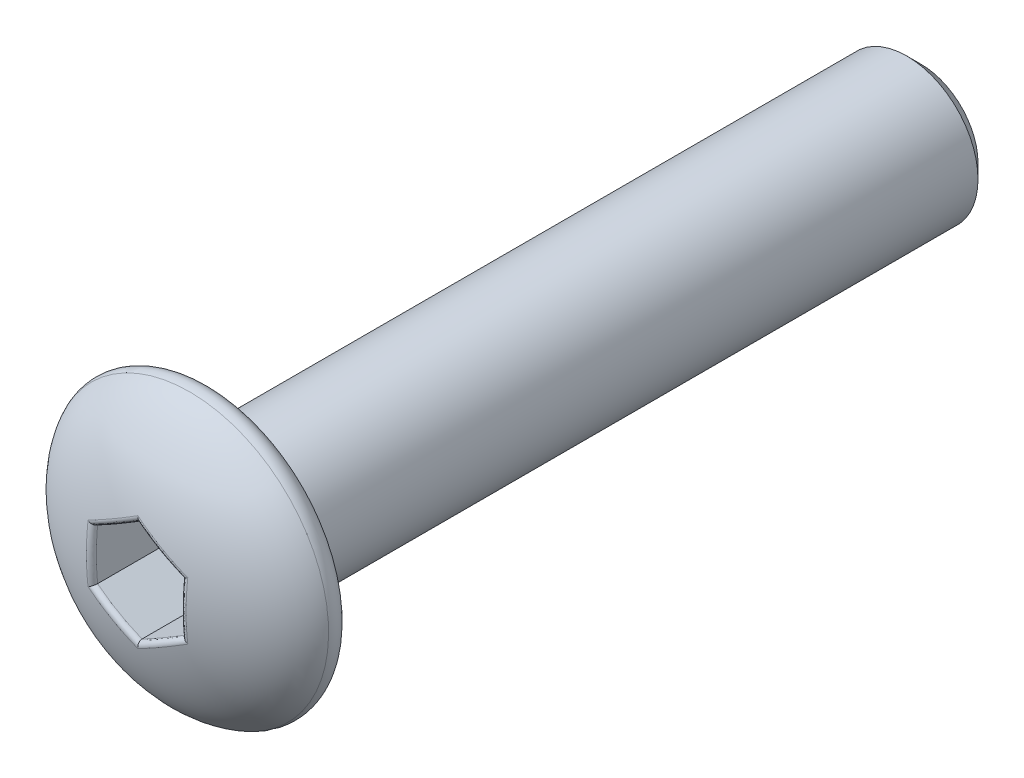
ISO-10303-21;
HEADER;
FILE_DESCRIPTION(('STEP AP214'),'2;1');
FILE_NAME('part.step','',(''),(''),'','','');
FILE_SCHEMA(('AUTOMOTIVE_DESIGN { 1 0 10303 214 1 1 1 1 }'));
ENDSEC;
DATA;
#1=APPLICATION_CONTEXT('core data for automotive mechanical design processes');
#2=APPLICATION_PROTOCOL_DEFINITION('international standard','automotive_design',2000,#1);
#3=PRODUCT_CONTEXT('',#1,'mechanical');
#4=PRODUCT('Part','Part','',(#3));
#5=PRODUCT_RELATED_PRODUCT_CATEGORY('part','',(#4));
#6=PRODUCT_DEFINITION_FORMATION('','',#4);
#7=PRODUCT_DEFINITION_CONTEXT('part definition',#1,'design');
#8=PRODUCT_DEFINITION('design','',#6,#7);
#9=PRODUCT_DEFINITION_SHAPE('','',#8);
#10=(LENGTH_UNIT() NAMED_UNIT(*) SI_UNIT(.MILLI.,.METRE.));
#11=(NAMED_UNIT(*) PLANE_ANGLE_UNIT() SI_UNIT($,.RADIAN.));
#12=(NAMED_UNIT(*) SI_UNIT($,.STERADIAN.) SOLID_ANGLE_UNIT());
#13=UNCERTAINTY_MEASURE_WITH_UNIT(LENGTH_MEASURE(1.E-05),#10,'distance_accuracy_value','');
#14=(GEOMETRIC_REPRESENTATION_CONTEXT(3) GLOBAL_UNCERTAINTY_ASSIGNED_CONTEXT((#13)) GLOBAL_UNIT_ASSIGNED_CONTEXT((#10,
#11,#12)) REPRESENTATION_CONTEXT('',''));
#15=CARTESIAN_POINT('',(0.,0.,0.));
#16=DIRECTION('',(0.,0.,1.));
#17=DIRECTION('',(1.,0.,0.));
#18=AXIS2_PLACEMENT_3D('',#15,#16,#17);
#19=CARTESIAN_POINT('',(0.,0.,0.));
#20=DIRECTION('',(0.,1.,0.));
#21=DIRECTION('',(-1.,0.,0.));
#22=AXIS2_PLACEMENT_3D('',#19,#20,#21);
#23=ELLIPSE('',#22,4.04703868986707,2.2098);
#24=TRIMMED_CURVE('',#23,(PARAMETER_VALUE(1.5707963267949)),(PARAMETER_VALUE(4.71238898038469)),
.T.,.PARAMETER.);
#25=CARTESIAN_POINT('',(0.,0.,0.));
#26=DIRECTION('',(0.,0.,-1.));
#27=AXIS1_PLACEMENT('',#25,#26);
#28=SURFACE_OF_REVOLUTION('',#24,#27);
#29=CARTESIAN_POINT('',(-1.25,-2.43109385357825,1.45482492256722));
#30=CARTESIAN_POINT('',(-1.25,-2.50008398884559,1.60075255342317));
#31=CARTESIAN_POINT('',(-1.40688229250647,-2.48385104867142,1.56641670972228));
#32=CARTESIAN_POINT('',(-1.25,-2.37004945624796,1.48367475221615));
#33=CARTESIAN_POINT('',(-1.25,-2.43645825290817,1.63035549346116));
#34=CARTESIAN_POINT('',(-1.4065673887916,-2.42092622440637,1.59623832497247));
#35=CARTESIAN_POINT('',(-1.25,-2.30828992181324,1.51096319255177));
#36=CARTESIAN_POINT('',(-1.25,-2.37213378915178,1.65835171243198));
#37=CARTESIAN_POINT('',(-1.40627570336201,-2.35735308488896,1.62440239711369));
#38=CARTESIAN_POINT('',(-1.25,-2.18358273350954,1.56261092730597));
#39=CARTESIAN_POINT('',(-1.25,-2.24253701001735,1.7112426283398));
#40=CARTESIAN_POINT('',(-1.40573337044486,-2.22913444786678,1.67764266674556));
#41=CARTESIAN_POINT('',(-1.25,-2.12063553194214,1.58697131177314));
#42=CARTESIAN_POINT('',(-1.25,-2.17724007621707,1.73615829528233));
#43=CARTESIAN_POINT('',(-1.40548270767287,-2.16448935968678,1.70272001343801));
#44=CARTESIAN_POINT('',(-1.25,-1.9304921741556,1.65591359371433));
#45=CARTESIAN_POINT('',(-1.25,-1.98058612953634,1.80648226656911));
#46=CARTESIAN_POINT('',(-1.40478452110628,-1.96940193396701,1.77362454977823));
#47=CARTESIAN_POINT('',(-1.25,-1.80181400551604,1.6964399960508));
#48=CARTESIAN_POINT('',(-1.25,-1.84768282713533,1.84780819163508));
#49=CARTESIAN_POINT('',(-1.40438990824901,-1.83762177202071,1.8152102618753));
#50=CARTESIAN_POINT('',(-1.25,-1.54246497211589,1.76761934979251));
#51=CARTESIAN_POINT('',(-1.25,-1.58052907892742,1.920217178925));
#52=CARTESIAN_POINT('',(-1.40371287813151,-1.57235611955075,1.88816590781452));
#53=CARTESIAN_POINT('',(-1.25,-1.41180649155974,1.79831833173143));
#54=CARTESIAN_POINT('',(-1.25,-1.44614874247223,1.95142125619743));
#55=CARTESIAN_POINT('',(-1.40342993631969,-1.43888171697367,1.91958347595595));
#56=CARTESIAN_POINT('',(-1.25,-1.14870906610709,1.8508929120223));
#57=CARTESIAN_POINT('',(-1.25,-1.17604312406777,2.00477103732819));
#58=CARTESIAN_POINT('',(-1.40295356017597,-1.17033709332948,1.97334884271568));
#59=CARTESIAN_POINT('',(-1.25,-1.01626972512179,1.87276651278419));
#60=CARTESIAN_POINT('',(-1.25,-1.04019972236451,2.02695995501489));
#61=CARTESIAN_POINT('',(-1.40276014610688,-1.03526651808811,1.99569458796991));
#62=CARTESIAN_POINT('',(-1.25,-0.73692017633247,1.90997817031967));
#63=CARTESIAN_POINT('',(-1.25,-0.754037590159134,2.06465882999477));
#64=CARTESIAN_POINT('',(-1.40243453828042,-0.750513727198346,2.03369365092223));
#65=CARTESIAN_POINT('',(-1.25,-0.589893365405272,1.92443843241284));
#66=CARTESIAN_POINT('',(-1.25,-0.603481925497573,2.07931018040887));
#67=CARTESIAN_POINT('',(-1.40231045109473,-0.600727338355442,2.04844863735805));
#68=CARTESIAN_POINT('',(-1.25,-0.295145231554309,1.94367598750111));
#69=CARTESIAN_POINT('',(-1.25,-0.301912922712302,2.09878409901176));
#70=CARTESIAN_POINT('',(-1.40214606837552,-0.30052620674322,2.06807515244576));
#71=CARTESIAN_POINT('',(-1.25,-0.147423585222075,1.9484482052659));
#72=CARTESIAN_POINT('',(-1.25,-0.150775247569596,2.10361749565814));
#73=CARTESIAN_POINT('',(-1.40210581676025,-0.150111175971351,2.07294150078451));
#74=CARTESIAN_POINT('',(-1.25,0.175253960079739,1.94844774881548));
#75=CARTESIAN_POINT('',(-1.25,0.179238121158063,2.10361375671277));
#76=CARTESIAN_POINT('',(-1.40210559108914,0.178448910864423,2.07294211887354));
#77=CARTESIAN_POINT('',(-1.25,0.350214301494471,1.94175500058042));
#78=CARTESIAN_POINT('',(-1.25,0.358277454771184,2.09683080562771));
#79=CARTESIAN_POINT('',(-1.40216176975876,0.356598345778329,2.06611864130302));
#80=CARTESIAN_POINT('',(-1.25,0.698926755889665,1.91463731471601));
#81=CARTESIAN_POINT('',(-1.25,0.715114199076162,2.06938935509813));
#82=CARTESIAN_POINT('',(-1.40239511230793,0.711802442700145,2.03844511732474));
#83=CARTESIAN_POINT('',(-1.25,0.872679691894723,1.89422290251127));
#84=CARTESIAN_POINT('',(-1.24999999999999,0.893124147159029,2.04870918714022));
#85=CARTESIAN_POINT('',(-1.40257218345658,0.888857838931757,2.01760582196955));
#86=CARTESIAN_POINT('',(-1.25,1.0453446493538,1.86676934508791));
#87=CARTESIAN_POINT('',(-1.24999999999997,1.06994054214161,2.02089102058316));
#88=CARTESIAN_POINT('',(-1.4028139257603,1.06494119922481,1.98956436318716));
#89=(BOUNDED_SURFACE() B_SPLINE_SURFACE(3,2,((#29,#30,#31),(#32,#33,#34),(#35,#36,#37),(#38,#39,
#40),(#41,#42,#43),(#44,#45,#46),(#47,#48,#49),(#50,#51,#52),(#53,#54,#55),(#56,#57,#58),(#59,
#60,#61),(#62,#63,#64),(#65,#66,#67),(#68,#69,#70),(#71,#72,#73),(#74,#75,#76),(#77,#78,#79),
(#80,#81,#82),(#83,#84,#85),(#86,#87,#88)),.UNSPECIFIED.,.F.,.F.,
.F.) B_SPLINE_SURFACE_WITH_KNOTS((4,2,2,2,2,2,2,2,2,4),(3,3),(0.,0.202499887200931,
0.40492415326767,0.809178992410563,1.2115116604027,1.61393534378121,2.05680421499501,
2.49990503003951,3.02462443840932,3.54894181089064),(0.,1.),
.UNSPECIFIED.) GEOMETRIC_REPRESENTATION_ITEM() RATIONAL_B_SPLINE_SURFACE(((1.,0.618347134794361,
1.),(1.,0.619349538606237,1.),(1.,0.620275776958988,1.),(1.,0.621994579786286,1.),(1.,
0.622787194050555,1.),(1.,0.624991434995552,1.),(1.,0.6262322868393,1.),(1.,0.6283568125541,1.),
(1.,0.629242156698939,1.),(1.,0.630730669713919,1.),(1.,0.631333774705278,1.),(1.,
0.632348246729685,1.),(1.,0.632734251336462,1.),(1.,0.633245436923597,1.),(1.,0.63337048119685,
1.),(1.,0.633371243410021,1.),(1.,0.633196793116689,1.),(1.,0.63247074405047,1.),(1.,
0.631919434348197,1.),(1.,0.631165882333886,1.))) REPRESENTATION_ITEM('') SURFACE());
#90=CARTESIAN_POINT('',(-1.40688229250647,-2.48385104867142,1.56641670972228));
#91=CARTESIAN_POINT('',(-1.4065673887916,-2.42092622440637,1.59623832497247));
#92=CARTESIAN_POINT('',(-1.40627570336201,-2.35735308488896,1.62440239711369));
#93=CARTESIAN_POINT('',(-1.40573337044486,-2.22913444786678,1.67764266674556));
#94=CARTESIAN_POINT('',(-1.40548270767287,-2.16448935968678,1.70272001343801));
#95=CARTESIAN_POINT('',(-1.40478452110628,-1.96940193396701,1.77362454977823));
#96=CARTESIAN_POINT('',(-1.40438990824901,-1.83762177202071,1.8152102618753));
#97=CARTESIAN_POINT('',(-1.40371287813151,-1.57235611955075,1.88816590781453));
#98=CARTESIAN_POINT('',(-1.40342993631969,-1.43888171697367,1.91958347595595));
#99=CARTESIAN_POINT('',(-1.40295356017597,-1.17033709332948,1.97334884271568));
#100=CARTESIAN_POINT('',(-1.40276014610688,-1.03526651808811,1.99569458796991));
#101=CARTESIAN_POINT('',(-1.40243453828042,-0.750513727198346,2.03369365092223));
#102=CARTESIAN_POINT('',(-1.40231045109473,-0.600727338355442,2.04844863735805));
#103=CARTESIAN_POINT('',(-1.40214606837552,-0.30052620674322,2.06807515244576));
#104=CARTESIAN_POINT('',(-1.40210581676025,-0.150111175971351,2.07294150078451));
#105=CARTESIAN_POINT('',(-1.40210559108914,0.178448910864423,2.07294211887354));
#106=CARTESIAN_POINT('',(-1.40216176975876,0.356598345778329,2.06611864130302));
#107=CARTESIAN_POINT('',(-1.40239511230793,0.711802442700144,2.03844511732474));
#108=CARTESIAN_POINT('',(-1.40257218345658,0.888857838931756,2.01760582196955));
#109=CARTESIAN_POINT('',(-1.4028139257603,1.06494119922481,1.98956436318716));
#110=B_SPLINE_CURVE_WITH_KNOTS('',3,(#90,#91,#92,#93,#94,#95,#96,#97,#98,#99,#100,#101,#102,
#103,#104,#105,#106,#107,#108,#109),.UNSPECIFIED.,.F.,.F.,(4,2,2,2,2,2,2,2,2,4),(0.,
0.202499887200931,0.40492415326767,0.809178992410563,1.2115116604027,1.61393534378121,
2.05680421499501,2.49990503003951,3.02462443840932,3.54894181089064),.UNSPECIFIED.);
#111=CARTESIAN_POINT('',(-1.40250796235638,-0.809738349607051,2.02515754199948));
#112=VERTEX_POINT('',#111);
#113=CARTESIAN_POINT('',(-1.40250796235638,0.809738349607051,2.02515754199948));
#114=VERTEX_POINT('',#113);
#115=EDGE_CURVE('E242',#112,#114,#110,.T.);
#116=ORIENTED_EDGE('',*,*,#115,.T.);
#117=CARTESIAN_POINT('',(-2.73038903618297,-0.133015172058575,1.45482492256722));
#118=CARTESIAN_POINT('',(-2.79013624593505,-0.167510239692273,1.60075255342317));
#119=CARTESIAN_POINT('',(-2.85451925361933,-0.0235297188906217,1.56641670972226));
#120=CARTESIAN_POINT('',(-2.67752303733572,-0.102492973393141,1.48367475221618));
#121=CARTESIAN_POINT('',(-2.73503474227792,-0.135697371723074,1.63035549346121));
#122=CARTESIAN_POINT('',(-2.79986730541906,0.00765997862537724,1.59623832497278));
#123=CARTESIAN_POINT('',(-2.6240377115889,-0.071613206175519,1.51096319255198));
#124=CARTESIAN_POINT('',(-2.6793281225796,-0.103535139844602,1.6583517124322));
#125=CARTESIAN_POINT('',(-2.74466550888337,0.0391939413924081,1.62440239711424));
#126=CARTESIAN_POINT('',(-2.51603811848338,-0.00925961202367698,1.56261092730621));
#127=CARTESIAN_POINT('',(-2.56709401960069,-0.0387367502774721,1.71124262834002));
#128=CARTESIAN_POINT('',(-2.63335374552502,0.102833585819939,1.67764266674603));
#129=CARTESIAN_POINT('',(-2.46152424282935,0.0222139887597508,1.58697131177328));
#130=CARTESIAN_POINT('',(-2.51054521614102,-0.00608828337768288,1.73615829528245));
#131=CARTESIAN_POINT('',(-2.57724412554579,0.134939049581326,1.70272001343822));
#132=CARTESIAN_POINT('',(-2.29685526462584,0.117285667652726,1.65591359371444));
#133=CARTESIAN_POINT('',(-2.34023790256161,0.0922386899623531,1.80648226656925));
#134=CARTESIAN_POINT('',(-2.40794436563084,0.231878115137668,1.7736245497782));
#135=CARTESIAN_POINT('',(-2.1854167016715,0.181624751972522,1.69643999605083));
#136=CARTESIAN_POINT('',(-2.22514026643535,0.158690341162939,1.84780819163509));
#137=CARTESIAN_POINT('',(-2.29362209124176,0.297426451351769,1.81521026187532));
#138=CARTESIAN_POINT('',(-1.96081385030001,0.311299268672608,1.76761934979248));
#139=CARTESIAN_POINT('',(-1.99377833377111,0.292267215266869,1.9202171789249));
#140=CARTESIAN_POINT('',(-2.06355678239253,0.429472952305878,1.88816590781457));
#141=CARTESIAN_POINT('',(-1.84766028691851,0.376628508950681,1.79831833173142));
#142=CARTESIAN_POINT('',(-1.87740154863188,0.359457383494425,1.95142125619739));
#143=CARTESIAN_POINT('',(-1.94782308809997,0.49596511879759,1.91958347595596));
#144=CARTESIAN_POINT('',(-1.61981123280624,0.508177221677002,1.85089291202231));
#145=CARTESIAN_POINT('',(-1.64348322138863,0.494510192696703,2.00477103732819));
#146=CARTESIAN_POINT('',(-1.71501843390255,0.629824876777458,1.97334884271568));
#147=CARTESIAN_POINT('',(-1.5051153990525,0.574396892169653,1.87276651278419));
#148=CARTESIAN_POINT('',(-1.52583938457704,0.562431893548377,2.02695995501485));
#149=CARTESIAN_POINT('',(-1.59794717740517,0.697192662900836,1.99569458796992));
#150=CARTESIAN_POINT('',(-1.26319159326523,0.714071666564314,1.90997817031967));
#151=CARTESIAN_POINT('',(-1.2780157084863,0.705512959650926,2.06465882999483));
#152=CARTESIAN_POINT('',(-1.35118122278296,0.839287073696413,2.03369365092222));
#153=CARTESIAN_POINT('',(-1.13586263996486,0.787585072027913,1.92443843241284));
#154=CARTESIAN_POINT('',(-1.14763067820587,0.780790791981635,2.07931018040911));
#155=CARTESIAN_POINT('',(-1.22140036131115,0.914072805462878,2.04844863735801));
#156=CARTESIAN_POINT('',(-0.880603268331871,0.934959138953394,1.94367598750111));
#157=CARTESIAN_POINT('',(-0.886464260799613,0.931575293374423,2.09878409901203));
#158=CARTESIAN_POINT('',(-0.961336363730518,1.0640310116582,2.06807515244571));
#159=CARTESIAN_POINT('',(-0.752672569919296,1.00881996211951,1.9484482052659));
#160=CARTESIAN_POINT('',(-0.7555751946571,1.00714413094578,2.10361749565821));
#161=CARTESIAN_POINT('',(-0.831053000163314,1.13920366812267,2.07294150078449));
#162=CARTESIAN_POINT('',(-0.473225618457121,1.17015873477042,1.94844774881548));
#163=CARTESIAN_POINT('',(-0.469775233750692,1.17215081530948,2.10361375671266));
#164=CARTESIAN_POINT('',(-0.546511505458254,1.30348351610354,2.07294211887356));
#165=CARTESIAN_POINT('',(-0.321705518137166,1.25763890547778,1.94175500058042));
#166=CARTESIAN_POINT('',(-0.314722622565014,1.26167048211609,2.09683080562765));
#167=CARTESIAN_POINT('',(-0.392257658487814,1.39260688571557,2.06611864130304));
#168=CARTESIAN_POINT('',(-0.0197116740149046,1.43199513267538,1.91463731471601));
#169=CARTESIAN_POINT('',(-0.00569293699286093,1.44008885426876,2.06938935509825));
#170=CARTESIAN_POINT('',(-0.084758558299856,1.57041101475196,2.03844511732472));
#171=CARTESIAN_POINT('',(0.130762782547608,1.51887160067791,1.89422290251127));
#172=CARTESIAN_POINT('',(0.148468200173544,1.52909382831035,2.04870918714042));
#173=CARTESIAN_POINT('',(0.0684873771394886,1.65909206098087,2.0176058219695));
#174=CARTESIAN_POINT('',(0.280295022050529,1.60520407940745,1.86676934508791));
#175=CARTESIAN_POINT('',(0.30159569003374,1.61750202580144,2.02089102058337));
#176=CARTESIAN_POINT('',(0.220859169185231,1.74734309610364,1.9895643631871));
#177=(BOUNDED_SURFACE() B_SPLINE_SURFACE(3,2,((#117,#118,#119),(#120,#121,#122),(#123,#124,
#125),(#126,#127,#128),(#129,#130,#131),(#132,#133,#134),(#135,#136,#137),(#138,#139,#140),
(#141,#142,#143),(#144,#145,#146),(#147,#148,#149),(#150,#151,#152),(#153,#154,#155),(#156,#157,
#158),(#159,#160,#161),(#162,#163,#164),(#165,#166,#167),(#168,#169,#170),(#171,#172,#173),
(#174,#175,#176)),.UNSPECIFIED.,.F.,.F.,.F.) B_SPLINE_SURFACE_WITH_KNOTS((4,2,2,2,2,2,2,2,2,4),
(3,3),(0.,0.202499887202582,0.40492415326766,0.809178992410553,1.21151166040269,1.6139353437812,
2.056804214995,2.49990503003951,3.02462443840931,3.54894181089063),(0.,1.),
.UNSPECIFIED.) GEOMETRIC_REPRESENTATION_ITEM() RATIONAL_B_SPLINE_SURFACE(((1.,0.618347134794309,
1.),(1.,0.619349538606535,1.),(1.,0.620275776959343,1.),(1.,0.621994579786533,1.),(1.,
0.622787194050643,1.),(1.,0.624991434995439,1.),(1.,0.626232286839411,1.),(1.,0.628356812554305,
1.),(1.,0.629242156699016,1.),(1.,0.630730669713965,1.),(1.,0.631333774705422,1.),(1.,
0.632348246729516,1.),(1.,0.63273425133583,1.),(1.,0.633245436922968,1.),(1.,0.633370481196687,
1.),(1.,0.633371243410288,1.),(1.,0.633196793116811,1.),(1.,0.632470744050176,1.),(1.,
0.631919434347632,1.),(1.,0.631165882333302,1.))) REPRESENTATION_ITEM('') SURFACE());
#178=CARTESIAN_POINT('',(-2.85451925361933,-0.0235297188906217,1.56641670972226));
#179=CARTESIAN_POINT('',(-2.79986730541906,0.00765997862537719,1.59623832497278));
#180=CARTESIAN_POINT('',(-2.74466550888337,0.039193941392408,1.62440239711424));
#181=CARTESIAN_POINT('',(-2.63335374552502,0.102833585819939,1.67764266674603));
#182=CARTESIAN_POINT('',(-2.57724412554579,0.134939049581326,1.70272001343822));
#183=CARTESIAN_POINT('',(-2.40794436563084,0.231878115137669,1.7736245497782));
#184=CARTESIAN_POINT('',(-2.29362209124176,0.297426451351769,1.81521026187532));
#185=CARTESIAN_POINT('',(-2.06355678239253,0.429472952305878,1.88816590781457));
#186=CARTESIAN_POINT('',(-1.94782308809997,0.49596511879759,1.91958347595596));
#187=CARTESIAN_POINT('',(-1.71501843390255,0.629824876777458,1.97334884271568));
#188=CARTESIAN_POINT('',(-1.59794717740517,0.697192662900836,1.99569458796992));
#189=CARTESIAN_POINT('',(-1.35118122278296,0.839287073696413,2.03369365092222));
#190=CARTESIAN_POINT('',(-1.22140036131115,0.914072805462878,2.04844863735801));
#191=CARTESIAN_POINT('',(-0.961336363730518,1.0640310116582,2.06807515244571));
#192=CARTESIAN_POINT('',(-0.831053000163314,1.13920366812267,2.07294150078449));
#193=CARTESIAN_POINT('',(-0.546511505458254,1.30348351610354,2.07294211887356));
#194=CARTESIAN_POINT('',(-0.392257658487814,1.39260688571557,2.06611864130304));
#195=CARTESIAN_POINT('',(-0.084758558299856,1.57041101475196,2.03844511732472));
#196=CARTESIAN_POINT('',(0.0684873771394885,1.65909206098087,2.0176058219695));
#197=CARTESIAN_POINT('',(0.220859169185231,1.74734309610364,1.9895643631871));
#198=B_SPLINE_CURVE_WITH_KNOTS('',3,(#178,#179,#180,#181,#182,#183,#184,#185,#186,#187,#188,
#189,#190,#191,#192,#193,#194,#195,#196,#197),.UNSPECIFIED.,.F.,.F.,(4,2,2,2,2,2,2,2,2,4),(0.,
0.202499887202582,0.40492415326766,0.809178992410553,1.21151166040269,1.6139353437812,
2.056804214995,2.49990503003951,3.02462443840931,3.54894181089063),.UNSPECIFIED.);
#199=CARTESIAN_POINT('',(0.,1.6194766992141,2.02515754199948));
#200=VERTEX_POINT('',#199);
#201=EDGE_CURVE('E173',#114,#200,#198,.T.);
#202=ORIENTED_EDGE('',*,*,#201,.T.);
#203=CARTESIAN_POINT('',(-1.48038903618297,2.29807868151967,1.45482492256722));
#204=CARTESIAN_POINT('',(-1.54013624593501,2.33257374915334,1.60075255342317));
#205=CARTESIAN_POINT('',(-1.44763696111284,2.4603213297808,1.56641670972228));
#206=CARTESIAN_POINT('',(-1.42752303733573,2.26755648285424,1.48367475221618));
#207=CARTESIAN_POINT('',(-1.48503474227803,2.30076088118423,1.6303554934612));
#208=CARTESIAN_POINT('',(-1.39329991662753,2.42858620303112,1.59623832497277));
#209=CARTESIAN_POINT('',(-1.37403771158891,2.23667671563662,1.51096319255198));
#210=CARTESIAN_POINT('',(-1.42932812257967,2.26859864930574,1.65835171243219));
#211=CARTESIAN_POINT('',(-1.33838980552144,2.39654702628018,1.62440239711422));
#212=CARTESIAN_POINT('',(-1.26603811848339,2.17432312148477,1.56261092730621));
#213=CARTESIAN_POINT('',(-1.31709401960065,2.20380025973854,1.71124262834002));
#214=CARTESIAN_POINT('',(-1.22762037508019,2.33196803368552,1.67764266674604));
#215=CARTESIAN_POINT('',(-1.21152424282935,2.14284952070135,1.58697131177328));
#216=CARTESIAN_POINT('',(-1.26054521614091,2.17115179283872,1.73615829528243));
#217=CARTESIAN_POINT('',(-1.17176141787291,2.29942840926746,1.70272001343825));
#218=CARTESIAN_POINT('',(-1.04685526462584,2.04777784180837,1.65591359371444));
#219=CARTESIAN_POINT('',(-1.09023790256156,2.07282481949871,1.80648226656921));
#220=CARTESIAN_POINT('',(-1.0031598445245,2.20128004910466,1.77362454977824));
#221=CARTESIAN_POINT('',(-0.9354167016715,1.98343875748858,1.69643999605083));
#222=CARTESIAN_POINT('',(-0.97514026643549,2.00637316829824,1.84780819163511));
#223=CARTESIAN_POINT('',(-0.889232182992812,2.1350482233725,1.8152102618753));
#224=CARTESIAN_POINT('',(-0.710813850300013,1.85376424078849,1.76761934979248));
#225=CARTESIAN_POINT('',(-0.743778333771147,1.87279629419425,1.92021717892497));
#226=CARTESIAN_POINT('',(-0.659843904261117,2.00182907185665,1.88816590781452));
#227=CARTESIAN_POINT('',(-0.597660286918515,1.78843500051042,1.79831833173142));
#228=CARTESIAN_POINT('',(-0.627401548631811,1.80560612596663,1.95142125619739));
#229=CARTESIAN_POINT('',(-0.544393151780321,1.93484683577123,1.91958347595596));
#230=CARTESIAN_POINT('',(-0.369811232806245,1.6568862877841,1.85089291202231));
#231=CARTESIAN_POINT('',(-0.393483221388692,1.67055331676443,2.00477103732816));
#232=CARTESIAN_POINT('',(-0.312064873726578,1.80016197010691,1.97334884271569));
#233=CARTESIAN_POINT('',(-0.255115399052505,1.59066661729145,1.87276651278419));
#234=CARTESIAN_POINT('',(-0.275839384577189,1.6026316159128,2.02695995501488));
#235=CARTESIAN_POINT('',(-0.19518703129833,1.73245918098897,1.99569458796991));
#236=CARTESIAN_POINT('',(-0.013191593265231,1.45099184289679,1.90997817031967));
#237=CARTESIAN_POINT('',(-0.0280157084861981,1.45955054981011,2.06465882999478));
#238=CARTESIAN_POINT('',(0.051253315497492,1.58980080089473,2.03369365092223));
#239=CARTESIAN_POINT('',(0.114137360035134,1.37747843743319,1.92443843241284));
#240=CARTESIAN_POINT('',(0.102369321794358,1.38427271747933,2.07931018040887));
#241=CARTESIAN_POINT('',(0.180910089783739,1.51480014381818,2.04844863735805));
#242=CARTESIAN_POINT('',(0.369396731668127,1.2301043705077,1.94367598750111));
#243=CARTESIAN_POINT('',(0.36353573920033,1.2334882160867,2.09878409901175));
#244=CARTESIAN_POINT('',(0.440809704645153,1.36455721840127,2.06807515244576));
#245=CARTESIAN_POINT('',(0.497327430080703,1.15624354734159,1.9484482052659));
#246=CARTESIAN_POINT('',(0.494424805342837,1.15791937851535,2.10361749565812));
#247=CARTESIAN_POINT('',(0.571052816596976,1.28931484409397,2.07294150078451));
#248=CARTESIAN_POINT('',(0.776774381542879,0.994904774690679,1.94844774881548));
#249=CARTESIAN_POINT('',(0.780224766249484,0.99291269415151,2.10361375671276));
#250=CARTESIAN_POINT('',(0.855594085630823,1.12503460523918,2.07294211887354));
#251=CARTESIAN_POINT('',(0.928294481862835,0.907424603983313,1.94175500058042));
#252=CARTESIAN_POINT('',(0.935277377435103,0.903393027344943,2.09683080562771));
#253=CARTESIAN_POINT('',(1.00990411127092,1.03600853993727,2.06611864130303));
#254=CARTESIAN_POINT('',(1.2302883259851,0.733068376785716,1.91463731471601));
#255=CARTESIAN_POINT('',(1.24430706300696,0.724974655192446,2.06938935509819));
#256=CARTESIAN_POINT('',(1.31763655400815,0.858608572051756,2.03844511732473));
#257=CARTESIAN_POINT('',(1.38076278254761,0.646191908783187,1.89422290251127));
#258=CARTESIAN_POINT('',(1.39846820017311,0.63596968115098,2.04870918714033));
#259=CARTESIAN_POINT('',(1.47105956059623,0.770234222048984,2.01760582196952));
#260=CARTESIAN_POINT('',(1.53029502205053,0.559859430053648,1.86676934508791));
#261=CARTESIAN_POINT('',(1.55159569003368,0.547561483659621,2.02089102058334));
#262=CARTESIAN_POINT('',(1.62367309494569,0.682401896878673,1.9895643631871));
#263=(BOUNDED_SURFACE() B_SPLINE_SURFACE(3,2,((#203,#204,#205),(#206,#207,#208),(#209,#210,
#211),(#212,#213,#214),(#215,#216,#217),(#218,#219,#220),(#221,#222,#223),(#224,#225,#226),
(#227,#228,#229),(#230,#231,#232),(#233,#234,#235),(#236,#237,#238),(#239,#240,#241),(#242,#243,
#244),(#245,#246,#247),(#248,#249,#250),(#251,#252,#253),(#254,#255,#256),(#257,#258,#259),
(#260,#261,#262)),.UNSPECIFIED.,.F.,.F.,.F.) B_SPLINE_SURFACE_WITH_KNOTS((4,2,2,2,2,2,2,2,2,4),
(3,3),(0.,0.202499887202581,0.404924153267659,0.809178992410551,1.21151166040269,
1.6139353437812,2.056804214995,2.49990503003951,3.02462443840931,3.54894181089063),(0.,1.),
.UNSPECIFIED.) GEOMETRIC_REPRESENTATION_ITEM() RATIONAL_B_SPLINE_SURFACE(((1.,0.618347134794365,
1.),(1.,0.619349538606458,1.),(1.,0.620275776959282,1.),(1.,0.621994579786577,1.),(1.,
0.622787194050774,1.),(1.,0.6249914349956,1.),(1.,0.626232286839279,1.),(1.,0.628356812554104,
1.),(1.,0.629242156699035,1.),(1.,0.630730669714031,1.),(1.,0.631333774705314,1.),(1.,
0.632348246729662,1.),(1.,0.632734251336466,1.),(1.,0.633245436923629,1.),(1.,0.633370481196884,
1.),(1.,0.633371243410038,1.),(1.,0.633196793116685,1.),(1.,0.632470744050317,1.),(1.,
0.631919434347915,1.),(1.,0.631165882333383,1.))) REPRESENTATION_ITEM('') SURFACE());
#264=CARTESIAN_POINT('',(-1.44763696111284,2.4603213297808,1.56641670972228));
#265=CARTESIAN_POINT('',(-1.39329991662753,2.42858620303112,1.59623832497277));
#266=CARTESIAN_POINT('',(-1.33838980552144,2.39654702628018,1.62440239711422));
#267=CARTESIAN_POINT('',(-1.22762037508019,2.33196803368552,1.67764266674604));
#268=CARTESIAN_POINT('',(-1.17176141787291,2.29942840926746,1.70272001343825));
#269=CARTESIAN_POINT('',(-1.0031598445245,2.20128004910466,1.77362454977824));
#270=CARTESIAN_POINT('',(-0.889232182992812,2.1350482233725,1.8152102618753));
#271=CARTESIAN_POINT('',(-0.659843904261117,2.00182907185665,1.88816590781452));
#272=CARTESIAN_POINT('',(-0.544393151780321,1.93484683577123,1.91958347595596));
#273=CARTESIAN_POINT('',(-0.312064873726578,1.80016197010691,1.97334884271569));
#274=CARTESIAN_POINT('',(-0.19518703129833,1.73245918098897,1.99569458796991));
#275=CARTESIAN_POINT('',(0.0512533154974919,1.58980080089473,2.03369365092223));
#276=CARTESIAN_POINT('',(0.180910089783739,1.51480014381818,2.04844863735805));
#277=CARTESIAN_POINT('',(0.440809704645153,1.36455721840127,2.06807515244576));
#278=CARTESIAN_POINT('',(0.571052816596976,1.28931484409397,2.07294150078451));
#279=CARTESIAN_POINT('',(0.855594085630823,1.12503460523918,2.07294211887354));
#280=CARTESIAN_POINT('',(1.00990411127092,1.03600853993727,2.06611864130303));
#281=CARTESIAN_POINT('',(1.31763655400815,0.858608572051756,2.03844511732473));
#282=CARTESIAN_POINT('',(1.47105956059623,0.770234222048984,2.01760582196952));
#283=CARTESIAN_POINT('',(1.62367309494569,0.682401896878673,1.9895643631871));
#284=B_SPLINE_CURVE_WITH_KNOTS('',3,(#264,#265,#266,#267,#268,#269,#270,#271,#272,#273,#274,
#275,#276,#277,#278,#279,#280,#281,#282,#283),.UNSPECIFIED.,.F.,.F.,(4,2,2,2,2,2,2,2,2,4),(0.,
0.202499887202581,0.404924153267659,0.809178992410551,1.21151166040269,1.6139353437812,
2.056804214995,2.49990503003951,3.02462443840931,3.54894181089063),.UNSPECIFIED.);
#285=CARTESIAN_POINT('',(1.40250796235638,0.809738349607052,2.02515754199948));
#286=VERTEX_POINT('',#285);
#287=EDGE_CURVE('E267',#200,#286,#284,.T.);
#288=ORIENTED_EDGE('',*,*,#287,.T.);
#289=CARTESIAN_POINT('',(1.25,2.43128553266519,1.45473429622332));
#290=CARTESIAN_POINT('',(1.25,2.50028410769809,1.60065941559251));
#291=CARTESIAN_POINT('',(1.40688328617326,2.48404864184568,1.56632302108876));
#292=CARTESIAN_POINT('',(1.25,2.37024853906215,1.48358464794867));
#293=CARTESIAN_POINT('',(1.25,2.43666574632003,1.63026301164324));
#294=CARTESIAN_POINT('',(1.40656836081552,2.42113125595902,1.59614527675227));
#295=CARTESIAN_POINT('',(1.25,2.30849638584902,1.51087378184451));
#296=CARTESIAN_POINT('',(1.25,2.37234864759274,1.65826004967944));
#297=CARTESIAN_POINT('',(1.40627665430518,2.35756553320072,1.62431015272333));
#298=CARTESIAN_POINT('',(1.25,2.18380391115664,1.56252322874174));
#299=CARTESIAN_POINT('',(1.25,2.24276655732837,1.71115290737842));
#300=CARTESIAN_POINT('',(1.4057342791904,2.22936168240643,1.67755234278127));
#301=CARTESIAN_POINT('',(1.25,2.1208640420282,1.58688463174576));
#302=CARTESIAN_POINT('',(1.25,2.17747695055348,1.73606969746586));
#303=CARTESIAN_POINT('',(1.40548359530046,2.16472396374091,1.70263080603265));
#304=CARTESIAN_POINT('',(1.25,1.93074260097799,1.65583042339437));
#305=CARTESIAN_POINT('',(1.25,1.9808449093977,1.80639745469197));
#306=CARTESIAN_POINT('',(1.40478534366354,1.96965856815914,1.77353913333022));
#307=CARTESIAN_POINT('',(1.25,1.80207894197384,1.69635977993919));
#308=CARTESIAN_POINT('',(1.25,1.84795614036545,1.84772649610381));
#309=CARTESIAN_POINT('',(1.4043906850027,1.83789299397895,1.81512797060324));
#310=CARTESIAN_POINT('',(1.25,1.54275881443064,1.76754614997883));
#311=CARTESIAN_POINT('',(1.25,1.58083137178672,1.92014278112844));
#312=CARTESIAN_POINT('',(1.40371356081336,1.57265642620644,1.88809095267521));
#313=CARTESIAN_POINT('',(1.25,1.41211473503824,1.79824920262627));
#314=CARTESIAN_POINT('',(1.25,1.44646550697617,1.95135105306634));
#315=CARTESIAN_POINT('',(1.40343057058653,1.43919652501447,1.91951274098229));
#316=CARTESIAN_POINT('',(1.25,1.14904584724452,1.85083312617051));
#317=CARTESIAN_POINT('',(1.25,1.17638860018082,2.00471040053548));
#318=CARTESIAN_POINT('',(1.40295409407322,1.17068066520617,1.97328774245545));
#319=CARTESIAN_POINT('',(1.25,1.01662064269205,1.87271199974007));
#320=CARTESIAN_POINT('',(1.25,1.04055945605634,2.02690469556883));
#321=CARTESIAN_POINT('',(1.40276062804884,1.03562435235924,1.99563890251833));
#322=CARTESIAN_POINT('',(1.25,0.737327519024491,1.90993243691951));
#323=CARTESIAN_POINT('',(1.25,0.754454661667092,2.06461251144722));
#324=CARTESIAN_POINT('',(1.40243493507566,0.750928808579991,2.03364696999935));
#325=CARTESIAN_POINT('',(1.25,0.590343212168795,1.92439819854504));
#326=CARTESIAN_POINT('',(1.25,0.603942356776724,2.07926944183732));
#327=CARTESIAN_POINT('',(1.40231079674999,0.601185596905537,2.04840758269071));
#328=CARTESIAN_POINT('',(1.25,0.29567967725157,1.94365193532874));
#329=CARTESIAN_POINT('',(1.25,0.302459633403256,2.09875975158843));
#330=CARTESIAN_POINT('',(1.40214627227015,0.301070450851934,2.06805062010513));
#331=CARTESIAN_POINT('',(1.25,0.148000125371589,1.948434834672));
#332=CARTESIAN_POINT('',(1.25,0.151364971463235,2.10360396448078));
#333=CARTESIAN_POINT('',(1.40210593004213,0.150698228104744,2.07292786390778));
#334=CARTESIAN_POINT('',(1.25,-0.174635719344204,1.94846358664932));
#335=CARTESIAN_POINT('',(1.25,-0.178605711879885,2.10362978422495));
#336=CARTESIAN_POINT('',(1.4021054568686,-0.177819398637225,2.07295827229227));
#337=CARTESIAN_POINT('',(1.25,-0.349596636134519,1.94178667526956));
#338=CARTESIAN_POINT('',(1.25,-0.357645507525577,2.09686287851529));
#339=CARTESIAN_POINT('',(1.40216150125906,-0.355969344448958,2.06615094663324));
#340=CARTESIAN_POINT('',(1.25,-0.698311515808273,1.91470126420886));
#341=CARTESIAN_POINT('',(1.25,-0.714484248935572,2.06945412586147));
#342=CARTESIAN_POINT('',(1.40239456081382,-0.711175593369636,2.03851038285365));
#343=CARTESIAN_POINT('',(1.25,-0.872066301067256,1.89430329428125));
#344=CARTESIAN_POINT('',(1.25,-0.89249570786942,2.04879065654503));
#345=CARTESIAN_POINT('',(1.40257148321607,-0.888232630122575,2.01768790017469));
#346=CARTESIAN_POINT('',(1.25,-1.04473383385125,1.86686679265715));
#347=CARTESIAN_POINT('',(1.24999999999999,-1.06931432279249,2.0209898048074));
#348=CARTESIAN_POINT('',(1.4028130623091,-1.06431827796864,1.98966392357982));
#349=(BOUNDED_SURFACE() B_SPLINE_SURFACE(3,2,((#289,#290,#291),(#292,#293,#294),(#295,#296,
#297),(#298,#299,#300),(#301,#302,#303),(#304,#305,#306),(#307,#308,#309),(#310,#311,#312),
(#313,#314,#315),(#316,#317,#318),(#319,#320,#321),(#322,#323,#324),(#325,#326,#327),(#328,#329,
#330),(#331,#332,#333),(#334,#335,#336),(#337,#338,#339),(#340,#341,#342),(#343,#344,#345),
(#346,#347,#348)),.UNSPECIFIED.,.F.,.F.,.F.) B_SPLINE_SURFACE_WITH_KNOTS((4,2,2,2,2,2,2,2,2,4),
(3,3),(0.,0.20248047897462,0.404885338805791,0.809101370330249,1.21139482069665,
1.61377927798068,2.05652313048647,2.49949901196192,3.02421835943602,3.54853548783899),(0.,1.),
.UNSPECIFIED.) GEOMETRIC_REPRESENTATION_ITEM() RATIONAL_B_SPLINE_SURFACE(((1.,0.618343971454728,
1.),(1.,0.61934644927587,1.),(1.,0.620272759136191,1.),(1.,0.621991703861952,1.),(1.,
0.622784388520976,1.),(1.,0.624988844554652,1.),(1.,0.626229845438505,1.),(1.,0.628354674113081,
1.),(1.,0.629240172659,1.),(1.,0.630729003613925,1.),(1.,0.631332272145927,1.),(1.,
0.632347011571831,1.),(1.,0.632733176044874,1.),(1.,0.633244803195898,1.),(1.,0.633370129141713,
1.),(1.,0.633371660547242,1.),(1.,0.633197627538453,1.),(1.,0.632472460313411,1.),(1.,
0.631921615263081,1.),(1.,0.631168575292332,1.))) REPRESENTATION_ITEM('') SURFACE());
#350=CARTESIAN_POINT('',(1.40688328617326,2.48404864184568,1.56632302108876));
#351=CARTESIAN_POINT('',(1.40656836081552,2.42113125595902,1.59614527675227));
#352=CARTESIAN_POINT('',(1.40627665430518,2.35756553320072,1.62431015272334));
#353=CARTESIAN_POINT('',(1.4057342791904,2.22936168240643,1.67755234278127));
#354=CARTESIAN_POINT('',(1.40548359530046,2.16472396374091,1.70263080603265));
#355=CARTESIAN_POINT('',(1.40478534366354,1.96965856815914,1.77353913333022));
#356=CARTESIAN_POINT('',(1.4043906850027,1.83789299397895,1.81512797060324));
#357=CARTESIAN_POINT('',(1.40371356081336,1.57265642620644,1.88809095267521));
#358=CARTESIAN_POINT('',(1.40343057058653,1.43919652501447,1.91951274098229));
#359=CARTESIAN_POINT('',(1.40295409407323,1.17068066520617,1.97328774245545));
#360=CARTESIAN_POINT('',(1.40276062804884,1.03562435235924,1.99563890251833));
#361=CARTESIAN_POINT('',(1.40243493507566,0.750928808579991,2.03364696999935));
#362=CARTESIAN_POINT('',(1.40231079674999,0.601185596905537,2.04840758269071));
#363=CARTESIAN_POINT('',(1.40214627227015,0.301070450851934,2.06805062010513));
#364=CARTESIAN_POINT('',(1.40210593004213,0.150698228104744,2.07292786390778));
#365=CARTESIAN_POINT('',(1.4021054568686,-0.177819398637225,2.07295827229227));
#366=CARTESIAN_POINT('',(1.40216150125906,-0.355969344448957,2.06615094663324));
#367=CARTESIAN_POINT('',(1.40239456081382,-0.711175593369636,2.03851038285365));
#368=CARTESIAN_POINT('',(1.40257148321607,-0.888232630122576,2.01768790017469));
#369=CARTESIAN_POINT('',(1.4028130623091,-1.06431827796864,1.98966392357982));
#370=B_SPLINE_CURVE_WITH_KNOTS('',3,(#350,#351,#352,#353,#354,#355,#356,#357,#358,#359,#360,
#361,#362,#363,#364,#365,#366,#367,#368,#369),.UNSPECIFIED.,.F.,.F.,(4,2,2,2,2,2,2,2,2,4),(0.,
0.20248047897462,0.404885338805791,0.809101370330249,1.21139482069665,1.61377927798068,
2.05652313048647,2.49949901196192,3.02421835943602,3.54853548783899),.UNSPECIFIED.);
#371=CARTESIAN_POINT('',(1.40250796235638,-0.80973834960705,2.02515754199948));
#372=VERTEX_POINT('',#371);
#373=EDGE_CURVE('E262',#286,#372,#370,.T.);
#374=ORIENTED_EDGE('',*,*,#373,.T.);
#375=CARTESIAN_POINT('',(2.73038903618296,0.133015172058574,1.45482492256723));
#376=CARTESIAN_POINT('',(2.79013624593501,0.167510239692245,1.60075255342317));
#377=CARTESIAN_POINT('',(2.8545192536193,0.0235297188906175,1.56641670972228));
#378=CARTESIAN_POINT('',(2.67752303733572,0.10249297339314,1.48367475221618));
#379=CARTESIAN_POINT('',(2.73503474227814,0.135697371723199,1.63035549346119));
#380=CARTESIAN_POINT('',(2.79986730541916,-0.0076599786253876,1.59623832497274));
#381=CARTESIAN_POINT('',(2.6240377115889,0.0716132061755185,1.51096319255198));
#382=CARTESIAN_POINT('',(2.67932812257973,0.103535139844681,1.65835171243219));
#383=CARTESIAN_POINT('',(2.74466550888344,-0.0391939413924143,1.62440239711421));
#384=CARTESIAN_POINT('',(2.51603811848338,0.00925961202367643,1.56261092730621));
#385=CARTESIAN_POINT('',(2.56709401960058,0.0387367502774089,1.71124262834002));
#386=CARTESIAN_POINT('',(2.63335374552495,-0.102833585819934,1.67764266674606));
#387=CARTESIAN_POINT('',(2.46152424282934,-0.0222139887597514,1.58697131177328));
#388=CARTESIAN_POINT('',(2.51054521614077,0.00608828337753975,1.73615829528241));
#389=CARTESIAN_POINT('',(2.57724412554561,-0.134939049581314,1.7027200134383));
#390=CARTESIAN_POINT('',(2.29685526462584,-0.117285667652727,1.65591359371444));
#391=CARTESIAN_POINT('',(2.34023790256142,-0.0922386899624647,1.80648226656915));
#392=CARTESIAN_POINT('',(2.40794436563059,-0.231878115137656,1.77362454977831));
#393=CARTESIAN_POINT('',(2.18541670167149,-0.181624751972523,1.69643999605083));
#394=CARTESIAN_POINT('',(2.22514026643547,-0.158690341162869,1.84780819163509));
#395=CARTESIAN_POINT('',(2.29362209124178,-0.297426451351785,1.81521026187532));
#396=CARTESIAN_POINT('',(1.9608138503,-0.311299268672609,1.76761934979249));
#397=CARTESIAN_POINT('',(1.99377833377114,-0.292267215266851,1.92021717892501));
#398=CARTESIAN_POINT('',(2.06355678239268,-0.429472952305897,1.8881659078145));
#399=CARTESIAN_POINT('',(1.84766028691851,-0.376628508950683,1.79831833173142));
#400=CARTESIAN_POINT('',(1.8774015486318,-0.359457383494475,1.95142125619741));
#401=CARTESIAN_POINT('',(1.9478230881,-0.495965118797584,1.91958347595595));
#402=CARTESIAN_POINT('',(1.61981123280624,-0.508177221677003,1.85089291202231));
#403=CARTESIAN_POINT('',(1.64348322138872,-0.494510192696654,2.00477103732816));
#404=CARTESIAN_POINT('',(1.7150184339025,-0.629824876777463,1.97334884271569));
#405=CARTESIAN_POINT('',(1.5051153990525,-0.574396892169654,1.87276651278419));
#406=CARTESIAN_POINT('',(1.52583938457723,-0.562431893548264,2.02695995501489));
#407=CARTESIAN_POINT('',(1.59794717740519,-0.697192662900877,1.99569458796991));
#408=CARTESIAN_POINT('',(1.26319159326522,-0.714071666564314,1.90997817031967));
#409=CARTESIAN_POINT('',(1.27801570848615,-0.705512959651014,2.06465882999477));
#410=CARTESIAN_POINT('',(1.35118122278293,-0.83928707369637,2.03369365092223));
#411=CARTESIAN_POINT('',(1.13586263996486,-0.787585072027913,1.92443843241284));
#412=CARTESIAN_POINT('',(1.14763067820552,-0.780790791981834,2.07931018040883));
#413=CARTESIAN_POINT('',(1.22140036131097,-0.914072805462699,2.04844863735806));
#414=CARTESIAN_POINT('',(0.880603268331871,-0.934959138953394,1.94367598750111));
#415=CARTESIAN_POINT('',(0.88646426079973,-0.931575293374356,2.09878409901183));
#416=CARTESIAN_POINT('',(0.961336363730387,-1.06403101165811,2.06807515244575));
#417=CARTESIAN_POINT('',(0.752672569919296,-1.00881996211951,1.9484482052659));
#418=CARTESIAN_POINT('',(0.755575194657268,-1.00714413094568,2.10361749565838));
#419=CARTESIAN_POINT('',(0.831053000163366,-1.13920366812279,2.07294150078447));
#420=CARTESIAN_POINT('',(0.473225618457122,-1.17015873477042,1.94844774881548));
#421=CARTESIAN_POINT('',(0.469775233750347,-1.17215081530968,2.10361375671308));
#422=CARTESIAN_POINT('',(0.546511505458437,-1.30348351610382,2.07294211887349));
#423=CARTESIAN_POINT('',(0.321705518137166,-1.25763890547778,1.94175500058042));
#424=CARTESIAN_POINT('',(0.314722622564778,-1.26167048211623,2.09683080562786));
#425=CARTESIAN_POINT('',(0.392257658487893,-1.39260688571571,2.066118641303));
#426=CARTESIAN_POINT('',(0.0197116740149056,-1.43199513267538,1.91463731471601));
#427=CARTESIAN_POINT('',(0.00569293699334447,-1.44008885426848,2.06938935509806));
#428=CARTESIAN_POINT('',(0.0847585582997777,-1.57041101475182,2.03844511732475));
#429=CARTESIAN_POINT('',(-0.130762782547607,-1.51887160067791,1.89422290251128));
#430=CARTESIAN_POINT('',(-0.148468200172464,-1.52909382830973,2.04870918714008));
#431=CARTESIAN_POINT('',(-0.0684873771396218,-1.65909206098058,2.01760582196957));
#432=CARTESIAN_POINT('',(-0.280295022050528,-1.60520407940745,1.86676934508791));
#433=CARTESIAN_POINT('',(-0.301595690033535,-1.61750202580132,2.02089102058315));
#434=CARTESIAN_POINT('',(-0.220859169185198,-1.7473430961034,1.98956436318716));
#435=(BOUNDED_SURFACE() B_SPLINE_SURFACE(3,2,((#375,#376,#377),(#378,#379,#380),(#381,#382,
#383),(#384,#385,#386),(#387,#388,#389),(#390,#391,#392),(#393,#394,#395),(#396,#397,#398),
(#399,#400,#401),(#402,#403,#404),(#405,#406,#407),(#408,#409,#410),(#411,#412,#413),(#414,#415,
#416),(#417,#418,#419),(#420,#421,#422),(#423,#424,#425),(#426,#427,#428),(#429,#430,#431),
(#432,#433,#434)),.UNSPECIFIED.,.F.,.F.,.F.) B_SPLINE_SURFACE_WITH_KNOTS((4,2,2,2,2,2,2,2,2,4),
(3,3),(0.,0.202499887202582,0.40492415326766,0.809178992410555,1.21151166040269,1.6139353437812,
2.056804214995,2.4999050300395,3.02462443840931,3.54894181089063),(0.,1.),
.UNSPECIFIED.) GEOMETRIC_REPRESENTATION_ITEM() RATIONAL_B_SPLINE_SURFACE(((1.,0.61834713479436,
1.),(1.,0.619349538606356,1.),(1.,0.620275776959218,1.),(1.,0.621994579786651,1.),(1.,
0.622787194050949,1.),(1.,0.62499143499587,1.),(1.,0.626232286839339,1.),(1.,0.628356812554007,
1.),(1.,0.629242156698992,1.),(1.,0.630730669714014,1.),(1.,0.63133377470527,1.),(1.,
0.632348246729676,1.),(1.,0.632734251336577,1.),(1.,0.633245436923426,1.),(1.,0.633370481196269,
1.),(1.,0.633371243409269,1.),(1.,0.633196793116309,1.),(1.,0.632470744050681,1.),(1.,
0.631919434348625,1.),(1.,0.631165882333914,1.))) REPRESENTATION_ITEM('') SURFACE());
#436=CARTESIAN_POINT('',(2.8545192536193,0.0235297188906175,1.56641670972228));
#437=CARTESIAN_POINT('',(2.79986730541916,-0.00765997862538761,1.59623832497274));
#438=CARTESIAN_POINT('',(2.74466550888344,-0.0391939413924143,1.62440239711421));
#439=CARTESIAN_POINT('',(2.63335374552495,-0.102833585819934,1.67764266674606));
#440=CARTESIAN_POINT('',(2.57724412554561,-0.134939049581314,1.7027200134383));
#441=CARTESIAN_POINT('',(2.40794436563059,-0.231878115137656,1.77362454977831));
#442=CARTESIAN_POINT('',(2.29362209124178,-0.297426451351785,1.81521026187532));
#443=CARTESIAN_POINT('',(2.06355678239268,-0.429472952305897,1.8881659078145));
#444=CARTESIAN_POINT('',(1.9478230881,-0.495965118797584,1.91958347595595));
#445=CARTESIAN_POINT('',(1.7150184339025,-0.629824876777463,1.97334884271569));
#446=CARTESIAN_POINT('',(1.59794717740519,-0.697192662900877,1.99569458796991));
#447=CARTESIAN_POINT('',(1.35118122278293,-0.83928707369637,2.03369365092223));
#448=CARTESIAN_POINT('',(1.22140036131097,-0.914072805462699,2.04844863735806));
#449=CARTESIAN_POINT('',(0.961336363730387,-1.06403101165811,2.06807515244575));
#450=CARTESIAN_POINT('',(0.831053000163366,-1.13920366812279,2.07294150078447));
#451=CARTESIAN_POINT('',(0.546511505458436,-1.30348351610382,2.07294211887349));
#452=CARTESIAN_POINT('',(0.392257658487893,-1.39260688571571,2.066118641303));
#453=CARTESIAN_POINT('',(0.0847585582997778,-1.57041101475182,2.03844511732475));
#454=CARTESIAN_POINT('',(-0.0684873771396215,-1.65909206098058,2.01760582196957));
#455=CARTESIAN_POINT('',(-0.220859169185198,-1.7473430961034,1.98956436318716));
#456=B_SPLINE_CURVE_WITH_KNOTS('',3,(#436,#437,#438,#439,#440,#441,#442,#443,#444,#445,#446,
#447,#448,#449,#450,#451,#452,#453,#454,#455),.UNSPECIFIED.,.F.,.F.,(4,2,2,2,2,2,2,2,2,4),(0.,
0.202499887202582,0.40492415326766,0.809178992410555,1.21151166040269,1.6139353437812,
2.056804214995,2.4999050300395,3.02462443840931,3.54894181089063),.UNSPECIFIED.);
#457=CARTESIAN_POINT('',(0.,-1.6194766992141,2.02515754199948));
#458=VERTEX_POINT('',#457);
#459=EDGE_CURVE('E256',#372,#458,#456,.T.);
#460=ORIENTED_EDGE('',*,*,#459,.T.);
#461=CARTESIAN_POINT('',(1.48038903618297,-2.29807868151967,1.45482492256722));
#462=CARTESIAN_POINT('',(1.54013624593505,-2.33257374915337,1.60075255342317));
#463=CARTESIAN_POINT('',(1.44763696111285,-2.46032132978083,1.56641670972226));
#464=CARTESIAN_POINT('',(1.42752303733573,-2.26755648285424,1.48367475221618));
#465=CARTESIAN_POINT('',(1.48503474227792,-2.30076088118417,1.63035549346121));
#466=CARTESIAN_POINT('',(1.39329991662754,-2.42858620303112,1.59623832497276));
#467=CARTESIAN_POINT('',(1.37403771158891,-2.23667671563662,1.51096319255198));
#468=CARTESIAN_POINT('',(1.42932812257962,-2.26859864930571,1.6583517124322));
#469=CARTESIAN_POINT('',(1.33838980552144,-2.39654702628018,1.62440239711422));
#470=CARTESIAN_POINT('',(1.26603811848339,-2.17432312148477,1.56261092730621));
#471=CARTESIAN_POINT('',(1.3170940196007,-2.20380025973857,1.71124262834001));
#472=CARTESIAN_POINT('',(1.22762037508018,-2.33196803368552,1.67764266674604));
#473=CARTESIAN_POINT('',(1.21152424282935,-2.14284952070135,1.58697131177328));
#474=CARTESIAN_POINT('',(1.26054521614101,-2.17115179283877,1.73615829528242));
#475=CARTESIAN_POINT('',(1.1717614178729,-2.29942840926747,1.70272001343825));
#476=CARTESIAN_POINT('',(1.04685526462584,-2.04777784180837,1.65591359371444));
#477=CARTESIAN_POINT('',(1.09023790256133,-2.07282481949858,1.8064822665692));
#478=CARTESIAN_POINT('',(1.00315984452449,-2.2012800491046,1.77362454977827));
#479=CARTESIAN_POINT('',(0.9354167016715,-1.98343875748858,1.69643999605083));
#480=CARTESIAN_POINT('',(0.97514026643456,-2.0063731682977,1.84780819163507));
#481=CARTESIAN_POINT('',(0.889232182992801,-2.13504822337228,1.81521026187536));
#482=CARTESIAN_POINT('',(0.710813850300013,-1.85376424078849,1.76761934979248));
#483=CARTESIAN_POINT('',(0.743778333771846,-1.87279629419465,1.92021717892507));
#484=CARTESIAN_POINT('',(0.659843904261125,-2.00182907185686,1.88816590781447));
#485=CARTESIAN_POINT('',(0.597660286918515,-1.78843500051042,1.79831833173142));
#486=CARTESIAN_POINT('',(0.627401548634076,-1.80560612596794,1.95142125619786));
#487=CARTESIAN_POINT('',(0.544393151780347,-1.93484683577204,1.91958347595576));
#488=CARTESIAN_POINT('',(0.369811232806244,-1.6568862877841,1.85089291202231));
#489=CARTESIAN_POINT('',(0.393483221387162,-1.67055331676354,2.0047710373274));
#490=CARTESIAN_POINT('',(0.312064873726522,-1.80016197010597,1.97334884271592));
#491=CARTESIAN_POINT('',(0.255115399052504,-1.59066661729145,1.87276651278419));
#492=CARTESIAN_POINT('',(0.275839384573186,-1.60263161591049,2.02695995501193));
#493=CARTESIAN_POINT('',(0.195187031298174,-1.73245918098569,1.99569458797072));
#494=CARTESIAN_POINT('',(0.0131915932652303,-1.45099184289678,1.90997817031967));
#495=CARTESIAN_POINT('',(0.0280157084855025,-1.45955054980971,2.06465882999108));
#496=CARTESIAN_POINT('',(-0.0512533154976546,-1.58980080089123,2.03369365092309));
#497=CARTESIAN_POINT('',(-0.114137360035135,-1.37747843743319,1.92443843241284));
#498=CARTESIAN_POINT('',(-0.10236932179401,-1.38427271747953,2.07931018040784));
#499=CARTESIAN_POINT('',(-0.180910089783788,-1.51480014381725,2.04844863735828));
#500=CARTESIAN_POINT('',(-0.369396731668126,-1.2301043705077,1.94367598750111));
#501=CARTESIAN_POINT('',(-0.363535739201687,-1.23348821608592,2.09878409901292));
#502=CARTESIAN_POINT('',(-0.440809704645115,-1.36455721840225,2.06807515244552));
#503=CARTESIAN_POINT('',(-0.497327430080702,-1.15624354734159,1.9484482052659));
#504=CARTESIAN_POINT('',(-0.494424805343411,-1.15791937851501,2.10361749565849));
#505=CARTESIAN_POINT('',(-0.571052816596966,-1.28931484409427,2.07294150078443));
#506=CARTESIAN_POINT('',(-0.776774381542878,-0.994904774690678,1.94844774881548));
#507=CARTESIAN_POINT('',(-0.780224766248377,-0.992912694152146,2.10361375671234));
#508=CARTESIAN_POINT('',(-0.855594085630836,-1.12503460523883,2.07294211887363));
#509=CARTESIAN_POINT('',(-0.928294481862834,-0.907424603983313,1.94175500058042));
#510=CARTESIAN_POINT('',(-0.935277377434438,-0.903393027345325,2.09683080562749));
#511=CARTESIAN_POINT('',(-1.00990411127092,-1.03600853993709,2.06611864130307));
#512=CARTESIAN_POINT('',(-1.23028832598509,-0.733068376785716,1.91463731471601));
#513=CARTESIAN_POINT('',(-1.24430706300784,-0.724974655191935,2.06938935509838));
#514=CARTESIAN_POINT('',(-1.31763655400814,-0.858608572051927,2.03844511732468));
#515=CARTESIAN_POINT('',(-1.38076278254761,-0.646191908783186,1.89422290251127));
#516=CARTESIAN_POINT('',(-1.39846820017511,-0.635969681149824,2.04870918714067));
#517=CARTESIAN_POINT('',(-1.47105956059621,-0.770234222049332,2.01760582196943));
#518=CARTESIAN_POINT('',(-1.53029502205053,-0.559859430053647,1.86676934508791));
#519=CARTESIAN_POINT('',(-1.55159569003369,-0.547561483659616,2.02089102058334));
#520=CARTESIAN_POINT('',(-1.6236730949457,-0.682401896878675,1.9895643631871));
#521=(BOUNDED_SURFACE() B_SPLINE_SURFACE(3,2,((#461,#462,#463),(#464,#465,#466),(#467,#468,
#469),(#470,#471,#472),(#473,#474,#475),(#476,#477,#478),(#479,#480,#481),(#482,#483,#484),
(#485,#486,#487),(#488,#489,#490),(#491,#492,#493),(#494,#495,#496),(#497,#498,#499),(#500,#501,
#502),(#503,#504,#505),(#506,#507,#508),(#509,#510,#511),(#512,#513,#514),(#515,#516,#517),
(#518,#519,#520)),.UNSPECIFIED.,.F.,.F.,.F.) B_SPLINE_SURFACE_WITH_KNOTS((4,2,2,2,2,2,2,2,2,4),
(3,3),(0.,0.20249988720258,0.404924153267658,0.809178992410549,1.21151166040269,1.6139353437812,
2.056804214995,2.49990503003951,3.02462443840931,3.54894181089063),(0.,1.),
.UNSPECIFIED.) GEOMETRIC_REPRESENTATION_ITEM() RATIONAL_B_SPLINE_SURFACE(((1.,0.618347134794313,
1.),(1.,0.619349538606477,1.),(1.,0.620275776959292,1.),(1.,0.621994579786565,1.),(1.,
0.622787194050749,1.),(1.,0.624991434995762,1.),(1.,0.62623228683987,1.),(1.,0.628356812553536,
1.),(1.,0.629242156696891,1.),(1.,0.630730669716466,1.),(1.,0.631333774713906,1.),(1.,
0.632348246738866,1.),(1.,0.632734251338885,1.),(1.,0.633245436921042,1.),(1.,0.633370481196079,
1.),(1.,0.633371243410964,1.),(1.,0.633196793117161,1.),(1.,0.632470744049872,1.),(1.,
0.631919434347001,1.),(1.,0.631165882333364,1.))) REPRESENTATION_ITEM('') SURFACE());
#522=CARTESIAN_POINT('',(1.44763696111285,-2.46032132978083,1.56641670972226));
#523=CARTESIAN_POINT('',(1.39329991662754,-2.42858620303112,1.59623832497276));
#524=CARTESIAN_POINT('',(1.33838980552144,-2.39654702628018,1.62440239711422));
#525=CARTESIAN_POINT('',(1.22762037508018,-2.33196803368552,1.67764266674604));
#526=CARTESIAN_POINT('',(1.1717614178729,-2.29942840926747,1.70272001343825));
#527=CARTESIAN_POINT('',(1.00315984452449,-2.20128004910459,1.77362454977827));
#528=CARTESIAN_POINT('',(0.889232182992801,-2.13504822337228,1.81521026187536));
#529=CARTESIAN_POINT('',(0.659843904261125,-2.00182907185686,1.88816590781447));
#530=CARTESIAN_POINT('',(0.544393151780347,-1.93484683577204,1.91958347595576));
#531=CARTESIAN_POINT('',(0.312064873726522,-1.80016197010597,1.97334884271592));
#532=CARTESIAN_POINT('',(0.195187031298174,-1.73245918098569,1.99569458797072));
#533=CARTESIAN_POINT('',(-0.0512533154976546,-1.58980080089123,2.03369365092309));
#534=CARTESIAN_POINT('',(-0.180910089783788,-1.51480014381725,2.04844863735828));
#535=CARTESIAN_POINT('',(-0.440809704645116,-1.36455721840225,2.06807515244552));
#536=CARTESIAN_POINT('',(-0.571052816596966,-1.28931484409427,2.07294150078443));
#537=CARTESIAN_POINT('',(-0.855594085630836,-1.12503460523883,2.07294211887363));
#538=CARTESIAN_POINT('',(-1.00990411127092,-1.03600853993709,2.06611864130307));
#539=CARTESIAN_POINT('',(-1.31763655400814,-0.858608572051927,2.03844511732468));
#540=CARTESIAN_POINT('',(-1.47105956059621,-0.770234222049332,2.01760582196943));
#541=CARTESIAN_POINT('',(-1.6236730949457,-0.682401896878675,1.9895643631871));
#542=B_SPLINE_CURVE_WITH_KNOTS('',3,(#522,#523,#524,#525,#526,#527,#528,#529,#530,#531,#532,
#533,#534,#535,#536,#537,#538,#539,#540,#541),.UNSPECIFIED.,.F.,.F.,(4,2,2,2,2,2,2,2,2,4),(0.,
0.20249988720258,0.404924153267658,0.809178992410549,1.21151166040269,1.6139353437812,
2.056804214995,2.49990503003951,3.02462443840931,3.54894181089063),.UNSPECIFIED.);
#543=EDGE_CURVE('E250',#458,#112,#542,.T.);
#544=ORIENTED_EDGE('',*,*,#543,.T.);
#545=EDGE_LOOP('',(#116,#202,#288,#374,#460,#544));
#546=FACE_BOUND('',#545,.T.);
#547=CARTESIAN_POINT('',(0.,0.,0.571633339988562));
#548=DIRECTION('',(0.,0.,-1.));
#549=DIRECTION('',(-1.,0.,0.));
#550=AXIS2_PLACEMENT_3D('',#547,#548,#549);
#551=CIRCLE('',#550,3.90928881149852);
#552=CARTESIAN_POINT('',(-3.90928881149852,0.,0.571633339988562));
#553=VERTEX_POINT('',#552);
#554=EDGE_CURVE('E121',#553,#553,#551,.T.);
#555=ORIENTED_EDGE('',*,*,#554,.F.);
#556=EDGE_LOOP('',(#555));
#557=FACE_BOUND('',#556,.T.);
#558=ADVANCED_FACE('F38',(#546,#557),#28,.T.);
#559=CARTESIAN_POINT('',(0.,0.,0.396875));
#560=DIRECTION('',(0.,0.,-1.));
#561=DIRECTION('',(-1.,0.,0.));
#562=AXIS2_PLACEMENT_3D('',#559,#560,#561);
#563=TOROIDAL_SURFACE('',#562,3.55296131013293,0.396875);
#564=ORIENTED_EDGE('',*,*,#554,.T.);
#565=EDGE_LOOP('',(#564));
#566=FACE_BOUND('',#565,.T.);
#567=CARTESIAN_POINT('',(0.,0.,0.));
#568=DIRECTION('',(0.,0.,-1.));
#569=DIRECTION('',(-1.,0.,0.));
#570=AXIS2_PLACEMENT_3D('',#567,#568,#569);
#571=CIRCLE('',#570,3.55296131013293);
#572=CARTESIAN_POINT('',(-3.55296131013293,0.,0.));
#573=VERTEX_POINT('',#572);
#574=EDGE_CURVE('E374',#573,#573,#571,.T.);
#575=ORIENTED_EDGE('',*,*,#574,.F.);
#576=EDGE_LOOP('',(#575));
#577=FACE_BOUND('',#576,.T.);
#578=ADVANCED_FACE('F165',(#566,#577),#563,.T.);
#579=CARTESIAN_POINT('',(3.55296131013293,0.,0.));
#580=DIRECTION('',(0.,0.,1.));
#581=DIRECTION('',(1.,0.,0.));
#582=AXIS2_PLACEMENT_3D('',#579,#580,#581);
#583=PLANE('',#582);
#584=CARTESIAN_POINT('',(0.,0.,0.));
#585=DIRECTION('',(0.,0.,-1.));
#586=DIRECTION('',(-1.,0.,0.));
#587=AXIS2_PLACEMENT_3D('',#584,#585,#586);
#588=CIRCLE('',#587,2.);
#589=CARTESIAN_POINT('',(-2.,0.,0.));
#590=VERTEX_POINT('',#589);
#591=EDGE_CURVE('E373',#590,#590,#588,.T.);
#592=ORIENTED_EDGE('',*,*,#591,.F.);
#593=EDGE_LOOP('',(#592));
#594=FACE_BOUND('',#593,.T.);
#595=ORIENTED_EDGE('',*,*,#574,.T.);
#596=EDGE_LOOP('',(#595));
#597=FACE_BOUND('',#596,.T.);
#598=ADVANCED_FACE('F358',(#594,#597),#583,.F.);
#599=CARTESIAN_POINT('',(0.,0.,0.));
#600=DIRECTION('',(0.,0.,-1.));
#601=DIRECTION('',(-1.,0.,0.));
#602=AXIS2_PLACEMENT_3D('',#599,#600,#601);
#603=CYLINDRICAL_SURFACE('',#602,2.);
#604=CARTESIAN_POINT('',(0.,0.,-19.603125));
#605=DIRECTION('',(0.,0.,1.));
#606=DIRECTION('',(1.,0.,0.));
#607=AXIS2_PLACEMENT_3D('',#604,#605,#606);
#608=CIRCLE('',#607,2.);
#609=CARTESIAN_POINT('',(2.,0.,-19.603125));
#610=VERTEX_POINT('',#609);
#611=EDGE_CURVE('E343',#610,#610,#608,.T.);
#612=ORIENTED_EDGE('',*,*,#611,.T.);
#613=EDGE_LOOP('',(#612));
#614=FACE_BOUND('',#613,.T.);
#615=ORIENTED_EDGE('',*,*,#591,.T.);
#616=EDGE_LOOP('',(#615));
#617=FACE_BOUND('',#616,.T.);
#618=ADVANCED_FACE('F361',(#614,#617),#603,.T.);
#619=CARTESIAN_POINT('',(2.,0.,-20.));
#620=DIRECTION('',(0.,0.,1.));
#621=DIRECTION('',(1.,0.,0.));
#622=AXIS2_PLACEMENT_3D('',#619,#620,#621);
#623=PLANE('',#622);
#624=CARTESIAN_POINT('',(0.,0.,-20.));
#625=DIRECTION('',(0.,0.,1.));
#626=DIRECTION('',(1.,0.,0.));
#627=AXIS2_PLACEMENT_3D('',#624,#625,#626);
#628=CIRCLE('',#627,1.60312499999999);
#629=CARTESIAN_POINT('',(1.60312499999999,0.,-20.));
#630=VERTEX_POINT('',#629);
#631=EDGE_CURVE('E345',#630,#630,#628,.F.);
#632=ORIENTED_EDGE('',*,*,#631,.T.);
#633=EDGE_LOOP('',(#632));
#634=FACE_BOUND('',#633,.T.);
#635=ADVANCED_FACE('F168',(#634),#623,.F.);
#636=CARTESIAN_POINT('',(0.,0.,-20.));
#637=DIRECTION('',(0.,0.,1.));
#638=DIRECTION('',(1.,0.,0.));
#639=AXIS2_PLACEMENT_3D('',#636,#637,#638);
#640=CONICAL_SURFACE('',#639,1.60312499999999,0.785398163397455);
#641=CARTESIAN_POINT('',(2.,0.,-19.603125));
#642=CARTESIAN_POINT('',(1.99586588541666,0.,-19.6072591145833));
#643=CARTESIAN_POINT('',(1.99173177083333,0.,-19.6113932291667));
#644=CARTESIAN_POINT('',(1.98346354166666,0.,-19.6196614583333));
#645=CARTESIAN_POINT('',(1.97932942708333,0.,-19.6237955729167));
#646=CARTESIAN_POINT('',(1.97106119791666,0.,-19.6320638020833));
#647=CARTESIAN_POINT('',(1.96692708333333,0.,-19.6361979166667));
#648=CARTESIAN_POINT('',(1.95865885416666,0.,-19.6444661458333));
#649=CARTESIAN_POINT('',(1.95452473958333,0.,-19.6486002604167));
#650=CARTESIAN_POINT('',(1.94625651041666,0.,-19.6568684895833));
#651=CARTESIAN_POINT('',(1.94212239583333,0.,-19.6610026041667));
#652=CARTESIAN_POINT('',(1.93385416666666,0.,-19.6692708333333));
#653=CARTESIAN_POINT('',(1.92972005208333,0.,-19.6734049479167));
#654=CARTESIAN_POINT('',(1.92145182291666,0.,-19.6816731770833));
#655=CARTESIAN_POINT('',(1.91731770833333,0.,-19.6858072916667));
#656=CARTESIAN_POINT('',(1.90904947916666,0.,-19.6940755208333));
#657=CARTESIAN_POINT('',(1.90491536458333,0.,-19.6982096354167));
#658=CARTESIAN_POINT('',(1.89664713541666,0.,-19.7064778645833));
#659=CARTESIAN_POINT('',(1.89251302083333,0.,-19.7106119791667));
#660=CARTESIAN_POINT('',(1.88424479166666,0.,-19.7188802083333));
#661=CARTESIAN_POINT('',(1.88011067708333,0.,-19.7230143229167));
#662=CARTESIAN_POINT('',(1.87184244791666,0.,-19.7312825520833));
#663=CARTESIAN_POINT('',(1.86770833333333,0.,-19.7354166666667));
#664=CARTESIAN_POINT('',(1.85944010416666,0.,-19.7436848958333));
#665=CARTESIAN_POINT('',(1.85530598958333,0.,-19.7478190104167));
#666=CARTESIAN_POINT('',(1.84703776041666,0.,-19.7560872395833));
#667=CARTESIAN_POINT('',(1.84290364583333,0.,-19.7602213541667));
#668=CARTESIAN_POINT('',(1.83463541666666,0.,-19.7684895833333));
#669=CARTESIAN_POINT('',(1.83050130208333,0.,-19.7726236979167));
#670=CARTESIAN_POINT('',(1.82223307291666,0.,-19.7808919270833));
#671=CARTESIAN_POINT('',(1.81809895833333,0.,-19.7850260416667));
#672=CARTESIAN_POINT('',(1.80983072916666,0.,-19.7932942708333));
#673=CARTESIAN_POINT('',(1.80569661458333,0.,-19.7974283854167));
#674=CARTESIAN_POINT('',(1.79742838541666,0.,-19.8056966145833));
#675=CARTESIAN_POINT('',(1.79329427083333,0.,-19.8098307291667));
#676=CARTESIAN_POINT('',(1.78502604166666,0.,-19.8180989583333));
#677=CARTESIAN_POINT('',(1.78089192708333,0.,-19.8222330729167));
#678=CARTESIAN_POINT('',(1.77262369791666,0.,-19.8305013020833));
#679=CARTESIAN_POINT('',(1.76848958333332,0.,-19.8346354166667));
#680=CARTESIAN_POINT('',(1.76022135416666,0.,-19.8429036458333));
#681=CARTESIAN_POINT('',(1.75608723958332,0.,-19.8470377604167));
#682=CARTESIAN_POINT('',(1.74781901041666,0.,-19.8553059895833));
#683=CARTESIAN_POINT('',(1.74368489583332,0.,-19.8594401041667));
#684=CARTESIAN_POINT('',(1.73541666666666,0.,-19.8677083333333));
#685=CARTESIAN_POINT('',(1.73128255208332,0.,-19.8718424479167));
#686=CARTESIAN_POINT('',(1.72301432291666,0.,-19.8801106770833));
#687=CARTESIAN_POINT('',(1.71888020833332,0.,-19.8842447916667));
#688=CARTESIAN_POINT('',(1.71061197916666,0.,-19.8925130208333));
#689=CARTESIAN_POINT('',(1.70647786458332,0.,-19.8966471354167));
#690=CARTESIAN_POINT('',(1.69820963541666,0.,-19.9049153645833));
#691=CARTESIAN_POINT('',(1.69407552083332,0.,-19.9090494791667));
#692=CARTESIAN_POINT('',(1.68580729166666,0.,-19.9173177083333));
#693=CARTESIAN_POINT('',(1.68167317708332,0.,-19.9214518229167));
#694=CARTESIAN_POINT('',(1.67340494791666,0.,-19.9297200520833));
#695=CARTESIAN_POINT('',(1.66927083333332,0.,-19.9338541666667));
#696=CARTESIAN_POINT('',(1.66100260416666,0.,-19.9421223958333));
#697=CARTESIAN_POINT('',(1.65686848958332,0.,-19.9462565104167));
#698=CARTESIAN_POINT('',(1.64860026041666,0.,-19.9545247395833));
#699=CARTESIAN_POINT('',(1.64446614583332,0.,-19.9586588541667));
#700=CARTESIAN_POINT('',(1.63619791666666,0.,-19.9669270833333));
#701=CARTESIAN_POINT('',(1.63206380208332,0.,-19.9710611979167));
#702=CARTESIAN_POINT('',(1.62379557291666,0.,-19.9793294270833));
#703=CARTESIAN_POINT('',(1.61966145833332,0.,-19.9834635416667));
#704=CARTESIAN_POINT('',(1.61139322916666,0.,-19.9917317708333));
#705=CARTESIAN_POINT('',(1.60725911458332,0.,-19.9958658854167));
#706=CARTESIAN_POINT('',(1.60312499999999,0.,-20.));
#707=B_SPLINE_CURVE_WITH_KNOTS('',3,(#641,#642,#643,#644,#645,#646,#647,#648,#649,#650,#651,
#652,#653,#654,#655,#656,#657,#658,#659,#660,#661,#662,#663,#664,#665,#666,#667,#668,#669,#670,
#671,#672,#673,#674,#675,#676,#677,#678,#679,#680,#681,#682,#683,#684,#685,#686,#687,#688,#689,
#690,#691,#692,#693,#694,#695,#696,#697,#698,#699,#700,#701,#702,#703,#704,#705,#706),
.UNSPECIFIED.,.F.,.F.,(4,2,2,2,2,2,2,2,2,2,2,2,2,2,2,2,2,2,2,2,2,2,2,2,2,2,2,2,2,2,2,2,4),(0.,
0.0175395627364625,0.035079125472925,0.0526186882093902,0.0701582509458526,0.0876978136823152,
0.10523737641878,0.122776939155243,0.140316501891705,0.15785606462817,0.175395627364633,
0.192935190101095,0.21047475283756,0.228014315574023,0.245553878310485,0.26309344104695,
0.280633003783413,0.298172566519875,0.31571212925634,0.333251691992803,0.350791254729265,
0.36833081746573,0.385870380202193,0.403409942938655,0.42094950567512,0.438489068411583,
0.456028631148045,0.47356819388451,0.491107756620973,0.508647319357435,0.5261868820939,
0.543726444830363,0.561266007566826),.UNSPECIFIED.);
#708=EDGE_CURVE('BSEAM167',#610,#630,#707,.T.);
#709=ORIENTED_EDGE('',*,*,#611,.F.);
#710=ORIENTED_EDGE('',*,*,#631,.F.);
#711=ORIENTED_EDGE('',*,*,#708,.T.);
#712=ORIENTED_EDGE('',*,*,#708,.F.);
#713=EDGE_LOOP('',(#709,#711,#710,#712));
#714=FACE_BOUND('',#713,.T.);
#715=ADVANCED_FACE('F167',(#714),#640,.T.);
#716=CARTESIAN_POINT('',(0.,1.44337567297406,25.4));
#717=DIRECTION('',(0.5,-0.866025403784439,0.));
#718=DIRECTION('',(0.866025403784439,0.5,0.));
#719=AXIS2_PLACEMENT_3D('',#716,#717,#718);
#720=PLANE('',#719);
#721=DIRECTION('',(0.,0.,-1.));
#722=VECTOR('',#721,1.);
#723=CARTESIAN_POINT('',(0.,1.44337567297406,25.4));
#724=LINE('',#723,#722);
#725=CARTESIAN_POINT('',(0.,1.44337567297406,1.90994049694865));
#726=VERTEX_POINT('',#725);
#727=CARTESIAN_POINT('',(0.,1.44337567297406,0.));
#728=VERTEX_POINT('',#727);
#729=EDGE_CURVE('E148',#726,#728,#724,.T.);
#730=ORIENTED_EDGE('',*,*,#729,.F.);
#731=CARTESIAN_POINT('',(0.280295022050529,1.60520407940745,1.86676934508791));
#732=CARTESIAN_POINT('',(0.130762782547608,1.51887160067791,1.89422290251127));
#733=CARTESIAN_POINT('',(-0.0197116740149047,1.43199513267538,1.91463731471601));
#734=CARTESIAN_POINT('',(-0.321705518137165,1.25763890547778,1.94175500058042));
#735=CARTESIAN_POINT('',(-0.473225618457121,1.17015873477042,1.94844774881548));
#736=CARTESIAN_POINT('',(-0.752672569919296,1.00881996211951,1.9484482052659));
#737=CARTESIAN_POINT('',(-0.880603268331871,0.934959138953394,1.94367598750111));
#738=CARTESIAN_POINT('',(-1.13586263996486,0.787585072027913,1.92443843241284));
#739=CARTESIAN_POINT('',(-1.26319159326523,0.714071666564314,1.90997817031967));
#740=CARTESIAN_POINT('',(-1.5051153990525,0.574396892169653,1.87276651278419));
#741=CARTESIAN_POINT('',(-1.61981123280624,0.508177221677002,1.85089291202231));
#742=CARTESIAN_POINT('',(-1.84766028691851,0.376628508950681,1.79831833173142));
#743=CARTESIAN_POINT('',(-1.96081385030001,0.311299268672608,1.76761934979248));
#744=CARTESIAN_POINT('',(-2.1854167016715,0.181624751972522,1.69643999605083));
#745=CARTESIAN_POINT('',(-2.29685526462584,0.117285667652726,1.65591359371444));
#746=CARTESIAN_POINT('',(-2.46152424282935,0.0222139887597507,1.58697131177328));
#747=CARTESIAN_POINT('',(-2.51603811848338,-0.00925961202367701,1.56261092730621));
#748=CARTESIAN_POINT('',(-2.6240377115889,-0.071613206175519,1.51096319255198));
#749=CARTESIAN_POINT('',(-2.67752303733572,-0.102492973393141,1.48367475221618));
#750=CARTESIAN_POINT('',(-2.73038903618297,-0.133015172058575,1.45482492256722));
#751=B_SPLINE_CURVE_WITH_KNOTS('',3,(#731,#732,#733,#734,#735,#736,#737,#738,#739,#740,#741,
#742,#743,#744,#745,#746,#747,#748,#749,#750),.UNSPECIFIED.,.F.,.F.,(4,2,2,2,2,2,2,2,2,4),(0.,
0.524317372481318,1.04903678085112,1.49213759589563,1.93500646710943,2.33743015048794,
2.73976281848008,3.14401765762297,3.34644192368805,3.54894181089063),.UNSPECIFIED.);
#752=CARTESIAN_POINT('',(-1.25,0.721687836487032,1.90994049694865));
#753=VERTEX_POINT('',#752);
#754=EDGE_CURVE('E119',#726,#753,#751,.T.);
#755=ORIENTED_EDGE('',*,*,#754,.T.);
#756=DIRECTION('',(0.,0.,-1.));
#757=VECTOR('',#756,1.);
#758=CARTESIAN_POINT('',(-1.25,0.721687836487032,25.4));
#759=LINE('',#758,#757);
#760=CARTESIAN_POINT('',(-1.25,0.721687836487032,0.));
#761=VERTEX_POINT('',#760);
#762=EDGE_CURVE('E112',#753,#761,#759,.T.);
#763=ORIENTED_EDGE('',*,*,#762,.T.);
#764=DIRECTION('',(-0.866025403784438,-0.5,0.));
#765=VECTOR('',#764,1.);
#766=CARTESIAN_POINT('',(0.,1.44337567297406,0.));
#767=LINE('',#766,#765);
#768=EDGE_CURVE('E116',#728,#761,#767,.T.);
#769=ORIENTED_EDGE('',*,*,#768,.F.);
#770=EDGE_LOOP('',(#730,#755,#763,#769));
#771=FACE_BOUND('',#770,.T.);
#772=ADVANCED_FACE('F115',(#771),#720,.T.);
#773=CARTESIAN_POINT('',(-1.25,0.721687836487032,25.4));
#774=DIRECTION('',(1.,0.,0.));
#775=DIRECTION('',(0.,1.,0.));
#776=AXIS2_PLACEMENT_3D('',#773,#774,#775);
#777=PLANE('',#776);
#778=ORIENTED_EDGE('',*,*,#762,.F.);
#779=CARTESIAN_POINT('',(-1.25,1.0453446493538,1.86676934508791));
#780=CARTESIAN_POINT('',(-1.25,0.872679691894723,1.89422290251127));
#781=CARTESIAN_POINT('',(-1.25,0.698926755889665,1.91463731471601));
#782=CARTESIAN_POINT('',(-1.25,0.350214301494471,1.94175500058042));
#783=CARTESIAN_POINT('',(-1.25,0.175253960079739,1.94844774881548));
#784=CARTESIAN_POINT('',(-1.25,-0.147423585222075,1.9484482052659));
#785=CARTESIAN_POINT('',(-1.25,-0.295145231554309,1.94367598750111));
#786=CARTESIAN_POINT('',(-1.25,-0.589893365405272,1.92443843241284));
#787=CARTESIAN_POINT('',(-1.25,-0.73692017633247,1.90997817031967));
#788=CARTESIAN_POINT('',(-1.25,-1.01626972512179,1.87276651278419));
#789=CARTESIAN_POINT('',(-1.25,-1.14870906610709,1.8508929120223));
#790=CARTESIAN_POINT('',(-1.25,-1.41180649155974,1.79831833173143));
#791=CARTESIAN_POINT('',(-1.25,-1.54246497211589,1.76761934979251));
#792=CARTESIAN_POINT('',(-1.25,-1.80181400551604,1.6964399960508));
#793=CARTESIAN_POINT('',(-1.25,-1.9304921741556,1.65591359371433));
#794=CARTESIAN_POINT('',(-1.25,-2.12063553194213,1.58697131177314));
#795=CARTESIAN_POINT('',(-1.25,-2.18358273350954,1.56261092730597));
#796=CARTESIAN_POINT('',(-1.25,-2.30828992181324,1.51096319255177));
#797=CARTESIAN_POINT('',(-1.25,-2.37004945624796,1.48367475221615));
#798=CARTESIAN_POINT('',(-1.25,-2.43109385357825,1.45482492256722));
#799=B_SPLINE_CURVE_WITH_KNOTS('',3,(#779,#780,#781,#782,#783,#784,#785,#786,#787,#788,#789,
#790,#791,#792,#793,#794,#795,#796,#797,#798),.UNSPECIFIED.,.F.,.F.,(4,2,2,2,2,2,2,2,2,4),(0.,
0.524317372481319,1.04903678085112,1.49213759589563,1.93500646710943,2.33743015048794,
2.73976281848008,3.14401765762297,3.34644192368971,3.54894181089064),.UNSPECIFIED.);
#800=CARTESIAN_POINT('',(-1.25,-0.721687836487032,1.90994049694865));
#801=VERTEX_POINT('',#800);
#802=EDGE_CURVE('E11',#753,#801,#799,.T.);
#803=ORIENTED_EDGE('',*,*,#802,.T.);
#804=DIRECTION('',(0.,0.,-1.));
#805=VECTOR('',#804,1.);
#806=CARTESIAN_POINT('',(-1.25,-0.721687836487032,25.4));
#807=LINE('',#806,#805);
#808=CARTESIAN_POINT('',(-1.25,-0.721687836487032,0.));
#809=VERTEX_POINT('',#808);
#810=EDGE_CURVE('E122',#801,#809,#807,.T.);
#811=ORIENTED_EDGE('',*,*,#810,.T.);
#812=DIRECTION('',(0.,-1.,0.));
#813=VECTOR('',#812,1.);
#814=CARTESIAN_POINT('',(-1.25,0.721687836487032,0.));
#815=LINE('',#814,#813);
#816=EDGE_CURVE('E128',#761,#809,#815,.T.);
#817=ORIENTED_EDGE('',*,*,#816,.F.);
#818=EDGE_LOOP('',(#778,#803,#811,#817));
#819=FACE_BOUND('',#818,.T.);
#820=ADVANCED_FACE('F135',(#819),#777,.T.);
#821=CARTESIAN_POINT('',(-1.25,-0.721687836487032,25.4));
#822=DIRECTION('',(0.5,0.866025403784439,0.));
#823=DIRECTION('',(-0.866025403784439,0.5,0.));
#824=AXIS2_PLACEMENT_3D('',#821,#822,#823);
#825=PLANE('',#824);
#826=ORIENTED_EDGE('',*,*,#810,.F.);
#827=CARTESIAN_POINT('',(-1.53029502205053,-0.559859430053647,1.86676934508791));
#828=CARTESIAN_POINT('',(-1.38076278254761,-0.646191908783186,1.89422290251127));
#829=CARTESIAN_POINT('',(-1.23028832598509,-0.733068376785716,1.91463731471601));
#830=CARTESIAN_POINT('',(-0.928294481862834,-0.907424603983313,1.94175500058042));
#831=CARTESIAN_POINT('',(-0.776774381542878,-0.994904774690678,1.94844774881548));
#832=CARTESIAN_POINT('',(-0.497327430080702,-1.15624354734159,1.9484482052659));
#833=CARTESIAN_POINT('',(-0.369396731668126,-1.2301043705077,1.94367598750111));
#834=CARTESIAN_POINT('',(-0.114137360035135,-1.37747843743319,1.92443843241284));
#835=CARTESIAN_POINT('',(0.0131915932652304,-1.45099184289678,1.90997817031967));
#836=CARTESIAN_POINT('',(0.255115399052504,-1.59066661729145,1.87276651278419));
#837=CARTESIAN_POINT('',(0.369811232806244,-1.6568862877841,1.85089291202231));
#838=CARTESIAN_POINT('',(0.597660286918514,-1.78843500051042,1.79831833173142));
#839=CARTESIAN_POINT('',(0.710813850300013,-1.85376424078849,1.76761934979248));
#840=CARTESIAN_POINT('',(0.9354167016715,-1.98343875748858,1.69643999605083));
#841=CARTESIAN_POINT('',(1.04685526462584,-2.04777784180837,1.65591359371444));
#842=CARTESIAN_POINT('',(1.21152424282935,-2.14284952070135,1.58697131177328));
#843=CARTESIAN_POINT('',(1.26603811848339,-2.17432312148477,1.56261092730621));
#844=CARTESIAN_POINT('',(1.37403771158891,-2.23667671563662,1.51096319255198));
#845=CARTESIAN_POINT('',(1.42752303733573,-2.26755648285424,1.48367475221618));
#846=CARTESIAN_POINT('',(1.48038903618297,-2.29807868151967,1.45482492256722));
#847=B_SPLINE_CURVE_WITH_KNOTS('',3,(#827,#828,#829,#830,#831,#832,#833,#834,#835,#836,#837,
#838,#839,#840,#841,#842,#843,#844,#845,#846),.UNSPECIFIED.,.F.,.F.,(4,2,2,2,2,2,2,2,2,4),(0.,
0.524317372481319,1.04903678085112,1.49213759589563,1.93500646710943,2.33743015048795,
2.73976281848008,3.14401765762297,3.34644192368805,3.54894181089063),.UNSPECIFIED.);
#848=CARTESIAN_POINT('',(0.,-1.44337567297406,1.90994049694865));
#849=VERTEX_POINT('',#848);
#850=EDGE_CURVE('E51',#801,#849,#847,.T.);
#851=ORIENTED_EDGE('',*,*,#850,.T.);
#852=DIRECTION('',(0.,0.,-1.));
#853=VECTOR('',#852,1.);
#854=CARTESIAN_POINT('',(0.,-1.44337567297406,25.4));
#855=LINE('',#854,#853);
#856=CARTESIAN_POINT('',(0.,-1.44337567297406,0.));
#857=VERTEX_POINT('',#856);
#858=EDGE_CURVE('E154',#849,#857,#855,.T.);
#859=ORIENTED_EDGE('',*,*,#858,.T.);
#860=DIRECTION('',(0.866025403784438,-0.5,0.));
#861=VECTOR('',#860,1.);
#862=CARTESIAN_POINT('',(-1.25,-0.721687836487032,0.));
#863=LINE('',#862,#861);
#864=EDGE_CURVE('E136',#809,#857,#863,.T.);
#865=ORIENTED_EDGE('',*,*,#864,.F.);
#866=EDGE_LOOP('',(#826,#851,#859,#865));
#867=FACE_BOUND('',#866,.T.);
#868=ADVANCED_FACE('F305',(#867),#825,.T.);
#869=CARTESIAN_POINT('',(0.,-1.44337567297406,25.4));
#870=DIRECTION('',(-0.5,0.866025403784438,0.));
#871=DIRECTION('',(-0.866025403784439,-0.5,0.));
#872=AXIS2_PLACEMENT_3D('',#869,#870,#871);
#873=PLANE('',#872);
#874=ORIENTED_EDGE('',*,*,#858,.F.);
#875=CARTESIAN_POINT('',(-0.280295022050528,-1.60520407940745,1.86676934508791));
#876=CARTESIAN_POINT('',(-0.130762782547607,-1.51887160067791,1.89422290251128));
#877=CARTESIAN_POINT('',(0.0197116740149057,-1.43199513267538,1.91463731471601));
#878=CARTESIAN_POINT('',(0.321705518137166,-1.25763890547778,1.94175500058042));
#879=CARTESIAN_POINT('',(0.473225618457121,-1.17015873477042,1.94844774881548));
#880=CARTESIAN_POINT('',(0.752672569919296,-1.00881996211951,1.9484482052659));
#881=CARTESIAN_POINT('',(0.880603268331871,-0.934959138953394,1.94367598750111));
#882=CARTESIAN_POINT('',(1.13586263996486,-0.787585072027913,1.92443843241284));
#883=CARTESIAN_POINT('',(1.26319159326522,-0.714071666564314,1.90997817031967));
#884=CARTESIAN_POINT('',(1.5051153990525,-0.574396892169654,1.87276651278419));
#885=CARTESIAN_POINT('',(1.61981123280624,-0.508177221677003,1.85089291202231));
#886=CARTESIAN_POINT('',(1.84766028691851,-0.376628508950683,1.79831833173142));
#887=CARTESIAN_POINT('',(1.9608138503,-0.311299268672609,1.76761934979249));
#888=CARTESIAN_POINT('',(2.18541670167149,-0.181624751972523,1.69643999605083));
#889=CARTESIAN_POINT('',(2.29685526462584,-0.117285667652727,1.65591359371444));
#890=CARTESIAN_POINT('',(2.46152424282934,-0.0222139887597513,1.58697131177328));
#891=CARTESIAN_POINT('',(2.51603811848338,0.00925961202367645,1.56261092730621));
#892=CARTESIAN_POINT('',(2.6240377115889,0.0716132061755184,1.51096319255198));
#893=CARTESIAN_POINT('',(2.67752303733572,0.10249297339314,1.48367475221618));
#894=CARTESIAN_POINT('',(2.73038903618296,0.133015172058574,1.45482492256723));
#895=B_SPLINE_CURVE_WITH_KNOTS('',3,(#875,#876,#877,#878,#879,#880,#881,#882,#883,#884,#885,
#886,#887,#888,#889,#890,#891,#892,#893,#894),.UNSPECIFIED.,.F.,.F.,(4,2,2,2,2,2,2,2,2,4),(0.,
0.524317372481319,1.04903678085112,1.49213759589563,1.93500646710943,2.33743015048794,
2.73976281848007,3.14401765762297,3.34644192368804,3.54894181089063),.UNSPECIFIED.);
#896=CARTESIAN_POINT('',(1.25,-0.721687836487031,1.90994049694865));
#897=VERTEX_POINT('',#896);
#898=EDGE_CURVE('E309',#849,#897,#895,.T.);
#899=ORIENTED_EDGE('',*,*,#898,.T.);
#900=DIRECTION('',(0.,0.,-1.));
#901=VECTOR('',#900,1.);
#902=CARTESIAN_POINT('',(1.25,-0.721687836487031,25.4));
#903=LINE('',#902,#901);
#904=CARTESIAN_POINT('',(1.25,-0.721687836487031,0.));
#905=VERTEX_POINT('',#904);
#906=EDGE_CURVE('E152',#897,#905,#903,.T.);
#907=ORIENTED_EDGE('',*,*,#906,.T.);
#908=DIRECTION('',(0.866025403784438,0.5,0.));
#909=VECTOR('',#908,1.);
#910=CARTESIAN_POINT('',(0.,-1.44337567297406,0.));
#911=LINE('',#910,#909);
#912=EDGE_CURVE('E138',#857,#905,#911,.T.);
#913=ORIENTED_EDGE('',*,*,#912,.F.);
#914=EDGE_LOOP('',(#874,#899,#907,#913));
#915=FACE_BOUND('',#914,.T.);
#916=ADVANCED_FACE('F300',(#915),#873,.T.);
#917=CARTESIAN_POINT('',(1.25,0.721687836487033,25.4));
#918=DIRECTION('',(1.,0.,0.));
#919=DIRECTION('',(0.,1.,0.));
#920=AXIS2_PLACEMENT_3D('',#917,#918,#919);
#921=PLANE('',#920);
#922=ORIENTED_EDGE('',*,*,#906,.F.);
#923=CARTESIAN_POINT('',(1.25,-1.04473383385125,1.86686679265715));
#924=CARTESIAN_POINT('',(1.25,-0.872066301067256,1.89430329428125));
#925=CARTESIAN_POINT('',(1.25,-0.698311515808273,1.91470126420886));
#926=CARTESIAN_POINT('',(1.25,-0.349596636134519,1.94178667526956));
#927=CARTESIAN_POINT('',(1.25,-0.174635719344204,1.94846358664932));
#928=CARTESIAN_POINT('',(1.25,0.148000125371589,1.948434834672));
#929=CARTESIAN_POINT('',(1.25,0.29567967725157,1.94365193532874));
#930=CARTESIAN_POINT('',(1.25,0.590343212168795,1.92439819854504));
#931=CARTESIAN_POINT('',(1.25,0.737327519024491,1.90993243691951));
#932=CARTESIAN_POINT('',(1.25,1.01662064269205,1.87271199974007));
#933=CARTESIAN_POINT('',(1.25,1.14904584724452,1.85083312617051));
#934=CARTESIAN_POINT('',(1.25,1.41211473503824,1.79824920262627));
#935=CARTESIAN_POINT('',(1.25,1.54275881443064,1.76754614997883));
#936=CARTESIAN_POINT('',(1.25,1.80207894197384,1.69635977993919));
#937=CARTESIAN_POINT('',(1.25,1.93074260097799,1.65583042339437));
#938=CARTESIAN_POINT('',(1.25,2.1208640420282,1.58688463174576));
#939=CARTESIAN_POINT('',(1.25,2.18380391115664,1.56252322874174));
#940=CARTESIAN_POINT('',(1.25,2.30849638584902,1.51087378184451));
#941=CARTESIAN_POINT('',(1.25,2.37024853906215,1.48358464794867));
#942=CARTESIAN_POINT('',(1.25,2.43128553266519,1.45473429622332));
#943=B_SPLINE_CURVE_WITH_KNOTS('',3,(#923,#924,#925,#926,#927,#928,#929,#930,#931,#932,#933,
#934,#935,#936,#937,#938,#939,#940,#941,#942),.UNSPECIFIED.,.F.,.F.,(4,2,2,2,2,2,2,2,2,4),(0.,
0.524317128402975,1.04903647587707,1.49201235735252,1.93475620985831,2.33714066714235,
2.73943411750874,3.1436501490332,3.34605500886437,3.54853548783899),.UNSPECIFIED.);
#944=CARTESIAN_POINT('',(1.25,0.721687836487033,1.90994049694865));
#945=VERTEX_POINT('',#944);
#946=EDGE_CURVE('E286',#897,#945,#943,.T.);
#947=ORIENTED_EDGE('',*,*,#946,.T.);
#948=DIRECTION('',(0.,0.,-1.));
#949=VECTOR('',#948,1.);
#950=CARTESIAN_POINT('',(1.25,0.721687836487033,25.4));
#951=LINE('',#950,#949);
#952=CARTESIAN_POINT('',(1.25,0.721687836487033,0.));
#953=VERTEX_POINT('',#952);
#954=EDGE_CURVE('E150',#945,#953,#951,.T.);
#955=ORIENTED_EDGE('',*,*,#954,.T.);
#956=DIRECTION('',(0.,-1.,0.));
#957=VECTOR('',#956,1.);
#958=CARTESIAN_POINT('',(1.25,0.721687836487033,0.));
#959=LINE('',#958,#957);
#960=EDGE_CURVE('E144',#953,#905,#959,.T.);
#961=ORIENTED_EDGE('',*,*,#960,.T.);
#962=EDGE_LOOP('',(#922,#947,#955,#961));
#963=FACE_BOUND('',#962,.T.);
#964=ADVANCED_FACE('F294',(#963),#921,.F.);
#965=CARTESIAN_POINT('',(1.25,0.721687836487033,25.4));
#966=DIRECTION('',(-0.5,-0.866025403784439,0.));
#967=DIRECTION('',(0.866025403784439,-0.5,0.));
#968=AXIS2_PLACEMENT_3D('',#965,#966,#967);
#969=PLANE('',#968);
#970=ORIENTED_EDGE('',*,*,#954,.F.);
#971=CARTESIAN_POINT('',(1.53029502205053,0.559859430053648,1.86676934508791));
#972=CARTESIAN_POINT('',(1.38076278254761,0.646191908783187,1.89422290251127));
#973=CARTESIAN_POINT('',(1.2302883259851,0.733068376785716,1.91463731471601));
#974=CARTESIAN_POINT('',(0.928294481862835,0.907424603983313,1.94175500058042));
#975=CARTESIAN_POINT('',(0.776774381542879,0.994904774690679,1.94844774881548));
#976=CARTESIAN_POINT('',(0.497327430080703,1.15624354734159,1.9484482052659));
#977=CARTESIAN_POINT('',(0.369396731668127,1.2301043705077,1.94367598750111));
#978=CARTESIAN_POINT('',(0.114137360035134,1.37747843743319,1.92443843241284));
#979=CARTESIAN_POINT('',(-0.0131915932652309,1.45099184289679,1.90997817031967));
#980=CARTESIAN_POINT('',(-0.255115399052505,1.59066661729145,1.87276651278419));
#981=CARTESIAN_POINT('',(-0.369811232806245,1.6568862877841,1.85089291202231));
#982=CARTESIAN_POINT('',(-0.597660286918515,1.78843500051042,1.79831833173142));
#983=CARTESIAN_POINT('',(-0.710813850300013,1.85376424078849,1.76761934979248));
#984=CARTESIAN_POINT('',(-0.9354167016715,1.98343875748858,1.69643999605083));
#985=CARTESIAN_POINT('',(-1.04685526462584,2.04777784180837,1.65591359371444));
#986=CARTESIAN_POINT('',(-1.21152424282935,2.14284952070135,1.58697131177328));
#987=CARTESIAN_POINT('',(-1.26603811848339,2.17432312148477,1.56261092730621));
#988=CARTESIAN_POINT('',(-1.37403771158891,2.23667671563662,1.51096319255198));
#989=CARTESIAN_POINT('',(-1.42752303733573,2.26755648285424,1.48367475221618));
#990=CARTESIAN_POINT('',(-1.48038903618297,2.29807868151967,1.45482492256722));
#991=B_SPLINE_CURVE_WITH_KNOTS('',3,(#971,#972,#973,#974,#975,#976,#977,#978,#979,#980,#981,
#982,#983,#984,#985,#986,#987,#988,#989,#990),.UNSPECIFIED.,.F.,.F.,(4,2,2,2,2,2,2,2,2,4),(0.,
0.524317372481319,1.04903678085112,1.49213759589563,1.93500646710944,2.33743015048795,
2.73976281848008,3.14401765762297,3.34644192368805,3.54894181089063),.UNSPECIFIED.);
#992=EDGE_CURVE('E281',#945,#726,#991,.T.);
#993=ORIENTED_EDGE('',*,*,#992,.T.);
#994=ORIENTED_EDGE('',*,*,#729,.T.);
#995=DIRECTION('',(-0.866025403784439,0.5,0.));
#996=VECTOR('',#995,1.);
#997=CARTESIAN_POINT('',(1.25,0.721687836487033,0.));
#998=LINE('',#997,#996);
#999=EDGE_CURVE('E132',#953,#728,#998,.T.);
#1000=ORIENTED_EDGE('',*,*,#999,.F.);
#1001=EDGE_LOOP('',(#970,#993,#994,#1000));
#1002=FACE_BOUND('',#1001,.T.);
#1003=ADVANCED_FACE('F291',(#1002),#969,.T.);
#1004=CARTESIAN_POINT('',(-2.5,0.,0.));
#1005=DIRECTION('',(0.,0.,1.));
#1006=DIRECTION('',(1.,0.,0.));
#1007=AXIS2_PLACEMENT_3D('',#1004,#1005,#1006);
#1008=PLANE('',#1007);
#1009=ORIENTED_EDGE('',*,*,#768,.T.);
#1010=ORIENTED_EDGE('',*,*,#816,.T.);
#1011=ORIENTED_EDGE('',*,*,#864,.T.);
#1012=ORIENTED_EDGE('',*,*,#912,.T.);
#1013=ORIENTED_EDGE('',*,*,#960,.F.);
#1014=ORIENTED_EDGE('',*,*,#999,.T.);
#1015=EDGE_LOOP('',(#1009,#1010,#1011,#1012,#1013,#1014));
#1016=FACE_BOUND('',#1015,.T.);
#1017=ADVANCED_FACE('F126',(#1016),#1008,.T.);
#1018=CARTESIAN_POINT('',(0.,-1.44337567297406,1.90994049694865));
#1019=CARTESIAN_POINT('',(1.11117472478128E-05,-1.44337084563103,1.91618729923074));
#1020=CARTESIAN_POINT('',(9.04061951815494E-06,-1.44390570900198,1.92243512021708));
#1021=CARTESIAN_POINT('',(1.43224733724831E-06,-1.44602092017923,1.9347338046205));
#1022=CARTESIAN_POINT('',(-4.09563606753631E-06,-1.44759844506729,1.94078515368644));
#1023=CARTESIAN_POINT('',(4.09755574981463E-06,-1.45176637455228,1.95253030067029));
#1024=CARTESIAN_POINT('',(1.78276544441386E-05,-1.45435725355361,1.95822392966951));
#1025=CARTESIAN_POINT('',(1.38844937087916E-05,-1.46042938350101,1.96911394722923));
#1026=CARTESIAN_POINT('',(-3.79478010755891E-06,-1.46391080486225,1.97431024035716));
#1027=CARTESIAN_POINT('',(3.86584026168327E-06,-1.47173472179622,1.98416516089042));
#1028=CARTESIAN_POINT('',(3.00175005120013E-05,-1.47609212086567,1.9888118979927));
#1029=CARTESIAN_POINT('',(2.78022362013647E-05,-1.48544728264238,1.99740607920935));
#1030=CARTESIAN_POINT('',(-5.86928402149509E-07,-1.49044530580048,2.00135323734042));
#1031=CARTESIAN_POINT('',(6.45973784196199E-07,-1.50149610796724,2.00883210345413));
#1032=CARTESIAN_POINT('',(3.63913208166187E-05,-1.50760441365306,2.01228206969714));
#1033=CARTESIAN_POINT('',(5.60618651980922E-05,-1.51708655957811,2.01676502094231));
#1034=CARTESIAN_POINT('',(5.69496482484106E-05,-1.52030289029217,2.01814471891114));
#1035=CARTESIAN_POINT('',(5.72269380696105E-05,-1.52519466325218,2.0200389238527));
#1036=CARTESIAN_POINT('',(5.71436646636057E-05,-1.5268363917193,2.02064107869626));
#1037=CARTESIAN_POINT('',(6.36908167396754E-05,-1.5293154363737,2.0214991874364));
#1038=CARTESIAN_POINT('',(6.69853671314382E-05,-1.53014454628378,2.0217777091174));
#1039=CARTESIAN_POINT('',(6.23013840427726E-05,-1.53138978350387,2.02218660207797));
#1040=CARTESIAN_POINT('',(5.91359154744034E-05,-1.53180511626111,2.02232141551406));
#1041=CARTESIAN_POINT('',(6.80609790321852E-05,-1.5324317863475,2.0225180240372));
#1042=CARTESIAN_POINT('',(7.33150757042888E-05,-1.53264129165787,2.02258262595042));
#1043=CARTESIAN_POINT('',(6.19056251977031E-05,-1.53295184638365,2.02268293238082));
#1044=CARTESIAN_POINT('',(5.4884495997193E-05,-1.53305476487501,2.02271694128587));
#1045=CARTESIAN_POINT('',(7.16039747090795E-05,-1.53321486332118,2.02276205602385));
#1046=CARTESIAN_POINT('',(8.17383863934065E-05,-1.53326922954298,2.02277612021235));
#1047=CARTESIAN_POINT('',(4.94282889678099E-05,-1.53337124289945,2.02281654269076));
#1048=CARTESIAN_POINT('',(2.86717275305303E-06,-1.53341804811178,2.02284376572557));
#1049=CARTESIAN_POINT('',(-3.19458566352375E-06,-1.53352602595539,2.02287869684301));
#1050=CARTESIAN_POINT('',(4.78536908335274E-05,-1.53358822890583,2.0228838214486));
#1051=CARTESIAN_POINT('',(8.41733408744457E-05,-1.53371002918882,2.02291122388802));
#1052=CARTESIAN_POINT('',(7.28702422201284E-05,-1.53376958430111,2.02293255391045));
#1053=CARTESIAN_POINT('',(5.4393765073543E-05,-1.53394785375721,2.022992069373));
#1054=CARTESIAN_POINT('',(6.25430545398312E-05,-1.53406641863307,2.02302588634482));
#1055=CARTESIAN_POINT('',(7.61140637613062E-05,-1.53442226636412,2.02312988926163));
#1056=CARTESIAN_POINT('',(7.06764645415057E-05,-1.53465981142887,2.02320265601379));
#1057=CARTESIAN_POINT('',(6.20672191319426E-05,-1.53537284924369,2.02341705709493));
#1058=CARTESIAN_POINT('',(6.65976655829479E-05,-1.53584877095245,2.02355480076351));
#1059=CARTESIAN_POINT('',(7.47600693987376E-05,-1.53727864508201,2.0239625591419));
#1060=CARTESIAN_POINT('',(7.29624085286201E-05,-1.53823467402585,2.02422709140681));
#1061=CARTESIAN_POINT('',(7.15467646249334E-05,-1.54111018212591,2.02499169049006));
#1062=CARTESIAN_POINT('',(7.59063190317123E-05,-1.54303704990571,2.02546274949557));
#1063=CARTESIAN_POINT('',(8.67178414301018E-05,-1.54884305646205,2.02676558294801));
#1064=CARTESIAN_POINT('',(9.09029195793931E-05,-1.5527476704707,2.0274870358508));
#1065=CARTESIAN_POINT('',(0.000103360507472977,-1.56059809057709,2.0286361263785));
#1066=CARTESIAN_POINT('',(0.000111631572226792,-1.56454388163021,2.02906386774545));
#1067=CARTESIAN_POINT('',(0.000127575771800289,-1.57047573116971,2.02948896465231));
#1068=CARTESIAN_POINT('',(0.000133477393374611,-1.57245450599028,2.02959457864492));
#1069=CARTESIAN_POINT('',(0.000142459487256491,-1.57542448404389,2.02969953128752));
#1070=CARTESIAN_POINT('',(0.000145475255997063,-1.57641482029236,2.02972560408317));
#1071=CARTESIAN_POINT('',(0.000151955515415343,-1.57790074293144,2.02975117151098));
#1072=CARTESIAN_POINT('',(0.000154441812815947,-1.57839613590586,2.02975743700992));
#1073=CARTESIAN_POINT('',(0.000156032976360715,-1.57913913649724,2.02976377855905));
#1074=CARTESIAN_POINT('',(0.000156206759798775,-1.57938685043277,2.02976538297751));
#1075=CARTESIAN_POINT('',(0.000159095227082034,-1.5796977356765,2.0297663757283));
#1076=CARTESIAN_POINT('',(0.000159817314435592,-1.5797606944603,2.02976652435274));
#1077=CARTESIAN_POINT('',(0.00015903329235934,-1.57985435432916,2.02976692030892));
#1078=CARTESIAN_POINT('',(0.000158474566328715,-1.57988515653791,2.0297670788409));
#1079=CARTESIAN_POINT('',(0.000160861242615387,-1.57994666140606,2.02976694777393));
#1080=CARTESIAN_POINT('',(0.000163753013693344,-1.57997735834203,2.0297666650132));
#1081=CARTESIAN_POINT('',(0.000143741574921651,-1.58013983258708,2.02976946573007));
#1082=CARTESIAN_POINT('',(-1.06215456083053E-06,-1.58025859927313,2.02978735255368));
#1083=CARTESIAN_POINT('',(1.05465754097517E-06,-1.58049356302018,2.02978706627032));
#1084=CARTESIAN_POINT('',(0.000145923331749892,-1.58060977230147,2.02976914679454));
#1085=CARTESIAN_POINT('',(0.00016708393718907,-1.58077073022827,2.02976617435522));
#1086=CARTESIAN_POINT('',(0.000164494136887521,-1.58080110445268,2.02976641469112));
#1087=CARTESIAN_POINT('',(0.000162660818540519,-1.58086193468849,2.02976646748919));
#1088=CARTESIAN_POINT('',(0.00016347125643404,-1.5808923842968,2.0297662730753));
#1089=CARTESIAN_POINT('',(0.000165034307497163,-1.58098499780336,2.02976576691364));
#1090=CARTESIAN_POINT('',(0.000164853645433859,-1.58104727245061,2.02976554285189));
#1091=CARTESIAN_POINT('',(0.000164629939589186,-1.5813547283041,2.02976418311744));
#1092=CARTESIAN_POINT('',(0.000166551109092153,-1.58159967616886,2.02976230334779));
#1093=CARTESIAN_POINT('',(0.00017127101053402,-1.58233440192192,2.02975517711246));
#1094=CARTESIAN_POINT('',(0.000173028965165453,-1.58282429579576,2.02974844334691));
#1095=CARTESIAN_POINT('',(0.000179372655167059,-1.58429374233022,2.0297216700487));
#1096=CARTESIAN_POINT('',(0.000185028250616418,-1.58527308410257,2.02969505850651));
#1097=CARTESIAN_POINT('',(0.00020286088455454,-1.58821015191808,2.02958949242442));
#1098=CARTESIAN_POINT('',(0.000215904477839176,-1.59016706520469,2.02948480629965));
#1099=CARTESIAN_POINT('',(0.000249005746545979,-1.59407599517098,2.02920711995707));
#1100=CARTESIAN_POINT('',(0.000269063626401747,-1.59602801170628,2.02903411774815));
#1101=CARTESIAN_POINT('',(0.000309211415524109,-1.59894883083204,2.02872404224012));
#1102=CARTESIAN_POINT('',(0.000324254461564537,-1.59992044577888,2.02861236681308));
#1103=CARTESIAN_POINT('',(0.000346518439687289,-1.60113515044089,2.02846208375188));
#1104=CARTESIAN_POINT('',(0.000351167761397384,-1.60137926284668,2.0284313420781));
#1105=CARTESIAN_POINT('',(0.000360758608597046,-1.60186419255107,2.02836920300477));
#1106=CARTESIAN_POINT('',(0.000365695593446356,-1.60210501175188,2.02833781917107));
#1107=CARTESIAN_POINT('',(0.000373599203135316,-1.60246958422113,2.02828950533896));
#1108=CARTESIAN_POINT('',(0.000376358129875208,-1.60259338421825,2.02827295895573));
#1109=CARTESIAN_POINT('',(0.000380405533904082,-1.60277736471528,2.02824817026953));
#1110=CARTESIAN_POINT('',(0.000381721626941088,-1.60283757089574,2.02824002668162));
#1111=CARTESIAN_POINT('',(0.000383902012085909,-1.6029273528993,2.02822782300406));
#1112=CARTESIAN_POINT('',(0.00038465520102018,-1.60295691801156,2.02822379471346));
#1113=CARTESIAN_POINT('',(0.000385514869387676,-1.60300106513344,2.02821778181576));
#1114=CARTESIAN_POINT('',(0.000385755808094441,-1.60301566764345,2.02821579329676));
#1115=CARTESIAN_POINT('',(0.000386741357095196,-1.60304482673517,2.02821179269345));
#1116=CARTESIAN_POINT('',(0.000387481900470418,-1.60305938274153,2.02820978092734));
#1117=CARTESIAN_POINT('',(0.000383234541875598,-1.60334552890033,2.02817116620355));
#1118=CARTESIAN_POINT('',(4.01993835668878E-05,-1.6035686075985,2.02815792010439));
#1119=CARTESIAN_POINT('',(-5.22345183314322E-05,-1.60410227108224,2.02808789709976));
#1120=CARTESIAN_POINT('',(0.000406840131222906,-1.60441905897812,2.02801927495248));
#1121=CARTESIAN_POINT('',(0.00043308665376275,-1.60479260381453,2.02796348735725));
#1122=CARTESIAN_POINT('',(0.00043307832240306,-1.60481303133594,2.0279605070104));
#1123=CARTESIAN_POINT('',(0.000433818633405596,-1.60485387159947,2.02795450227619));
#1124=CARTESIAN_POINT('',(0.000434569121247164,-1.60487428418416,2.02795147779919));
#1125=CARTESIAN_POINT('',(0.000436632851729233,-1.60493567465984,2.0279423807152));
#1126=CARTESIAN_POINT('',(0.000437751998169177,-1.60497666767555,2.02793630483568));
#1127=CARTESIAN_POINT('',(0.000441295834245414,-1.60510010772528,2.02791795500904));
#1128=CARTESIAN_POINT('',(0.000443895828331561,-1.60518253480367,2.02790562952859));
#1129=CARTESIAN_POINT('',(0.000451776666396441,-1.60543139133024,2.02786823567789));
#1130=CARTESIAN_POINT('',(0.000457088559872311,-1.60559779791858,2.02784298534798));
#1131=CARTESIAN_POINT('',(0.000484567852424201,-1.60642276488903,2.02771654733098));
#1132=CARTESIAN_POINT('',(0.000510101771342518,-1.60708061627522,2.0276117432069));
#1133=CARTESIAN_POINT('',(0.000598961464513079,-1.60905246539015,2.02728569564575));
#1134=CARTESIAN_POINT('',(0.00067453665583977,-1.61036433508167,2.02705287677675));
#1135=CARTESIAN_POINT('',(0.000875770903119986,-1.61232184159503,2.02668162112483));
#1136=CARTESIAN_POINT('',(0.000957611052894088,-1.61297322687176,2.02655406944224));
#1137=CARTESIAN_POINT('',(0.00113285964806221,-1.61393445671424,2.02635990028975));
#1138=CARTESIAN_POINT('',(0.00119914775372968,-1.61424928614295,2.02629533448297));
#1139=CARTESIAN_POINT('',(0.00131938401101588,-1.61471470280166,2.02619844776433));
#1140=CARTESIAN_POINT('',(0.00136268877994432,-1.61486802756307,2.02616629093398));
#1141=CARTESIAN_POINT('',(0.00143420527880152,-1.61509568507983,2.02611818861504));
#1142=CARTESIAN_POINT('',(0.00145908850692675,-1.61517105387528,2.02610220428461));
#1143=CARTESIAN_POINT('',(0.00149822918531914,-1.61528343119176,2.02607828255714));
#1144=CARTESIAN_POINT('',(0.0015115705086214,-1.61532075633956,2.02607032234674));
#1145=CARTESIAN_POINT('',(0.00153894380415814,-1.61539514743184,2.02605442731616));
#1146=CARTESIAN_POINT('',(0.00155297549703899,-1.61543221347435,2.02604649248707));
#1147=CARTESIAN_POINT('',(0.00208507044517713,-1.61680796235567,2.02575144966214));
#1148=CARTESIAN_POINT('',(0.00294491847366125,-1.61799859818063,2.02547727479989));
#1149=CARTESIAN_POINT('',(0.,-1.6194766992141,2.02515754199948));
#1150=B_SPLINE_CURVE_WITH_KNOTS('',3,(#1018,#1019,#1020,#1021,#1022,#1023,#1024,#1025,#1026,
#1027,#1028,#1029,#1030,#1031,#1032,#1033,#1034,#1035,#1036,#1037,#1038,#1039,#1040,#1041,#1042,
#1043,#1044,#1045,#1046,#1047,#1048,#1049,#1050,#1051,#1052,#1053,#1054,#1055,#1056,#1057,#1058,
#1059,#1060,#1061,#1062,#1063,#1064,#1065,#1066,#1067,#1068,#1069,#1070,#1071,#1072,#1073,#1074,
#1075,#1076,#1077,#1078,#1079,#1080,#1081,#1082,#1083,#1084,#1085,#1086,#1087,#1088,#1089,#1090,
#1091,#1092,#1093,#1094,#1095,#1096,#1097,#1098,#1099,#1100,#1101,#1102,#1103,#1104,#1105,#1106,
#1107,#1108,#1109,#1110,#1111,#1112,#1113,#1114,#1115,#1116,#1117,#1118,#1119,#1120,#1121,#1122,
#1123,#1124,#1125,#1126,#1127,#1128,#1129,#1130,#1131,#1132,#1133,#1134,#1135,#1136,#1137,#1138,
#1139,#1140,#1141,#1142,#1143,#1144,#1145,#1146,#1147,#1148,#1149),.UNSPECIFIED.,.F.,.F.,(4,2,2,
2,2,2,2,2,2,2,2,2,2,2,2,2,2,2,2,2,2,2,2,2,2,2,2,2,2,2,2,2,2,2,2,2,2,2,2,2,2,2,2,2,2,2,2,2,2,2,2,
2,2,2,2,2,2,2,2,2,2,2,2,2,2,4),(0.,0.0187198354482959,0.0373891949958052,0.0560673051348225,
0.0747489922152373,0.0937805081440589,0.112819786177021,0.133774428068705,0.144266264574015,
0.149511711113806,0.152134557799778,0.153445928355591,0.154101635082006,0.154429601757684,
0.154593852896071,0.15477077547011,0.154967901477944,0.155154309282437,0.155526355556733,
0.156270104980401,0.15775752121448,0.16073245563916,0.166682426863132,0.178582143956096,
0.190477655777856,0.196421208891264,0.199393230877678,0.200879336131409,0.201622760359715,
0.201811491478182,0.201904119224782,0.201995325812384,0.202398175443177,0.202798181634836,
0.202888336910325,0.202979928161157,0.203166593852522,0.203901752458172,0.20537136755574,
0.208310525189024,0.214188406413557,0.220066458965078,0.223000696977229,0.223738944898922,
0.22446767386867,0.224842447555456,0.225024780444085,0.225114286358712,0.225158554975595,
0.22520246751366,0.226030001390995,0.227105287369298,0.227167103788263,0.227229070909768,
0.227353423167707,0.227603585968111,0.228108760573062,0.230108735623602,0.234109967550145,
0.236114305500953,0.237097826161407,0.237585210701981,0.237828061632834,0.237949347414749,
0.23807058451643,0.242462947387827),.UNSPECIFIED.);
#1151=EDGE_CURVE('E332',#458,#849,#1150,.F.);
#1152=ORIENTED_EDGE('',*,*,#1151,.F.);
#1153=ORIENTED_EDGE('',*,*,#459,.F.);
#1154=CARTESIAN_POINT('',(1.25,-0.721687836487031,1.90994049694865));
#1155=CARTESIAN_POINT('',(1.25000140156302,-0.721675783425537,1.91618729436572));
#1156=CARTESIAN_POINT('',(1.25046356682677,-0.721945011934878,1.92243511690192));
#1157=CARTESIAN_POINT('',(1.25229157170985,-0.723009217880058,1.93473380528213));
#1158=CARTESIAN_POINT('',(1.25365497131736,-0.723802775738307,1.94078515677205));
#1159=CARTESIAN_POINT('',(1.25726861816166,-0.725879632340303,1.9525302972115));
#1160=CARTESIAN_POINT('',(1.25951928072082,-0.727163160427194,1.95822391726));
#1161=CARTESIAN_POINT('',(1.2647759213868,-0.730202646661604,1.96911393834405));
#1162=CARTESIAN_POINT('',(1.26778204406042,-0.731958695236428,1.97431024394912));
#1163=CARTESIAN_POINT('',(1.27456159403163,-0.735864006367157,1.98416515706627));
#1164=CARTESIAN_POINT('',(1.27834833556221,-0.738020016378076,1.98881187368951));
#1165=CARTESIAN_POINT('',(1.28644903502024,-0.742699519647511,1.99740605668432));
#1166=CARTESIAN_POINT('',(1.29076320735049,-0.745223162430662,2.0013532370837));
#1167=CARTESIAN_POINT('',(1.30033409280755,-0.750747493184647,2.00883210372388));
#1168=CARTESIAN_POINT('',(1.30564196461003,-0.753770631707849,2.01228204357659));
#1169=CARTESIAN_POINT('',(1.31386360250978,-0.75849464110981,2.01676498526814));
#1170=CARTESIAN_POINT('',(1.31664946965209,-0.760102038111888,2.01814468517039));
#1171=CARTESIAN_POINT('',(1.32088600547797,-0.762547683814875,2.02003889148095));
#1172=CARTESIAN_POINT('',(1.32230774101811,-0.763368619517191,2.02064104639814));
#1173=CARTESIAN_POINT('',(1.3244579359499,-0.76460246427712,2.02149915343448));
#1174=CARTESIAN_POINT('',(1.32517761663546,-0.765014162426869,2.02177767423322));
#1175=CARTESIAN_POINT('',(1.32625367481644,-0.765640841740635,2.02218656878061));
#1176=CARTESIAN_POINT('',(1.32661177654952,-0.765851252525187,2.02232138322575));
#1177=CARTESIAN_POINT('',(1.32715896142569,-0.766156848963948,2.02251798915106));
#1178=CARTESIAN_POINT('',(1.32734303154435,-0.766257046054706,2.02258258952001));
#1179=CARTESIAN_POINT('',(1.3276062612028,-0.766422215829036,2.02268289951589));
#1180=CARTESIAN_POINT('',(1.32769187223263,-0.766479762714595,2.022716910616));
#1181=CARTESIAN_POINT('',(1.32783890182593,-0.766545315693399,2.02276202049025));
#1182=CARTESIAN_POINT('',(1.32789106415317,-0.766563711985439,2.02277608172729));
#1183=CARTESIAN_POINT('',(1.32796322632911,-0.766642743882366,2.02281651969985));
#1184=CARTESIAN_POINT('',(1.32798042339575,-0.766706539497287,2.0228437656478));
#1185=CARTESIAN_POINT('',(1.32807088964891,-0.766765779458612,2.02287869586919));
#1186=CARTESIAN_POINT('',(1.32815033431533,-0.766752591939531,2.02288379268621));
#1187=CARTESIAN_POINT('',(1.32827401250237,-0.76678199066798,2.0229111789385));
#1188=CARTESIAN_POINT('',(1.32831993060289,-0.76682157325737,2.02293251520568));
#1189=CARTESIAN_POINT('',(1.32846506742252,-0.7669267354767,2.0229920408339));
#1190=CARTESIAN_POINT('',(1.3285718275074,-0.766978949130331,2.02302585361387));
#1191=CARTESIAN_POINT('',(1.32888679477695,-0.767145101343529,2.02312984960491));
#1192=CARTESIAN_POINT('',(1.32908979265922,-0.767268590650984,2.02320261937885));
#1193=CARTESIAN_POINT('',(1.32970299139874,-0.7676325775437,2.02341702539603));
#1194=CARTESIAN_POINT('',(1.33011741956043,-0.767866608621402,2.02355476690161));
#1195=CARTESIAN_POINT('',(1.33135981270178,-0.768574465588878,2.02396252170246));
#1196=CARTESIAN_POINT('',(1.33218685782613,-0.769054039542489,2.02422705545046));
#1197=CARTESIAN_POINT('',(1.33467641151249,-0.770493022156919,2.02499165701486));
#1198=CARTESIAN_POINT('',(1.3363473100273,-0.77145267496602,2.02546271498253));
#1199=CARTESIAN_POINT('',(1.34138087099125,-0.774346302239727,2.02676554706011));
#1200=CARTESIAN_POINT('',(1.34476446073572,-0.776294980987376,2.02748700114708));
#1201=CARTESIAN_POINT('',(1.35156936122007,-0.780209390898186,2.02863609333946));
#1202=CARTESIAN_POINT('',(1.35499065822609,-0.782175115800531,2.02906383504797));
#1203=CARTESIAN_POINT('',(1.36013577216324,-0.785127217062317,2.02948893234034));
#1204=CARTESIAN_POINT('',(1.36185239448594,-0.78611148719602,2.02959454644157));
#1205=CARTESIAN_POINT('',(1.36442896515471,-0.787588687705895,2.02969949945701));
#1206=CARTESIAN_POINT('',(1.36528813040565,-0.78808124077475,2.02972557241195));
#1207=CARTESIAN_POINT('',(1.36657822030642,-0.788818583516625,2.02975113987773));
#1208=CARTESIAN_POINT('',(1.36700848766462,-0.789064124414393,2.02975740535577));
#1209=CARTESIAN_POINT('',(1.36765274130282,-0.789434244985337,2.02976374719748));
#1210=CARTESIAN_POINT('',(1.36786735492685,-0.789557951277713,2.02976535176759));
#1211=CARTESIAN_POINT('',(1.36813803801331,-0.789710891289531,2.02976634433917));
#1212=CARTESIAN_POINT('',(1.36819292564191,-0.789741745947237,2.02976649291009));
#1213=CARTESIAN_POINT('',(1.3682736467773,-0.789789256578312,2.02976688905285));
#1214=CARTESIAN_POINT('',(1.36830004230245,-0.789805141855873,2.0297670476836));
#1215=CARTESIAN_POINT('',(1.3683545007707,-0.789833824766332,2.02976691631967));
#1216=CARTESIAN_POINT('',(1.36838253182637,-0.789846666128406,2.02976663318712));
#1217=CARTESIAN_POINT('',(1.36851324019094,-0.789945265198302,2.02976943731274));
#1218=CARTESIAN_POINT('',(1.36854357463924,-0.79013022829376,2.02978735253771));
#1219=CARTESIAN_POINT('',(1.36874809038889,-0.79024586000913,2.0297870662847));
#1220=CARTESIAN_POINT('',(1.3689212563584,-0.790178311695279,2.02976911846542));
#1221=CARTESIAN_POINT('',(1.3690712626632,-0.790240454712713,2.02976614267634));
#1222=CARTESIAN_POINT('',(1.36909627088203,-0.790257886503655,2.02976638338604));
#1223=CARTESIAN_POINT('',(1.36914803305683,-0.790289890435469,2.02976643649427));
#1224=CARTESIAN_POINT('',(1.36917480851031,-0.79030441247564,2.02976624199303));
#1225=CARTESIAN_POINT('',(1.36925579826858,-0.790349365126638,2.02976573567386));
#1226=CARTESIAN_POINT('',(1.36930964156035,-0.790380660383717,2.0297655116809));
#1227=CARTESIAN_POINT('',(1.36957579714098,-0.790534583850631,2.02976415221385));
#1228=CARTESIAN_POINT('',(1.36978889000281,-0.790655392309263,2.0297622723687));
#1229=CARTESIAN_POINT('',(1.3704275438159,-0.791018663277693,2.02975514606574));
#1230=CARTESIAN_POINT('',(1.37085268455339,-0.791262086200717,2.02974841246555));
#1231=CARTESIAN_POINT('',(1.37212843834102,-0.791991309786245,2.02972163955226));
#1232=CARTESIAN_POINT('',(1.37297940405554,-0.792476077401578,2.02969502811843));
#1233=CARTESIAN_POINT('',(1.37553190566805,-0.793929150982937,2.02958946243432));
#1234=CARTESIAN_POINT('',(1.37723317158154,-0.794896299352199,2.0294847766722));
#1235=CARTESIAN_POINT('',(1.38063497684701,-0.796822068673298,2.02920709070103));
#1236=CARTESIAN_POINT('',(1.38233551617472,-0.797780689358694,2.02903408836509));
#1237=CARTESIAN_POINT('',(1.3848851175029,-0.799206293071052,2.02872401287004));
#1238=CARTESIAN_POINT('',(1.38573408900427,-0.799679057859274,2.02861233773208));
#1239=CARTESIAN_POINT('',(1.38679719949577,-0.800267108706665,2.02846205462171));
#1240=CARTESIAN_POINT('',(1.38701093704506,-0.800385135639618,2.02843131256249));
#1241=CARTESIAN_POINT('',(1.38743569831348,-0.800619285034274,2.02836917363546));
#1242=CARTESIAN_POINT('',(1.38764672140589,-0.800735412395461,2.02833779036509));
#1243=CARTESIAN_POINT('',(1.3879664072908,-0.800910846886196,2.02828947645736));
#1244=CARTESIAN_POINT('',(1.38807500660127,-0.800970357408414,2.02827292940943));
#1245=CARTESIAN_POINT('',(1.38823636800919,-0.801058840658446,2.0282481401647));
#1246=CARTESIAN_POINT('',(1.38828916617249,-0.801087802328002,2.02823999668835));
#1247=CARTESIAN_POINT('',(1.38836800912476,-0.801130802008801,2.028227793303));
#1248=CARTESIAN_POINT('',(1.38839398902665,-0.801144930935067,2.0282237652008));
#1249=CARTESIAN_POINT('',(1.38843264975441,-0.801166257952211,2.02821775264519));
#1250=CARTESIAN_POINT('',(1.38844541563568,-0.801173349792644,2.02821576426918));
#1251=CARTESIAN_POINT('',(1.38847115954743,-0.801187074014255,2.02821176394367));
#1252=CARTESIAN_POINT('',(1.38848413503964,-0.801193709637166,2.02820975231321));
#1253=CARTESIAN_POINT('',(1.3887298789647,-0.801340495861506,2.02817112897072));
#1254=CARTESIAN_POINT('',(1.38875129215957,-0.801749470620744,2.02815791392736));
#1255=CARTESIAN_POINT('',(1.38916712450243,-0.802096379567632,2.02808790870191));
#1256=CARTESIAN_POINT('',(1.38967125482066,-0.801856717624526,2.02801926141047));
#1257=CARTESIAN_POINT('',(1.39000794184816,-0.802020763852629,2.02796346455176));
#1258=CARTESIAN_POINT('',(1.3900256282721,-0.80203098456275,2.02796048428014));
#1259=CARTESIAN_POINT('',(1.39006136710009,-0.802050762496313,2.02795447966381));
#1260=CARTESIAN_POINT('',(1.39007942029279,-0.802060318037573,2.0279514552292));
#1261=CARTESIAN_POINT('',(1.39013361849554,-0.80208922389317,2.02794235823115));
#1262=CARTESIAN_POINT('',(1.39016967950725,-0.802108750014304,2.02793628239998));
#1263=CARTESIAN_POINT('',(1.39027835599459,-0.802167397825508,2.02791793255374));
#1264=CARTESIAN_POINT('',(1.3903510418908,-0.802206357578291,2.02790560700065));
#1265=CARTESIAN_POINT('',(1.39057050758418,-0.802323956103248,2.0278682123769));
#1266=CARTESIAN_POINT('',(1.39071728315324,-0.802402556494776,2.02784296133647));
#1267=CARTESIAN_POINT('',(1.39144548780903,-0.802791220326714,2.02771652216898));
#1268=CARTESIAN_POINT('',(1.39202798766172,-0.803098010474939,2.02761171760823));
#1269=CARTESIAN_POINT('',(1.39378014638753,-0.80400690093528,2.02728566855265));
#1270=CARTESIAN_POINT('',(1.39495409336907,-0.804597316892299,2.02705284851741));
#1271=CARTESIAN_POINT('',(1.39675006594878,-0.805401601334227,2.02668159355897));
#1272=CARTESIAN_POINT('',(1.39735514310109,-0.805656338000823,2.02655404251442));
#1273=CARTESIAN_POINT('',(1.39827527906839,-0.805985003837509,2.02635987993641));
#1274=CARTESIAN_POINT('',(1.39858108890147,-0.806084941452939,2.02629531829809));
#1275=CARTESIAN_POINT('',(1.39904429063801,-0.806213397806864,2.0261984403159));
#1276=CARTESIAN_POINT('',(1.39919873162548,-0.8062525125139,2.02616628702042));
#1277=CARTESIAN_POINT('',(1.39943165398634,-0.806304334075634,2.02611819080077));
#1278=CARTESIAN_POINT('',(1.39950936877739,-0.806320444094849,2.02610220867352));
#1279=CARTESIAN_POINT('',(1.3996262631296,-0.806342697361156,2.02607829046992));
#1280=CARTESIAN_POINT('',(1.39966525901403,-0.80634979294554,2.02607033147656));
#1281=CARTESIAN_POINT('',(1.39974337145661,-0.80636325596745,2.02605443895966));
#1282=CARTESIAN_POINT('',(1.39978248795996,-0.806369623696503,2.02604650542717));
#1283=CARTESIAN_POINT('',(1.40124031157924,-0.806596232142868,2.02575144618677));
#1284=CARTESIAN_POINT('',(1.40270161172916,-0.806446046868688,2.0254773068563));
#1285=CARTESIAN_POINT('',(1.40250796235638,-0.80973834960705,2.02515754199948));
#1286=B_SPLINE_CURVE_WITH_KNOTS('',3,(#1154,#1155,#1156,#1157,#1158,#1159,#1160,#1161,#1162,
#1163,#1164,#1165,#1166,#1167,#1168,#1169,#1170,#1171,#1172,#1173,#1174,#1175,#1176,#1177,#1178,
#1179,#1180,#1181,#1182,#1183,#1184,#1185,#1186,#1187,#1188,#1189,#1190,#1191,#1192,#1193,#1194,
#1195,#1196,#1197,#1198,#1199,#1200,#1201,#1202,#1203,#1204,#1205,#1206,#1207,#1208,#1209,#1210,
#1211,#1212,#1213,#1214,#1215,#1216,#1217,#1218,#1219,#1220,#1221,#1222,#1223,#1224,#1225,#1226,
#1227,#1228,#1229,#1230,#1231,#1232,#1233,#1234,#1235,#1236,#1237,#1238,#1239,#1240,#1241,#1242,
#1243,#1244,#1245,#1246,#1247,#1248,#1249,#1250,#1251,#1252,#1253,#1254,#1255,#1256,#1257,#1258,
#1259,#1260,#1261,#1262,#1263,#1264,#1265,#1266,#1267,#1268,#1269,#1270,#1271,#1272,#1273,#1274,
#1275,#1276,#1277,#1278,#1279,#1280,#1281,#1282,#1283,#1284,#1285),.UNSPECIFIED.,.F.,.F.,(4,2,2,
2,2,2,2,2,2,2,2,2,2,2,2,2,2,2,2,2,2,2,2,2,2,2,2,2,2,2,2,2,2,2,2,2,2,2,2,2,2,2,2,2,2,2,2,2,2,2,2,
2,2,2,2,2,2,2,2,2,2,2,2,2,2,4),(0.,0.0187198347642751,0.0373891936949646,0.056067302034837,
0.074748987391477,0.0937805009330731,0.112819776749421,0.133774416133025,0.14426625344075,
0.149511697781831,0.152134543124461,0.153445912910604,0.154101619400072,0.1544295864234,
0.154593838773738,0.154770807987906,0.154967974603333,0.155154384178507,0.155526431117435,
0.15627018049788,0.157757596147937,0.160732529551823,0.166682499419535,0.178582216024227,
0.190477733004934,0.196421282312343,0.199393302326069,0.200879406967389,0.201622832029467,
0.201811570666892,0.201904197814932,0.201995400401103,0.202398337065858,0.202798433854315,
0.202888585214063,0.202980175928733,0.203166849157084,0.203902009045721,0.205371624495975,
0.208310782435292,0.214188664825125,0.220066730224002,0.223000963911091,0.223739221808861,
0.224467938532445,0.224842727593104,0.225025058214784,0.225114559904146,0.225158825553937,
0.225202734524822,0.226030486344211,0.227105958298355,0.227167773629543,0.22722974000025,
0.227354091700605,0.227604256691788,0.228109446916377,0.230109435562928,0.234110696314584,
0.236115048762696,0.237098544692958,0.237585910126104,0.237828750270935,0.237950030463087,
0.238071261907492,0.242464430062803),.UNSPECIFIED.);
#1287=EDGE_CURVE('E133',#897,#372,#1286,.T.);
#1288=ORIENTED_EDGE('',*,*,#1287,.F.);
#1289=ORIENTED_EDGE('',*,*,#898,.F.);
#1290=EDGE_LOOP('',(#1152,#1153,#1288,#1289));
#1291=FACE_BOUND('',#1290,.T.);
#1292=ADVANCED_FACE('F231',(#1291),#435,.T.);
#1293=ORIENTED_EDGE('',*,*,#1287,.T.);
#1294=ORIENTED_EDGE('',*,*,#373,.F.);
#1295=CARTESIAN_POINT('',(1.25,0.721687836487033,1.90994049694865));
#1296=CARTESIAN_POINT('',(1.24999026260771,0.72169504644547,1.91618729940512));
#1297=CARTESIAN_POINT('',(1.25045450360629,0.721960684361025,1.92243512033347));
#1298=CARTESIAN_POINT('',(1.25229013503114,0.72301170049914,1.93473380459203));
#1299=CARTESIAN_POINT('',(1.25365907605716,0.7237956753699,1.9407851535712));
#1300=CARTESIAN_POINT('',(1.25726451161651,0.725886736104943,1.95253030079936));
#1301=CARTESIAN_POINT('',(1.25950141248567,0.727194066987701,1.95822393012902));
#1302=CARTESIAN_POINT('',(1.26476200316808,0.730226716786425,1.96911394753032));
#1303=CARTESIAN_POINT('',(1.26778584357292,0.731952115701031,1.97431024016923));
#1304=CARTESIAN_POINT('',(1.27455772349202,0.735870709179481,1.9841651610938));
#1305=CARTESIAN_POINT('',(1.27831826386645,0.738072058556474,1.98881189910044));
#1306=CARTESIAN_POINT('',(1.28642117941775,0.742747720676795,1.99740608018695));
#1307=CARTESIAN_POINT('',(1.29076379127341,0.745222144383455,2.00135323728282));
#1308=CARTESIAN_POINT('',(1.30033345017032,0.750748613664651,2.00883210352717));
#1309=CARTESIAN_POINT('',(1.30560552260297,0.753833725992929,2.01228207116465));
#1310=CARTESIAN_POINT('',(1.31380746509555,0.758591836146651,2.01676502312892));
#1311=CARTESIAN_POINT('',(1.31659244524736,0.760200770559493,2.0181447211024));
#1312=CARTESIAN_POINT('',(1.32082870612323,0.762646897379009,2.02003892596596));
#1313=CARTESIAN_POINT('',(1.32225052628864,0.763467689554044,2.02064108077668));
#1314=CARTESIAN_POINT('',(1.32439416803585,0.764712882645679,2.0214991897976));
#1315=CARTESIAN_POINT('',(1.32511055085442,0.765130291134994,2.02177771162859));
#1316=CARTESIAN_POINT('',(1.32619130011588,0.765748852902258,2.02218660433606));
#1317=CARTESIAN_POINT('',(1.32655257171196,0.765953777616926,2.02232141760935));
#1318=CARTESIAN_POINT('',(1.3270908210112,0.76627484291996,2.02251802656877));
#1319=CARTESIAN_POINT('',(1.32726963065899,0.76638414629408,2.02258262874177));
#1320=CARTESIAN_POINT('',(1.32754428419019,0.766529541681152,2.02268293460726));
#1321=CARTESIAN_POINT('',(1.32763692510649,0.766574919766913,2.02271694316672));
#1322=CARTESIAN_POINT('',(1.32776721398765,0.766669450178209,2.02276205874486));
#1323=CARTESIAN_POINT('',(1.32780922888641,0.766705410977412,2.02277612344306));
#1324=CARTESIAN_POINT('',(1.3279137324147,0.766728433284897,2.02281654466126));
#1325=CARTESIAN_POINT('',(1.32797755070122,0.76671150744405,2.02284376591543));
#1326=CARTESIAN_POINT('',(1.32807409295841,0.766760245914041,2.02287869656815));
#1327=CARTESIAN_POINT('',(1.3281024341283,0.766835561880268,2.02288382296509));
#1328=CARTESIAN_POINT('',(1.32818975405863,0.766927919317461,2.02291122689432));
#1329=CARTESIAN_POINT('',(1.32824698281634,0.766947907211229,2.02293255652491));
#1330=CARTESIAN_POINT('',(1.32841060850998,0.767021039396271,2.02299207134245));
#1331=CARTESIAN_POINT('',(1.32850921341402,0.767087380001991,2.02302588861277));
#1332=CARTESIAN_POINT('',(1.32881060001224,0.767277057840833,2.02312989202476));
#1333=CARTESIAN_POINT('',(1.32901903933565,0.767391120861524,2.02320265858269));
#1334=CARTESIAN_POINT('',(1.32964085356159,0.767740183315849,2.02341705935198));
#1335=CARTESIAN_POINT('',(1.33005074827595,0.767982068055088,2.02355480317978));
#1336=CARTESIAN_POINT('',(1.33128497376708,0.768704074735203,2.02396256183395));
#1337=CARTESIAN_POINT('',(1.3321138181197,0.769180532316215,2.02422709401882));
#1338=CARTESIAN_POINT('',(1.33460478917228,0.770617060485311,2.02499169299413));
#1339=CARTESIAN_POINT('',(1.33627132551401,0.771584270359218,2.02546275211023));
#1340=CARTESIAN_POINT('',(1.34129406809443,0.774496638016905,2.02676558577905));
#1341=CARTESIAN_POINT('',(1.34467347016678,0.776452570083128,2.02748703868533));
#1342=CARTESIAN_POINT('',(1.35146590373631,0.780388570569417,2.02863612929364));
#1343=CARTESIAN_POINT('',(1.35487892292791,0.782368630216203,2.02906387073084));
#1344=CARTESIAN_POINT('',(1.3600080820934,0.785348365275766,2.02948896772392));
#1345=CARTESIAN_POINT('',(1.36171880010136,0.786342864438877,2.0295945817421));
#1346=CARTESIAN_POINT('',(1.36428638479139,0.787835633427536,2.02969953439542));
#1347=CARTESIAN_POINT('',(1.3651425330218,0.788333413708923,2.02972560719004));
#1348=CARTESIAN_POINT('',(1.36642613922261,0.789081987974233,2.02975117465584));
#1349=CARTESIAN_POINT('',(1.36685391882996,0.789331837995,2.02975744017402));
#1350=CARTESIAN_POINT('',(1.36749658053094,0.78970471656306,2.0297637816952));
#1351=CARTESIAN_POINT('',(1.3677110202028,0.78982872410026,2.02976538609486));
#1352=CARTESIAN_POINT('',(1.36797881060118,0.78998666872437,2.02976637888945));
#1353=CARTESIAN_POINT('',(1.36803297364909,0.790018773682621,2.02976652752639));
#1354=CARTESIAN_POINT('',(1.36811447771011,0.790064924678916,2.02976692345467));
#1355=CARTESIAN_POINT('',(1.36814143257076,0.79007984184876,2.0297670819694));
#1356=CARTESIAN_POINT('',(1.36819350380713,0.790112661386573,2.0297669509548));
#1357=CARTESIAN_POINT('',(1.36821864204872,0.790130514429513,2.02976666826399));
#1358=CARTESIAN_POINT('',(1.36836935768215,0.790194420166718,2.02976946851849));
#1359=CARTESIAN_POINT('',(1.36854462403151,0.790128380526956,2.02978735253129));
#1360=CARTESIAN_POINT('',(1.36874704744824,0.790247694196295,2.0297870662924));
#1361=CARTESIAN_POINT('',(1.36877524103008,0.790431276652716,2.02976914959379));
#1362=CARTESIAN_POINT('',(1.36890405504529,0.790530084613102,2.02976617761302));
#1363=CARTESIAN_POINT('',(1.3689316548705,0.790543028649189,2.02976641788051));
#1364=CARTESIAN_POINT('',(1.3689852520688,0.790571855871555,2.02976647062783));
#1365=CARTESIAN_POINT('',(1.36901121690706,0.790587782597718,2.02976627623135));
#1366=CARTESIAN_POINT('',(1.36909064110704,0.790635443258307,2.0297657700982));
#1367=CARTESIAN_POINT('',(1.36914466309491,0.790666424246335,2.0297655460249));
#1368=CARTESIAN_POINT('',(1.36941103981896,0.790819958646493,2.02976418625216));
#1369=CARTESIAN_POINT('',(1.36962221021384,0.790944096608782,2.02976230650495));
#1370=CARTESIAN_POINT('',(1.37025614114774,0.791315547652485,2.02975518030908));
#1371=CARTESIAN_POINT('',(1.37067952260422,0.791562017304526,2.0297484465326));
#1372=CARTESIAN_POINT('',(1.37194892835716,0.792302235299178,2.02972167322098));
#1373=CARTESIAN_POINT('',(1.37279423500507,0.792796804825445,2.02969506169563));
#1374=CARTESIAN_POINT('',(1.37532889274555,0.794280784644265,2.02958949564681));
#1375=CARTESIAN_POINT('',(1.37701710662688,0.795270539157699,2.02948480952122));
#1376=CARTESIAN_POINT('',(1.38038578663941,0.797253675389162,2.02920712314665));
#1377=CARTESIAN_POINT('',(1.38206625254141,0.798247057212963,2.02903412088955));
#1378=CARTESIAN_POINT('',(1.38457567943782,0.799742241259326,2.02872404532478));
#1379=CARTESIAN_POINT('',(1.38540959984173,0.800241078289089,2.02861236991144));
#1380=CARTESIAN_POINT('',(1.38645043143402,0.800867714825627,2.02846208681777));
#1381=CARTESIAN_POINT('',(1.38665951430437,0.800993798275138,2.02843134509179));
#1382=CARTESIAN_POINT('',(1.38707467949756,0.8012445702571,2.02836920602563));
#1383=CARTESIAN_POINT('',(1.38728076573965,0.801369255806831,2.02833782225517));
#1384=CARTESIAN_POINT('',(1.38759254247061,0.801558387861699,2.02828950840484));
#1385=CARTESIAN_POINT('',(1.38769837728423,0.801622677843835,2.02827296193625));
#1386=CARTESIAN_POINT('',(1.38785568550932,0.801718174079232,2.02824817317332));
#1387=CARTESIAN_POINT('',(1.3879071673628,0.801749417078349,2.02824002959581));
#1388=CARTESIAN_POINT('',(1.38798383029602,0.801796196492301,2.028227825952));
#1389=CARTESIAN_POINT('',(1.3880090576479,0.801811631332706,2.02822379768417));
#1390=CARTESIAN_POINT('',(1.38804686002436,0.801834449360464,2.02821778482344));
#1391=CARTESIAN_POINT('',(1.38805938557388,0.801841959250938,2.02821579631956));
#1392=CARTESIAN_POINT('',(1.38808414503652,0.80185739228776,2.02821179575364));
#1393=CARTESIAN_POINT('',(1.3880963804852,0.80186531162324,2.02820978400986));
#1394=CARTESIAN_POINT('',(1.38834632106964,0.802004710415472,2.02817116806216));
#1395=CARTESIAN_POINT('',(1.38871105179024,0.801819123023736,2.02815792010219));
#1396=CARTESIAN_POINT('',(1.38921943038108,0.802005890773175,2.02808789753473));
#1397=CARTESIAN_POINT('',(1.3892642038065,0.802561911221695,2.02801927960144));
#1398=CARTESIAN_POINT('',(1.38957458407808,0.802771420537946,2.02796349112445));
#1399=CARTESIAN_POINT('',(1.38959227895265,0.802781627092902,2.02796051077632));
#1400=CARTESIAN_POINT('',(1.38962727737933,0.802802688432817,2.02795450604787));
#1401=CARTESIAN_POINT('',(1.38964457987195,0.802813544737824,2.02795148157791));
#1402=CARTESIAN_POINT('',(1.38969671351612,0.802846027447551,2.02794238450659));
#1403=CARTESIAN_POINT('',(1.38973165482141,0.802867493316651,2.02793630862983));
#1404=CARTESIAN_POINT('',(1.38983678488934,0.802932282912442,2.02791795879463));
#1405=CARTESIAN_POINT('',(1.38990686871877,0.802975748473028,2.02790563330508));
#1406=CARTESIAN_POINT('',(1.39011844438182,0.803107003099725,2.02786823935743));
#1407=CARTESIAN_POINT('',(1.39025990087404,0.803194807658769,2.02784298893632));
#1408=CARTESIAN_POINT('',(1.39096060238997,0.803631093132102,2.02771655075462));
#1409=CARTESIAN_POINT('',(1.39151754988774,0.803982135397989,2.0276117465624));
#1410=CARTESIAN_POINT('',(1.39318078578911,0.80504502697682,2.02728569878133));
#1411=CARTESIAN_POINT('',(1.39427910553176,0.805766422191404,2.02705287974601));
#1412=CARTESIAN_POINT('',(1.39587372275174,0.806919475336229,2.02668162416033));
#1413=CARTESIAN_POINT('',(1.39639691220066,0.807316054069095,2.02655407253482));
#1414=CARTESIAN_POINT('',(1.39714172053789,0.807948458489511,2.02635990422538));
#1415=CARTESIAN_POINT('',(1.3973812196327,0.808163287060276,2.02629533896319));
#1416=CARTESIAN_POINT('',(1.39772415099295,0.808500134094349,2.02619845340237));
#1417=CARTESIAN_POINT('',(1.39783527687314,0.808614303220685,2.0261662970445));
#1418=CARTESIAN_POINT('',(1.3979966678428,0.808790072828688,2.02611819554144));
#1419=CARTESIAN_POINT('',(1.3980494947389,0.808849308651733,2.02610221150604));
#1420=CARTESIAN_POINT('',(1.39812724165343,0.808939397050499,2.02607829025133));
#1421=CARTESIAN_POINT('',(1.39815289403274,0.808969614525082,2.02607033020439));
#1422=CARTESIAN_POINT('',(1.39820362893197,0.809030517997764,2.0260544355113));
#1423=CARTESIAN_POINT('',(1.39822871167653,0.80906120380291,2.02604650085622));
#1424=CARTESIAN_POINT('',(1.39915406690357,0.810209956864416,2.02575145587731));
#1425=CARTESIAN_POINT('',(1.39975518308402,0.811550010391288,2.02547728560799));
#1426=CARTESIAN_POINT('',(1.40250796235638,0.809738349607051,2.02515754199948));
#1427=B_SPLINE_CURVE_WITH_KNOTS('',3,(#1295,#1296,#1297,#1298,#1299,#1300,#1301,#1302,#1303,
#1304,#1305,#1306,#1307,#1308,#1309,#1310,#1311,#1312,#1313,#1314,#1315,#1316,#1317,#1318,#1319,
#1320,#1321,#1322,#1323,#1324,#1325,#1326,#1327,#1328,#1329,#1330,#1331,#1332,#1333,#1334,#1335,
#1336,#1337,#1338,#1339,#1340,#1341,#1342,#1343,#1344,#1345,#1346,#1347,#1348,#1349,#1350,#1351,
#1352,#1353,#1354,#1355,#1356,#1357,#1358,#1359,#1360,#1361,#1362,#1363,#1364,#1365,#1366,#1367,
#1368,#1369,#1370,#1371,#1372,#1373,#1374,#1375,#1376,#1377,#1378,#1379,#1380,#1381,#1382,#1383,
#1384,#1385,#1386,#1387,#1388,#1389,#1390,#1391,#1392,#1393,#1394,#1395,#1396,#1397,#1398,#1399,
#1400,#1401,#1402,#1403,#1404,#1405,#1406,#1407,#1408,#1409,#1410,#1411,#1412,#1413,#1414,#1415,
#1416,#1417,#1418,#1419,#1420,#1421,#1422,#1423,#1424,#1425,#1426),.UNSPECIFIED.,.F.,.F.,(4,2,2,
2,2,2,2,2,2,2,2,2,2,2,2,2,2,2,2,2,2,2,2,2,2,2,2,2,2,2,2,2,2,2,2,2,2,2,2,2,2,2,2,2,2,2,2,2,2,2,2,
2,2,2,2,2,2,2,2,2,2,2,2,2,2,4),(0.,0.0187198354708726,0.0373891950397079,0.0560673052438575,
0.0747489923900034,0.0937805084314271,0.112819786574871,0.133774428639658,0.144266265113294,
0.149511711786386,0.152134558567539,0.153445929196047,0.154101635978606,0.154429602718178,
0.154593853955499,0.154770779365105,0.15496790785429,0.155154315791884,0.155526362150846,
0.156270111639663,0.157757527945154,0.160732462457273,0.166682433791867,0.178582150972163,
0.190477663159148,0.196421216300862,0.199393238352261,0.200879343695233,0.201622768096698,
0.201811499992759,0.201904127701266,0.201995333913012,0.202398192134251,0.202798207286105,
0.202888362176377,0.202979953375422,0.203166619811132,0.203901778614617,0.205371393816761,
0.208310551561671,0.214188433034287,0.220066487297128,0.223000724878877,0.223738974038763,
0.224467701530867,0.224842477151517,0.225024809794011,0.225114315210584,0.225158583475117,
0.225202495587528,0.226030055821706,0.227105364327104,0.227167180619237,0.227229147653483,
0.227353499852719,0.227603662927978,0.228108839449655,0.230108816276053,0.234110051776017,
0.23611439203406,0.237097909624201,0.237585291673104,0.237828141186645,0.237949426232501,
0.238070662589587,0.242463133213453),.UNSPECIFIED.);
#1428=EDGE_CURVE('E329',#945,#286,#1427,.T.);
#1429=ORIENTED_EDGE('',*,*,#1428,.F.);
#1430=ORIENTED_EDGE('',*,*,#946,.F.);
#1431=EDGE_LOOP('',(#1293,#1294,#1429,#1430));
#1432=FACE_BOUND('',#1431,.T.);
#1433=ADVANCED_FACE('F221',(#1432),#349,.T.);
#1434=ORIENTED_EDGE('',*,*,#1151,.T.);
#1435=ORIENTED_EDGE('',*,*,#850,.F.);
#1436=CARTESIAN_POINT('',(-1.25,-0.721687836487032,1.90994049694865));
#1437=CARTESIAN_POINT('',(-1.24999026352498,-0.721695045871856,1.91618729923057));
#1438=CARTESIAN_POINT('',(-1.25045450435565,-0.721960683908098,1.92243512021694));
#1439=CARTESIAN_POINT('',(-1.25229013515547,-0.723011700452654,1.93473380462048));
#1440=CARTESIAN_POINT('',(-1.25365907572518,-0.723795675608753,1.9407851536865));
#1441=CARTESIAN_POINT('',(-1.25726451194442,-0.725886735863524,1.95253030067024));
#1442=CARTESIAN_POINT('',(-1.25950141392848,-0.727194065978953,1.95822392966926));
#1443=CARTESIAN_POINT('',(-1.26476200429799,-0.730226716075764,1.96911394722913));
#1444=CARTESIAN_POINT('',(-1.2677858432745,-0.731952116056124,1.9743102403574));
#1445=CARTESIAN_POINT('',(-1.2745577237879,-0.735870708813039,1.98416516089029));
#1446=CARTESIAN_POINT('',(-1.2783182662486,-0.738072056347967,1.98881189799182));
#1447=CARTESIAN_POINT('',(-1.28642118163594,-0.742747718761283,1.99740607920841));
#1448=CARTESIAN_POINT('',(-1.29076379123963,-0.745222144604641,2.00135323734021));
#1449=CARTESIAN_POINT('',(-1.30033345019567,-0.750748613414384,2.00883210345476));
#1450=CARTESIAN_POINT('',(-1.30560552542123,-0.753833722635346,2.01228206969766));
#1451=CARTESIAN_POINT('',(-1.31380746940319,-0.758591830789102,2.01676502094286));
#1452=CARTESIAN_POINT('',(-1.316592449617,-0.760200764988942,2.0181447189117));
#1453=CARTESIAN_POINT('',(-1.32082871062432,-0.762646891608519,2.02003892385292));
#1454=CARTESIAN_POINT('',(-1.32225053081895,-0.763467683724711,2.02064107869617));
#1455=CARTESIAN_POINT('',(-1.32439417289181,-0.764712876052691,2.02149918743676));
#1456=CARTESIAN_POINT('',(-1.3251105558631,-0.765130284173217,2.02177770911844));
#1457=CARTESIAN_POINT('',(-1.32619130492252,-0.765748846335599,2.02218660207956));
#1458=CARTESIAN_POINT('',(-1.32655257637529,-0.765953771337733,2.02232141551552));
#1459=CARTESIAN_POINT('',(-1.32709082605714,-0.766274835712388,2.02251802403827));
#1460=CARTESIAN_POINT('',(-1.32726963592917,-0.766384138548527,2.02258262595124));
#1461=CARTESIAN_POINT('',(-1.32754428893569,-0.766529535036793,2.02268293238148));
#1462=CARTESIAN_POINT('',(-1.32763692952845,-0.766574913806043,2.02271694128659));
#1463=CARTESIAN_POINT('',(-1.32776721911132,-0.766669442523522,2.02276205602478));
#1464=CARTESIAN_POINT('',(-1.32780923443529,-0.76670540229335,2.02277612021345));
#1465=CARTESIAN_POINT('',(-1.32791373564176,-0.766728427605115,2.02281654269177));
#1466=CARTESIAN_POINT('',(-1.3279775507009,-0.766711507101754,2.02284376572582));
#1467=CARTESIAN_POINT('',(-1.32807409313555,-0.766760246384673,2.02287869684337));
#1468=CARTESIAN_POINT('',(-1.3281024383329,-0.76683555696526,2.02288382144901));
#1469=CARTESIAN_POINT('',(-1.32818976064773,-0.766927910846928,2.02291122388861));
#1470=CARTESIAN_POINT('',(-1.32824698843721,-0.766947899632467,2.02293255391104));
#1471=CARTESIAN_POINT('',(-1.3284106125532,-0.767021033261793,2.02299206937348));
#1472=CARTESIAN_POINT('',(-1.3285092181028,-0.767087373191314,2.02302588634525));
#1473=CARTESIAN_POINT('',(-1.32881060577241,-0.767277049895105,2.0231298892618));
#1474=CARTESIAN_POINT('',(-1.32901904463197,-0.767391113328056,2.02320265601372));
#1475=CARTESIAN_POINT('',(-1.32964085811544,-0.767740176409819,2.02341705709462));
#1476=CARTESIAN_POINT('',(-1.33005075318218,-0.767982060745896,2.02355480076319));
#1477=CARTESIAN_POINT('',(-1.33128497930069,-0.768704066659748,2.02396255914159));
#1478=CARTESIAN_POINT('',(-1.33211382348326,-0.769180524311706,2.02422709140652));
#1479=CARTESIAN_POINT('',(-1.33460479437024,-0.770617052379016,2.02499169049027));
#1480=CARTESIAN_POINT('',(-1.3362713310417,-0.771584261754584,2.02546274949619));
#1481=CARTESIAN_POINT('',(-1.34129407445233,-0.774496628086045,2.0267655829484));
#1482=CARTESIAN_POINT('',(-1.3446734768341,-0.776452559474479,2.02748703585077));
#1483=CARTESIAN_POINT('',(-1.35146591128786,-0.780388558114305,2.02863612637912));
#1484=CARTESIAN_POINT('',(-1.3548789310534,-0.78236861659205,2.02906386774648));
#1485=CARTESIAN_POINT('',(-1.36000809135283,-0.785348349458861,2.02948896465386));
#1486=CARTESIAN_POINT('',(-1.36171880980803,-0.786342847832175,2.02959457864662));
#1487=CARTESIAN_POINT('',(-1.36428639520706,-0.787835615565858,2.02969953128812));
#1488=CARTESIAN_POINT('',(-1.36514254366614,-0.788333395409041,2.02972560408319));
#1489=CARTESIAN_POINT('',(-1.36642615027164,-0.78908196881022,2.02975117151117));
#1490=CARTESIAN_POINT('',(-1.36685393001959,-0.789331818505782,2.02975743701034));
#1491=CARTESIAN_POINT('',(-1.36749659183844,-0.789704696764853,2.02976377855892));
#1492=CARTESIAN_POINT('',(-1.36771103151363,-0.789828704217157,2.02976538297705));
#1493=CARTESIAN_POINT('',(-1.36797882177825,-0.789986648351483,2.02976637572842));
#1494=CARTESIAN_POINT('',(-1.36803298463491,-0.790018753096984,2.02976652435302));
#1495=CARTESIAN_POINT('',(-1.36811448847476,-0.790064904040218,2.02976692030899));
#1496=CARTESIAN_POINT('',(-1.36814144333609,-0.790079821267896,2.02976707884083));
#1497=CARTESIAN_POINT('',(-1.36819351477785,-0.790112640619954,2.02976694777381));
#1498=CARTESIAN_POINT('',(-1.36821865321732,-0.790130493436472,2.02976666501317));
#1499=CARTESIAN_POINT('',(-1.36836936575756,-0.79019440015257,2.02976946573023));
#1500=CARTESIAN_POINT('',(-1.36854462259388,-0.790128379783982,2.02978735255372));
#1501=CARTESIAN_POINT('',(-1.36874704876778,-0.790247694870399,2.02978706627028));
#1502=CARTESIAN_POINT('',(-1.36877525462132,-0.790431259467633,2.02976914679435));
#1503=CARTESIAN_POINT('',(-1.36890406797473,-0.790530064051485,2.02976617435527));
#1504=CARTESIAN_POINT('',(-1.36893166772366,-0.790543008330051,2.02976641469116));
#1505=CARTESIAN_POINT('',(-1.36898526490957,-0.790571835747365,2.02976646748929));
#1506=CARTESIAN_POINT('',(-1.3690112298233,-0.790587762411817,2.02976627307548));
#1507=CARTESIAN_POINT('',(-1.36909065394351,-0.790635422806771,2.0297657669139));
#1508=CARTESIAN_POINT('',(-1.36914467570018,-0.790666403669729,2.02976554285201));
#1509=CARTESIAN_POINT('',(-1.36941105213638,-0.790819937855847,2.02976418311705));
#1510=CARTESIAN_POINT('',(-1.36962222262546,-0.790944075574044,2.02976230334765));
#1511=CARTESIAN_POINT('',(-1.37025615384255,-0.791315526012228,2.02975517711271));
#1512=CARTESIAN_POINT('',(-1.37067953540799,-0.791561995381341,2.02974844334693));
#1513=CARTESIAN_POINT('',(-1.37194894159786,-0.792302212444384,2.02972167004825));
#1514=CARTESIAN_POINT('',(-1.37279424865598,-0.792796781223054,2.02969505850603));
#1515=CARTESIAN_POINT('',(-1.37532890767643,-0.794280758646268,2.02958949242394));
#1516=CARTESIAN_POINT('',(-1.37701712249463,-0.795270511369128,2.02948480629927));
#1517=CARTESIAN_POINT('',(-1.38038580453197,-0.79725364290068,2.02920711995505));
#1518=CARTESIAN_POINT('',(-1.38206627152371,-0.798247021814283,2.02903411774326));
#1519=CARTESIAN_POINT('',(-1.38457570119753,-0.799742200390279,2.02872404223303));
#1520=CARTESIAN_POINT('',(-1.38540962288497,-0.800241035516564,2.02861236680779));
#1521=CARTESIAN_POINT('',(-1.3864504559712,-0.800867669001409,2.0284620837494));
#1522=CARTESIAN_POINT('',(-1.38665953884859,-0.800993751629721,2.02843134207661));
#1523=CARTESIAN_POINT('',(-1.38707470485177,-0.801244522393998,2.02836920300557));
#1524=CARTESIAN_POINT('',(-1.38728079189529,-0.801369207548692,2.02833781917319));
#1525=CARTESIAN_POINT('',(-1.38759256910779,-0.801558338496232,2.02828950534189));
#1526=CARTESIAN_POINT('',(-1.3876984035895,-0.801622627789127,2.02827295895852));
#1527=CARTESIAN_POINT('',(-1.38785571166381,-0.801718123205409,2.02824817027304));
#1528=CARTESIAN_POINT('',(-1.3879071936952,-0.80174936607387,2.02824002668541));
#1529=CARTESIAN_POINT('',(-1.38798385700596,-0.801796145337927,2.02822782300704));
#1530=CARTESIAN_POINT('',(-1.38800908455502,-0.801811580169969,2.02822379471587));
#1531=CARTESIAN_POINT('',(-1.38804688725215,-0.801834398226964,2.02821778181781));
#1532=CARTESIAN_POINT('',(-1.38805941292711,-0.801841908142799,2.0282157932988));
#1533=CARTESIAN_POINT('',(-1.38808417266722,-0.801857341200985,2.02821179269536));
#1534=CARTESIAN_POINT('',(-1.38809640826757,-0.801865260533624,2.02820978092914));
#1535=CARTESIAN_POINT('',(-1.38834634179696,-0.80200465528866,2.0281711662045));
#1536=CARTESIAN_POINT('',(-1.38871105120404,-0.801819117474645,2.02815792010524));
#1537=CARTESIAN_POINT('',(-1.3892194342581,-0.802005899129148,2.02808789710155));
#1538=CARTESIAN_POINT('',(-1.38926424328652,-0.802561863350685,2.02801927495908));
#1539=CARTESIAN_POINT('',(-1.38957461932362,-0.802771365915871,2.02796348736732));
#1540=CARTESIAN_POINT('',(-1.38959231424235,-0.802781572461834,2.02796050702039));
#1541=CARTESIAN_POINT('',(-1.38962731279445,-0.802802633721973,2.02795450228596));
#1542=CARTESIAN_POINT('',(-1.38964461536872,-0.802813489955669,2.0279514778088));
#1543=CARTESIAN_POINT('',(-1.38969674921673,-0.802845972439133,2.02794238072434));
#1544=CARTESIAN_POINT('',(-1.38973169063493,-0.802867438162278,2.02793630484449));
#1545=CARTESIAN_POINT('',(-1.38983682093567,-0.802932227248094,2.02791795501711));
#1546=CARTESIAN_POINT('',(-1.38990690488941,-0.802975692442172,2.02790562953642));
#1547=CARTESIAN_POINT('',(-1.39011848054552,-0.803106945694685,2.02786823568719));
#1548=CARTESIAN_POINT('',(-1.39025993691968,-0.80319474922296,2.02784298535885));
#1549=CARTESIAN_POINT('',(-1.39096063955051,-0.803631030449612,2.02771654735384));
#1550=CARTESIAN_POINT('',(-1.39151758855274,-0.803982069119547,2.02761174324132));
#1551=CARTESIAN_POINT('',(-1.39318082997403,-0.805044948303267,2.02728569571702));
#1552=CARTESIAN_POINT('',(-1.39427915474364,-0.805766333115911,2.02705287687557));
#1553=CARTESIAN_POINT('',(-1.39587378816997,-0.806919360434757,2.026681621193));
#1554=CARTESIAN_POINT('',(-1.39639698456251,-0.807315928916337,2.02655406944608));
#1555=CARTESIAN_POINT('',(-1.39714181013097,-0.807948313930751,2.02635990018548));
#1556=CARTESIAN_POINT('',(-1.39738131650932,-0.80816313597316,2.02629533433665));
#1557=CARTESIAN_POINT('',(-1.39772426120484,-0.808499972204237,2.02619844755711));
#1558=CARTESIAN_POINT('',(-1.3978353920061,-0.808614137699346,2.02616629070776));
#1559=CARTESIAN_POINT('',(-1.39799679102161,-0.808789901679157,2.02611818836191));
#1560=CARTESIAN_POINT('',(-1.39804962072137,-0.808849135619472,2.02610220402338));
#1561=CARTESIAN_POINT('',(-1.39812737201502,-0.808939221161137,2.02607828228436));
#1562=CARTESIAN_POINT('',(-1.39815302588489,-0.808969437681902,2.02607032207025));
#1563=CARTESIAN_POINT('',(-1.39820376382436,-0.809030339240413,2.02605442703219));
#1564=CARTESIAN_POINT('',(-1.39822884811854,-0.809061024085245,2.02604649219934));
#1565=CARTESIAN_POINT('',(-1.3991542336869,-0.810209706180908,2.02575144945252));
#1566=CARTESIAN_POINT('',(-1.39975543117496,-0.811549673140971,2.02547727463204));
#1567=CARTESIAN_POINT('',(-1.40250796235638,-0.809738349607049,2.02515754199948));
#1568=B_SPLINE_CURVE_WITH_KNOTS('',3,(#1436,#1437,#1438,#1439,#1440,#1441,#1442,#1443,#1444,
#1445,#1446,#1447,#1448,#1449,#1450,#1451,#1452,#1453,#1454,#1455,#1456,#1457,#1458,#1459,#1460,
#1461,#1462,#1463,#1464,#1465,#1466,#1467,#1468,#1469,#1470,#1471,#1472,#1473,#1474,#1475,#1476,
#1477,#1478,#1479,#1480,#1481,#1482,#1483,#1484,#1485,#1486,#1487,#1488,#1489,#1490,#1491,#1492,
#1493,#1494,#1495,#1496,#1497,#1498,#1499,#1500,#1501,#1502,#1503,#1504,#1505,#1506,#1507,#1508,
#1509,#1510,#1511,#1512,#1513,#1514,#1515,#1516,#1517,#1518,#1519,#1520,#1521,#1522,#1523,#1524,
#1525,#1526,#1527,#1528,#1529,#1530,#1531,#1532,#1533,#1534,#1535,#1536,#1537,#1538,#1539,#1540,
#1541,#1542,#1543,#1544,#1545,#1546,#1547,#1548,#1549,#1550,#1551,#1552,#1553,#1554,#1555,#1556,
#1557,#1558,#1559,#1560,#1561,#1562,#1563,#1564,#1565,#1566,#1567),.UNSPECIFIED.,.F.,.F.,(4,2,2,
2,2,2,2,2,2,2,2,2,2,2,2,2,2,2,2,2,2,2,2,2,2,2,2,2,2,2,2,2,2,2,2,2,2,2,2,2,2,2,2,2,2,2,2,2,2,2,2,
2,2,2,2,2,2,2,2,2,2,2,2,2,2,4),(0.,0.0187198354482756,0.0373891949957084,0.0560673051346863,
0.0747489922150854,0.09378050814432,0.11281978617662,0.133774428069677,0.144266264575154,
0.149511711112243,0.152134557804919,0.153445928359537,0.154101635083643,0.154429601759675,
0.154593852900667,0.154770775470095,0.15496790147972,0.155154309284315,0.155526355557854,
0.156270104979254,0.157757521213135,0.160732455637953,0.166682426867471,0.178582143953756,
0.190477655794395,0.196421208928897,0.199393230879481,0.200879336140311,0.201622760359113,
0.201811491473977,0.201904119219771,0.20199532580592,0.202398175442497,0.202798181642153,
0.202888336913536,0.202979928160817,0.203166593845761,0.203901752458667,0.20537136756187,
0.208310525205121,0.214188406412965,0.220066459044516,0.223000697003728,0.223738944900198,
0.224467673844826,0.224842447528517,0.225024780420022,0.225114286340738,0.225158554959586,
0.225202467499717,0.22603000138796,0.227105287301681,0.227167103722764,0.227229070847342,
0.227353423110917,0.227603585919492,0.228108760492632,0.230108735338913,0.234109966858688,
0.236114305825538,0.237097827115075,0.237585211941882,0.237828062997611,0.237949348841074,
0.238070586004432,0.242462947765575),.UNSPECIFIED.);
#1569=EDGE_CURVE('E333',#112,#801,#1568,.F.);
#1570=ORIENTED_EDGE('',*,*,#1569,.F.);
#1571=ORIENTED_EDGE('',*,*,#543,.F.);
#1572=EDGE_LOOP('',(#1434,#1435,#1570,#1571));
#1573=FACE_BOUND('',#1572,.T.);
#1574=ADVANCED_FACE('F211',(#1573),#521,.T.);
#1575=ORIENTED_EDGE('',*,*,#1428,.T.);
#1576=ORIENTED_EDGE('',*,*,#287,.F.);
#1577=CARTESIAN_POINT('',(0.,1.44337567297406,1.90994049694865));
#1578=CARTESIAN_POINT('',(-1.11117503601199E-05,1.44337084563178,1.9161872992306));
#1579=CARTESIAN_POINT('',(-9.04062280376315E-06,1.44390570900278,1.92243512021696));
#1580=CARTESIAN_POINT('',(-1.43224924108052E-06,1.4460209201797,1.93473380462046));
#1581=CARTESIAN_POINT('',(4.09563571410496E-06,1.44759844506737,1.94078515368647));
#1582=CARTESIAN_POINT('',(-4.09755539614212E-06,1.45176637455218,1.95253030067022));
#1583=CARTESIAN_POINT('',(-1.78276549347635E-05,1.4543572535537,1.95822392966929));
#1584=CARTESIAN_POINT('',(-1.38844948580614E-05,1.46042938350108,1.96911394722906));
#1585=CARTESIAN_POINT('',(3.7947791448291E-06,1.46391080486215,1.97431024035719));
#1586=CARTESIAN_POINT('',(-3.86583927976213E-06,1.47173472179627,1.98416516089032));
#1587=CARTESIAN_POINT('',(-3.00174977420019E-05,1.47609212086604,1.98881189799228));
#1588=CARTESIAN_POINT('',(-2.78022335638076E-05,1.48544728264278,1.99740607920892));
#1589=CARTESIAN_POINT('',(5.8692911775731E-07,1.4904453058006,2.00135323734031));
#1590=CARTESIAN_POINT('',(-6.4597457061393E-07,1.50149610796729,2.00883210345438));
#1591=CARTESIAN_POINT('',(-3.6391320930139E-05,1.50760441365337,2.01228206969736));
#1592=CARTESIAN_POINT('',(-5.60618651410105E-05,1.51708655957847,2.01676502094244));
#1593=CARTESIAN_POINT('',(-5.69496482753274E-05,1.52030289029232,2.01814471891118));
#1594=CARTESIAN_POINT('',(-5.72269380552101E-05,1.52519466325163,2.02003892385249));
#1595=CARTESIAN_POINT('',(-5.7143664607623E-05,1.52683639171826,2.02064107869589));
#1596=CARTESIAN_POINT('',(-6.36908167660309E-05,1.52931543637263,2.02149918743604));
#1597=CARTESIAN_POINT('',(-6.69853672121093E-05,1.53014454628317,2.02177770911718));
#1598=CARTESIAN_POINT('',(-6.2301384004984E-05,1.53138978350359,2.02218660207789));
#1599=CARTESIAN_POINT('',(-5.91359153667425E-05,1.53180511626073,2.02232141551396));
#1600=CARTESIAN_POINT('',(-6.8060979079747E-05,1.53243178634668,2.02251802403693));
#1601=CARTESIAN_POINT('',(-7.33150758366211E-05,1.53264129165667,2.02258262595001));
#1602=CARTESIAN_POINT('',(-6.19056251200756E-05,1.53295184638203,2.02268293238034));
#1603=CARTESIAN_POINT('',(-5.48844957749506E-05,1.53305476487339,2.02271694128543));
#1604=CARTESIAN_POINT('',(-7.16039749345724E-05,1.53321486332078,2.02276205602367));
#1605=CARTESIAN_POINT('',(-8.17383871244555E-05,1.53326922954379,2.0227761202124));
#1606=CARTESIAN_POINT('',(-4.94282886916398E-05,1.53337124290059,2.02281654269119));
#1607=CARTESIAN_POINT('',(-2.86717257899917E-06,1.53341804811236,2.02284376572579));
#1608=CARTESIAN_POINT('',(3.19458545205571E-06,1.53352602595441,2.02287869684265));
#1609=CARTESIAN_POINT('',(-4.78536907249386E-05,1.53358822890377,2.022883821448));
#1610=CARTESIAN_POINT('',(-8.417334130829E-05,1.53371002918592,2.02291122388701));
#1611=CARTESIAN_POINT('',(-7.28702423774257E-05,1.53376958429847,2.0229325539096));
#1612=CARTESIAN_POINT('',(-5.43937647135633E-05,1.53394785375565,2.02299206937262));
#1613=CARTESIAN_POINT('',(-6.25430544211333E-05,1.5340664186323,2.02302588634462));
#1614=CARTESIAN_POINT('',(-7.61140639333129E-05,1.53442226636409,2.02312988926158));
#1615=CARTESIAN_POINT('',(-7.06764646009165E-05,1.53465981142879,2.02320265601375));
#1616=CARTESIAN_POINT('',(-6.20672190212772E-05,1.5353728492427,2.02341705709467));
#1617=CARTESIAN_POINT('',(-6.6597665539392E-05,1.53584877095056,2.02355480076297));
#1618=CARTESIAN_POINT('',(-7.47600694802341E-05,1.5372786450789,2.02396255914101));
#1619=CARTESIAN_POINT('',(-7.29624085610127E-05,1.53823467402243,2.02422709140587));
#1620=CARTESIAN_POINT('',(-7.15467645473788E-05,1.54111018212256,2.02499169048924));
#1621=CARTESIAN_POINT('',(-7.59063189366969E-05,1.54303704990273,2.02546274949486));
#1622=CARTESIAN_POINT('',(-8.67178416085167E-05,1.54884305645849,2.02676558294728));
#1623=CARTESIAN_POINT('',(-9.09029203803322E-05,1.55274767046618,2.02748703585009));
#1624=CARTESIAN_POINT('',(-0.000103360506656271,1.56059809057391,2.02863612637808));
#1625=CARTESIAN_POINT('',(-0.000111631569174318,1.56454388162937,2.02906386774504));
#1626=CARTESIAN_POINT('',(-0.000127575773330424,1.5704757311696,2.02948896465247));
#1627=CARTESIAN_POINT('',(-0.000133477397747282,1.57245450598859,2.02959457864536));
#1628=CARTESIAN_POINT('',(-0.00014245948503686,1.57542448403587,2.02969953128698));
#1629=CARTESIAN_POINT('',(-0.000145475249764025,1.57641482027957,2.02972560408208));
#1630=CARTESIAN_POINT('',(-0.000151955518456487,1.57790074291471,2.02975117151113));
#1631=CARTESIAN_POINT('',(-0.000154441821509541,1.57839613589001,2.02975743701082));
#1632=CARTESIAN_POINT('',(-0.000156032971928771,1.57913913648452,2.02976377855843));
#1633=CARTESIAN_POINT('',(-0.000156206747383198,1.57938685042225,2.02976538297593));
#1634=CARTESIAN_POINT('',(-0.000159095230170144,1.57969773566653,2.02976637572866));
#1635=CARTESIAN_POINT('',(-0.000159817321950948,1.5797606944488,2.02976652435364));
#1636=CARTESIAN_POINT('',(-0.0001590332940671,1.57985435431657,2.02976692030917));
#1637=CARTESIAN_POINT('',(-0.000158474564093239,1.57988515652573,2.0297670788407));
#1638=CARTESIAN_POINT('',(-0.000160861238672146,1.57994666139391,2.02976694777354));
#1639=CARTESIAN_POINT('',(-0.000163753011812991,1.5799773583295,2.02976666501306));
#1640=CARTESIAN_POINT('',(-0.00014374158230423,1.5801398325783,2.02976946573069));
#1641=CARTESIAN_POINT('',(1.06215451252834E-06,1.58025859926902,2.02978735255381));
#1642=CARTESIAN_POINT('',(-1.05465747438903E-06,1.58049356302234,2.0297870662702));
#1643=CARTESIAN_POINT('',(-0.000145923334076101,1.58060977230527,2.02976914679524));
#1644=CARTESIAN_POINT('',(-0.000167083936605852,1.58077073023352,2.02976617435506));
#1645=CARTESIAN_POINT('',(-0.000164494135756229,1.5808011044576,2.02976641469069));
#1646=CARTESIAN_POINT('',(-0.000162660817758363,1.58086193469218,2.02976646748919));
#1647=CARTESIAN_POINT('',(-0.000163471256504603,1.58089238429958,2.02976627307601));
#1648=CARTESIAN_POINT('',(-0.000165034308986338,1.58098499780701,2.0297657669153));
#1649=CARTESIAN_POINT('',(-0.00016485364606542,1.58104727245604,2.02976554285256));
#1650=CARTESIAN_POINT('',(-0.000164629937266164,1.58135472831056,2.02976418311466));
#1651=CARTESIAN_POINT('',(-0.000166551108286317,1.5815996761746,2.02976230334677));
#1652=CARTESIAN_POINT('',(-0.000171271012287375,1.58233440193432,2.02975517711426));
#1653=CARTESIAN_POINT('',(-0.000173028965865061,1.58282429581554,2.02974844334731));
#1654=CARTESIAN_POINT('',(-0.000179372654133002,1.58429374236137,2.0297216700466));
#1655=CARTESIAN_POINT('',(-0.000185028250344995,1.58527308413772,2.029695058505));
#1656=CARTESIAN_POINT('',(-0.000202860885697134,1.58821015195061,2.02958949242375));
#1657=CARTESIAN_POINT('',(-0.000215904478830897,1.59016706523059,2.02948480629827));
#1658=CARTESIAN_POINT('',(-0.000249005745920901,1.59407599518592,2.02920711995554));
#1659=CARTESIAN_POINT('',(-0.000269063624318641,1.59602801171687,2.0290341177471));
#1660=CARTESIAN_POINT('',(-0.000309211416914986,1.59894883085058,2.02872404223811));
#1661=CARTESIAN_POINT('',(-0.000324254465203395,1.59992044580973,2.02861236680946));
#1662=CARTESIAN_POINT('',(-0.000346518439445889,1.60113515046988,2.02846208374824));
#1663=CARTESIAN_POINT('',(-0.000351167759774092,1.60137926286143,2.02843134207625));
#1664=CARTESIAN_POINT('',(-0.000360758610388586,1.60186419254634,2.02836920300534));
#1665=CARTESIAN_POINT('',(-0.000365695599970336,1.60210501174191,2.02833781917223));
#1666=CARTESIAN_POINT('',(-0.000373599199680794,1.60246958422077,2.02828950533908));
#1667=CARTESIAN_POINT('',(-0.00037635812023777,1.60259338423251,2.02827295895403));
#1668=CARTESIAN_POINT('',(-0.000380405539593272,1.60277736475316,2.02824817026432));
#1669=CARTESIAN_POINT('',(-0.000381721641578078,1.60283757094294,2.02824002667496));
#1670=CARTESIAN_POINT('',(-0.000383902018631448,1.60292735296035,2.02822782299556));
#1671=CARTESIAN_POINT('',(-0.000384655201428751,1.60295691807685,2.02822379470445));
#1672=CARTESIAN_POINT('',(-0.000385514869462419,1.6030010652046,2.02821778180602));
#1673=CARTESIAN_POINT('',(-0.000385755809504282,1.60301566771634,2.02821579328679));
#1674=CARTESIAN_POINT('',(-0.000386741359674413,1.60304482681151,2.02821179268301));
#1675=CARTESIAN_POINT('',(-0.000387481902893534,1.60305938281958,2.02820978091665));
#1676=CARTESIAN_POINT('',(-0.000383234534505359,1.60334552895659,2.0281711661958));
#1677=CARTESIAN_POINT('',(-4.01993688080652E-05,1.60356860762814,2.02815792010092));
#1678=CARTESIAN_POINT('',(5.22344940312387E-05,1.60410227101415,2.02808789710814));
#1679=CARTESIAN_POINT('',(-0.00040684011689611,1.60441905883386,2.02801927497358));
#1680=CARTESIAN_POINT('',(-0.000433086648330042,1.6047926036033,2.02796348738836));
#1681=CARTESIAN_POINT('',(-0.000433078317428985,1.6048130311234,2.02796050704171));
#1682=CARTESIAN_POINT('',(-0.000433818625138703,1.60485387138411,2.02795450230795));
#1683=CARTESIAN_POINT('',(-0.000434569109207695,1.60487428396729,2.02795147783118));
#1684=CARTESIAN_POINT('',(-0.000436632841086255,1.60493567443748,2.02794238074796));
#1685=CARTESIAN_POINT('',(-0.000437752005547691,1.60497666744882,2.02793630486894));
#1686=CARTESIAN_POINT('',(-0.000441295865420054,1.60510010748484,2.0279179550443));
#1687=CARTESIAN_POINT('',(-0.000443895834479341,1.60518253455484,2.02790562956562));
#1688=CARTESIAN_POINT('',(-0.000451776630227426,1.60543139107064,2.0278682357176));
#1689=CARTESIAN_POINT('',(-0.000457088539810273,1.60559779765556,2.02784298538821));
#1690=CARTESIAN_POINT('',(-0.000484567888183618,1.6064227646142,2.02771654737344));
#1691=CARTESIAN_POINT('',(-0.000510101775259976,1.60708061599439,2.02761174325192));
#1692=CARTESIAN_POINT('',(-0.000598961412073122,1.60905246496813,2.02728569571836));
#1693=CARTESIAN_POINT('',(-0.000674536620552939,1.61036433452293,2.02705287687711));
#1694=CARTESIAN_POINT('',(-0.000875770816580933,1.61232184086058,2.02668162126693));
#1695=CARTESIAN_POINT('',(-0.000957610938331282,1.61297322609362,2.02655406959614));
#1696=CARTESIAN_POINT('',(-0.00113285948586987,1.61393445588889,2.02635990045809));
#1697=CARTESIAN_POINT('',(-0.00119914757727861,1.61424928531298,2.02629533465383));
#1698=CARTESIAN_POINT('',(-0.00131938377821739,1.61471470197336,2.02619844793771));
#1699=CARTESIAN_POINT('',(-0.00136268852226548,1.61486802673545,2.02616629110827));
#1700=CARTESIAN_POINT('',(-0.00143420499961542,1.61509568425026,2.02611818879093));
#1701=CARTESIAN_POINT('',(-0.00145908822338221,1.61517105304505,2.02610220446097));
#1702=CARTESIAN_POINT('',(-0.00149822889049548,1.61528343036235,2.02607828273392));
#1703=CARTESIAN_POINT('',(-0.00151157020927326,1.61532075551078,2.02607032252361));
#1704=CARTESIAN_POINT('',(-0.00153894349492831,1.6153951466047,2.02605442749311));
#1705=CARTESIAN_POINT('',(-0.00155297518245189,1.61543221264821,2.02604649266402));
#1706=CARTESIAN_POINT('',(-0.00208507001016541,1.61680796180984,2.02575144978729));
#1707=CARTESIAN_POINT('',(-0.00294491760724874,1.61799859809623,2.02547727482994));
#1708=CARTESIAN_POINT('',(0.,1.6194766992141,2.02515754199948));
#1709=B_SPLINE_CURVE_WITH_KNOTS('',3,(#1577,#1578,#1579,#1580,#1581,#1582,#1583,#1584,#1585,
#1586,#1587,#1588,#1589,#1590,#1591,#1592,#1593,#1594,#1595,#1596,#1597,#1598,#1599,#1600,#1601,
#1602,#1603,#1604,#1605,#1606,#1607,#1608,#1609,#1610,#1611,#1612,#1613,#1614,#1615,#1616,#1617,
#1618,#1619,#1620,#1621,#1622,#1623,#1624,#1625,#1626,#1627,#1628,#1629,#1630,#1631,#1632,#1633,
#1634,#1635,#1636,#1637,#1638,#1639,#1640,#1641,#1642,#1643,#1644,#1645,#1646,#1647,#1648,#1649,
#1650,#1651,#1652,#1653,#1654,#1655,#1656,#1657,#1658,#1659,#1660,#1661,#1662,#1663,#1664,#1665,
#1666,#1667,#1668,#1669,#1670,#1671,#1672,#1673,#1674,#1675,#1676,#1677,#1678,#1679,#1680,#1681,
#1682,#1683,#1684,#1685,#1686,#1687,#1688,#1689,#1690,#1691,#1692,#1693,#1694,#1695,#1696,#1697,
#1698,#1699,#1700,#1701,#1702,#1703,#1704,#1705,#1706,#1707,#1708),.UNSPECIFIED.,.F.,.F.,(4,2,2,
2,2,2,2,2,2,2,2,2,2,2,2,2,2,2,2,2,2,2,2,2,2,2,2,2,2,2,2,2,2,2,2,2,2,2,2,2,2,2,2,2,2,2,2,2,2,2,2,
2,2,2,2,2,2,2,2,2,2,2,2,2,2,4),(0.,0.0187198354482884,0.0373891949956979,0.0560673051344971,
0.0747489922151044,0.0937805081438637,0.112819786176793,0.13377442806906,0.144266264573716,
0.149511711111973,0.152134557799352,0.153445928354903,0.154101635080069,0.154429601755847,
0.154593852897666,0.154770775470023,0.154967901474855,0.155154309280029,0.155526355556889,
0.156270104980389,0.157757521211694,0.160732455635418,0.166682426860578,0.178582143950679,
0.19047765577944,0.196421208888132,0.19939323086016,0.200879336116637,0.201622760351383,
0.201811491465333,0.201904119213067,0.201995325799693,0.202398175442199,0.202798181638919,
0.202888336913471,0.202979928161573,0.203166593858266,0.203901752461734,0.20537136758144,
0.208310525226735,0.214188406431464,0.220066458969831,0.223000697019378,0.223738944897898,
0.224467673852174,0.224842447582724,0.225024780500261,0.225114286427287,0.225158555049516,
0.225202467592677,0.226030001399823,0.227105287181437,0.227167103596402,0.227229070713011,
0.227353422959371,0.227603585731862,0.228108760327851,0.230108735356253,0.234109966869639,
0.236114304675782,0.237097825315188,0.237585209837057,0.237828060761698,0.237949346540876,
0.238070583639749,0.242462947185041),.UNSPECIFIED.);
#1710=EDGE_CURVE('E336',#726,#200,#1709,.T.);
#1711=ORIENTED_EDGE('',*,*,#1710,.F.);
#1712=ORIENTED_EDGE('',*,*,#992,.F.);
#1713=EDGE_LOOP('',(#1575,#1576,#1711,#1712));
#1714=FACE_BOUND('',#1713,.T.);
#1715=ADVANCED_FACE('F201',(#1714),#263,.T.);
#1716=ORIENTED_EDGE('',*,*,#1569,.T.);
#1717=ORIENTED_EDGE('',*,*,#802,.F.);
#1718=CARTESIAN_POINT('',(-1.25,0.721687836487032,1.90994049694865));
#1719=CARTESIAN_POINT('',(-1.25000137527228,0.721675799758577,1.91618729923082));
#1720=CARTESIAN_POINT('',(-1.25046354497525,0.72194502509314,1.92243512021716));
#1721=CARTESIAN_POINT('',(-1.25229156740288,0.723009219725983,1.93473380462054));
#1722=CARTESIAN_POINT('',(-1.25365498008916,0.723802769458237,1.94078515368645));
#1723=CARTESIAN_POINT('',(-1.25726860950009,0.725879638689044,1.95253030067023));
#1724=CARTESIAN_POINT('',(-1.25951924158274,0.727163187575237,1.95822392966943));
#1725=CARTESIAN_POINT('',(-1.264775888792,0.730202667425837,1.96911394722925));
#1726=CARTESIAN_POINT('',(-1.26778204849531,0.731958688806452,1.97431024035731));
#1727=CARTESIAN_POINT('',(-1.27456158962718,0.735864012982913,1.98416516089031));
#1728=CARTESIAN_POINT('',(-1.27834828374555,0.738020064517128,1.98881189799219));
#1729=CARTESIAN_POINT('',(-1.28644898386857,0.74269956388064,1.99740607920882));
#1730=CARTESIAN_POINT('',(-1.29076320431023,0.74522316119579,2.00135323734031));
#1731=CARTESIAN_POINT('',(-1.30033409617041,0.750747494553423,2.00883210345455));
#1732=CARTESIAN_POINT('',(-1.30564191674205,0.75377069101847,2.01228206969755));
#1733=CARTESIAN_POINT('',(-1.31386353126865,0.758494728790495,2.01676502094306));
#1734=CARTESIAN_POINT('',(-1.31664939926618,0.760102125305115,2.01814471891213));
#1735=CARTESIAN_POINT('',(-1.32088593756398,0.762547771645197,2.02003892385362));
#1736=CARTESIAN_POINT('',(-1.32230767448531,0.763368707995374,2.02064107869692));
#1737=CARTESIAN_POINT('',(-1.32445786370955,0.764602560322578,2.02149918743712));
#1738=CARTESIAN_POINT('',(-1.3251775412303,0.765014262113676,2.02177770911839));
#1739=CARTESIAN_POINT('',(-1.32625360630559,0.765640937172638,2.02218660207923));
#1740=CARTESIAN_POINT('',(-1.32661171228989,0.765851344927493,2.02232141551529));
#1741=CARTESIAN_POINT('',(-1.32715888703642,0.766156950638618,2.02251802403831));
#1742=CARTESIAN_POINT('',(-1.3273429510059,0.766257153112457,2.02258262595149));
#1743=CARTESIAN_POINT('',(-1.32760619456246,0.766422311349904,2.02268293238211));
#1744=CARTESIAN_POINT('',(-1.32769181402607,0.766479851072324,2.02271694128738));
#1745=CARTESIAN_POINT('',(-1.32783882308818,0.76654542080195,2.02276205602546));
#1746=CARTESIAN_POINT('',(-1.32789097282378,0.766563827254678,2.02277612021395));
#1747=CARTESIAN_POINT('',(-1.32796316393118,0.766642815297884,2.022816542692));
#1748=CARTESIAN_POINT('',(-1.32798041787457,0.766706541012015,2.02284376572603));
#1749=CARTESIAN_POINT('',(-1.32807089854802,0.766765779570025,2.02287869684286));
#1750=CARTESIAN_POINT('',(-1.32815029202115,0.766752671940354,2.02288382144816));
#1751=CARTESIAN_POINT('',(-1.3282739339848,0.766782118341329,2.02291122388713));
#1752=CARTESIAN_POINT('',(-1.32831985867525,0.76682168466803,2.02293255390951));
#1753=CARTESIAN_POINT('',(-1.32846500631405,0.766926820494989,2.02299206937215));
#1754=CARTESIAN_POINT('',(-1.32857176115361,0.766979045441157,2.02302588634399));
#1755=CARTESIAN_POINT('',(-1.32888671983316,0.767145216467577,2.02312988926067));
#1756=CARTESIAN_POINT('',(-1.32908972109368,0.767268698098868,2.02320265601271));
#1757=CARTESIAN_POINT('',(-1.32970292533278,0.767632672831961,2.02341705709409));
#1758=CARTESIAN_POINT('',(-1.33011735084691,0.767866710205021,2.02355480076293));
#1759=CARTESIAN_POINT('',(-1.3313597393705,0.768574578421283,2.02396255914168));
#1760=CARTESIAN_POINT('',(-1.33218678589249,0.769054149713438,2.02422709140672));
#1761=CARTESIAN_POINT('',(-1.33467634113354,0.770493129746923,2.02499169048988));
#1762=CARTESIAN_POINT('',(-1.33634723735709,0.771452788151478,2.02546274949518));
#1763=CARTESIAN_POINT('',(-1.34138079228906,0.7743464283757,2.02676558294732));
#1764=CARTESIAN_POINT('',(-1.34476437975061,0.776295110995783,2.02748703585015));
#1765=CARTESIAN_POINT('',(-1.35156927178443,0.780209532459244,2.02863612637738));
#1766=CARTESIAN_POINT('',(-1.35499056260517,0.782175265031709,2.02906386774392));
#1767=CARTESIAN_POINT('',(-1.36013566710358,0.785127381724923,2.02948896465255));
#1768=CARTESIAN_POINT('',(-1.36185228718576,0.786111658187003,2.02959457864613));
#1769=CARTESIAN_POINT('',(-1.3644288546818,0.787588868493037,2.02969953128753));
#1770=CARTESIAN_POINT('',(-1.36528801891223,0.788081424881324,2.02972560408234));
#1771=CARTESIAN_POINT('',(-1.36657810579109,0.788818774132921,2.02975117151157));
#1772=CARTESIAN_POINT('',(-1.36700837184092,0.789064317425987,2.02975743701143));
#1773=CARTESIAN_POINT('',(-1.36765262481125,0.789434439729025,2.02976377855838));
#1774=CARTESIAN_POINT('',(-1.36786723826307,0.789558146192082,2.02976538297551));
#1775=CARTESIAN_POINT('',(-1.36813791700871,0.789711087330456,2.02976637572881));
#1776=CARTESIAN_POINT('',(-1.36819280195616,0.789741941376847,2.02976652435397));
#1777=CARTESIAN_POINT('',(-1.36827352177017,0.789789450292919,2.02976692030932));
#1778=CARTESIAN_POINT('',(-1.36829991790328,0.789805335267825,2.02976707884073));
#1779=CARTESIAN_POINT('',(-1.36835437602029,0.789834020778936,2.02976694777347));
#1780=CARTESIAN_POINT('',(-1.36838240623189,0.789846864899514,2.02976666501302));
#1781=CARTESIAN_POINT('',(-1.36851310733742,0.789945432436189,2.0297694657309));
#1782=CARTESIAN_POINT('',(-1.36854356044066,0.790130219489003,2.02978735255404));
#1783=CARTESIAN_POINT('',(-1.36874810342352,0.790245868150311,2.02978706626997));
#1784=CARTESIAN_POINT('',(-1.36892117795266,0.790178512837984,2.0297691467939));
#1785=CARTESIAN_POINT('',(-1.3690711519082,0.790240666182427,2.02976617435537));
#1786=CARTESIAN_POINT('',(-1.3690961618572,0.790258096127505,2.02976641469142));
#1787=CARTESIAN_POINT('',(-1.36914792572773,0.790290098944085,2.02976646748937));
#1788=CARTESIAN_POINT('',(-1.36917470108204,0.790304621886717,2.02976627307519));
#1789=CARTESIAN_POINT('',(-1.36925568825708,0.79034957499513,2.02976576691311));
#1790=CARTESIAN_POINT('',(-1.36930952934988,0.790380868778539,2.02976554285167));
#1791=CARTESIAN_POINT('',(-1.36957568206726,0.790534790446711,2.02976418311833));
#1792=CARTESIAN_POINT('',(-1.36978877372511,0.790655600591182,2.02976230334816));
#1793=CARTESIAN_POINT('',(-1.3704274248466,0.79101887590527,2.02975517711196));
#1794=CARTESIAN_POINT('',(-1.37085256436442,0.791262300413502,2.0297484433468));
#1795=CARTESIAN_POINT('',(-1.37212831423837,0.791991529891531,2.0297216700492));
#1796=CARTESIAN_POINT('',(-1.37297927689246,0.792476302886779,2.02969505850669));
#1797=CARTESIAN_POINT('',(-1.3755317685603,0.793929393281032,2.02958949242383));
#1798=CARTESIAN_POINT('',(-1.37723302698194,0.794896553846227,2.02948480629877));
#1799=CARTESIAN_POINT('',(-1.38063481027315,0.796822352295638,2.02920711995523));
#1800=CARTESIAN_POINT('',(-1.38233533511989,0.797780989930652,2.02903411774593));
#1801=CARTESIAN_POINT('',(-1.38488491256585,0.799206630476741,2.02872404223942));
#1802=CARTESIAN_POINT('',(-1.3857338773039,0.799679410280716,2.02861236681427));
#1803=CARTESIAN_POINT('',(-1.38679697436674,0.800267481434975,2.02846208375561));
#1804=CARTESIAN_POINT('',(-1.38701070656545,0.800385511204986,2.02843134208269));
#1805=CARTESIAN_POINT('',(-1.38743546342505,0.800619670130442,2.02836920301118));
#1806=CARTESIAN_POINT('',(-1.38764648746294,0.800735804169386,2.02833781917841));
#1807=CARTESIAN_POINT('',(-1.38796616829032,0.800911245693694,2.02828950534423));
#1808=CARTESIAN_POINT('',(-1.38807476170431,0.800970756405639,2.02827295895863));
#1809=CARTESIAN_POINT('',(-1.38823611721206,0.801059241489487,2.02824817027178));
#1810=CARTESIAN_POINT('',(-1.38828891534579,0.801088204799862,2.02824002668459));
#1811=CARTESIAN_POINT('',(-1.38836775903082,0.801131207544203,2.02822782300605));
#1812=CARTESIAN_POINT('',(-1.38839373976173,0.801145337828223,2.02822379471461));
#1813=CARTESIAN_POINT('',(-1.38843240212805,0.801166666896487,2.02821778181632));
#1814=CARTESIAN_POINT('',(-1.38844516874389,0.801173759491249,2.02821579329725));
#1815=CARTESIAN_POINT('',(-1.38847091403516,0.801187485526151,2.02821179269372));
#1816=CARTESIAN_POINT('',(-1.38848389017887,0.801194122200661,2.02820978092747));
#1817=CARTESIAN_POINT('',(-1.38872957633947,0.801340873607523,2.0281711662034));
#1818=CARTESIAN_POINT('',(-1.38875125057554,0.801749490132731,2.02815792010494));
#1819=CARTESIAN_POINT('',(-1.38916719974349,0.802096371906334,2.0280878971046));
#1820=CARTESIAN_POINT('',(-1.389671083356,0.801857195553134,2.02801927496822));
#1821=CARTESIAN_POINT('',(-1.39000770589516,0.802021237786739,2.02796348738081));
#1822=CARTESIAN_POINT('',(-1.39002539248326,0.802031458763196,2.02796050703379));
#1823=CARTESIAN_POINT('',(-1.39006113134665,0.80205123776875,2.02795450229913));
#1824=CARTESIAN_POINT('',(-1.39007918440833,0.802060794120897,2.02795147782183));
#1825=CARTESIAN_POINT('',(-1.39013338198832,0.802089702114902,2.02794238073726));
#1826=CARTESIAN_POINT('',(-1.39016944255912,0.802109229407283,2.02793630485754));
#1827=CARTESIAN_POINT('',(-1.39027811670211,0.802167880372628,2.02791795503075));
#1828=CARTESIAN_POINT('',(-1.39035080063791,0.802206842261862,2.02790562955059));
#1829=CARTESIAN_POINT('',(-1.39057025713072,0.802324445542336,2.02786823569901));
#1830=CARTESIAN_POINT('',(-1.39071702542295,0.802403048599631,2.02784298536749));
#1831=CARTESIAN_POINT('',(-1.39144520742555,0.802791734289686,2.02771654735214));
#1832=CARTESIAN_POINT('',(-1.39202769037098,0.803098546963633,2.02761174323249));
#1833=CARTESIAN_POINT('',(-1.39377979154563,0.804007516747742,2.02728569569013));
#1834=CARTESIAN_POINT('',(-1.3949536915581,0.804598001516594,2.02705287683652));
#1835=CARTESIAN_POINT('',(-1.39674955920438,0.805402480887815,2.02668162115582));
#1836=CARTESIAN_POINT('',(-1.39735459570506,0.805657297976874,2.02655406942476));
#1837=CARTESIAN_POINT('',(-1.39827466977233,0.805986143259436,2.02635990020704));
#1838=CARTESIAN_POINT('',(-1.39858046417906,0.806086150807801,2.0262953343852));
#1839=CARTESIAN_POINT('',(-1.39904364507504,0.806214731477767,2.02619844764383));
#1840=CARTESIAN_POINT('',(-1.39919808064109,0.80625389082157,2.02616629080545));
#1841=CARTESIAN_POINT('',(-1.39943099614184,0.806305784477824,2.02611818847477));
#1842=CARTESIAN_POINT('',(-1.39950870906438,0.806321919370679,2.02610220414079));
#1843=CARTESIAN_POINT('',(-1.39962560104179,0.806344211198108,2.02607828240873));
#1844=CARTESIAN_POINT('',(-1.39966459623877,0.806351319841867,2.02607032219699));
#1845=CARTESIAN_POINT('',(-1.39974270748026,0.806364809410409,2.02605442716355));
#1846=CARTESIAN_POINT('',(-1.39978182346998,0.806371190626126,2.02604649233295));
#1847=CARTESIAN_POINT('',(-1.40123930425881,0.806598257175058,2.02575144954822));
#1848=CARTESIAN_POINT('',(-1.40270034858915,0.806448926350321,2.02547727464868));
#1849=CARTESIAN_POINT('',(-1.40250796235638,0.809738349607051,2.02515754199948));
#1850=B_SPLINE_CURVE_WITH_KNOTS('',3,(#1718,#1719,#1720,#1721,#1722,#1723,#1724,#1725,#1726,
#1727,#1728,#1729,#1730,#1731,#1732,#1733,#1734,#1735,#1736,#1737,#1738,#1739,#1740,#1741,#1742,
#1743,#1744,#1745,#1746,#1747,#1748,#1749,#1750,#1751,#1752,#1753,#1754,#1755,#1756,#1757,#1758,
#1759,#1760,#1761,#1762,#1763,#1764,#1765,#1766,#1767,#1768,#1769,#1770,#1771,#1772,#1773,#1774,
#1775,#1776,#1777,#1778,#1779,#1780,#1781,#1782,#1783,#1784,#1785,#1786,#1787,#1788,#1789,#1790,
#1791,#1792,#1793,#1794,#1795,#1796,#1797,#1798,#1799,#1800,#1801,#1802,#1803,#1804,#1805,#1806,
#1807,#1808,#1809,#1810,#1811,#1812,#1813,#1814,#1815,#1816,#1817,#1818,#1819,#1820,#1821,#1822,
#1823,#1824,#1825,#1826,#1827,#1828,#1829,#1830,#1831,#1832,#1833,#1834,#1835,#1836,#1837,#1838,
#1839,#1840,#1841,#1842,#1843,#1844,#1845,#1846,#1847,#1848,#1849),.UNSPECIFIED.,.F.,.F.,(4,2,2,
2,2,2,2,2,2,2,2,2,2,2,2,2,2,2,2,2,2,2,2,2,2,2,2,2,2,2,2,2,2,2,2,2,2,2,2,2,2,2,2,2,2,2,2,2,2,2,2,
2,2,2,2,2,2,2,2,2,2,2,2,2,2,4),(0.,0.0187198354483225,0.0373891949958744,0.0560673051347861,
0.0747489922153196,0.0937805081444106,0.112819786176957,0.133774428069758,0.14426626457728,
0.149511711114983,0.152134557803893,0.153445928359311,0.154101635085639,0.154429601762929,
0.154593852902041,0.154770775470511,0.154967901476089,0.155154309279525,0.155526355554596,
0.156270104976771,0.157757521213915,0.160732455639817,0.166682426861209,0.178582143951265,
0.190477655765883,0.196421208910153,0.19939323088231,0.200879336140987,0.2016227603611,
0.20181149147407,0.201904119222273,0.201995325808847,0.202398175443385,0.202798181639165,
0.202888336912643,0.202979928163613,0.203166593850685,0.203901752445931,0.205371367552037,
0.20831052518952,0.214188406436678,0.220066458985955,0.223000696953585,0.223738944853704,
0.224467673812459,0.224842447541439,0.225024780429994,0.225114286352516,0.22515855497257,
0.225202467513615,0.226030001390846,0.227105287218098,0.22716710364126,0.227229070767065,
0.227353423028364,0.227603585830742,0.228108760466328,0.230108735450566,0.234109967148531,
0.236114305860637,0.237097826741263,0.237585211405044,0.23782806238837,0.237949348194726,
0.238070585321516,0.242462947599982),.UNSPECIFIED.);
#1851=EDGE_CURVE('E340',#114,#753,#1850,.F.);
#1852=ORIENTED_EDGE('',*,*,#1851,.F.);
#1853=ORIENTED_EDGE('',*,*,#115,.F.);
#1854=EDGE_LOOP('',(#1716,#1717,#1852,#1853));
#1855=FACE_BOUND('',#1854,.T.);
#1856=ADVANCED_FACE('F192',(#1855),#89,.T.);
#1857=ORIENTED_EDGE('',*,*,#1710,.T.);
#1858=ORIENTED_EDGE('',*,*,#201,.F.);
#1859=ORIENTED_EDGE('',*,*,#1851,.T.);
#1860=ORIENTED_EDGE('',*,*,#754,.F.);
#1861=EDGE_LOOP('',(#1857,#1858,#1859,#1860));
#1862=FACE_BOUND('',#1861,.T.);
#1863=ADVANCED_FACE('F183',(#1862),#177,.T.);
#1864=CLOSED_SHELL('',(#558,#578,#598,#618,#635,#715,#772,#820,#868,#916,#964,#1003,#1017,#1292,
#1433,#1574,#1715,#1856,#1863));
#1865=MANIFOLD_SOLID_BREP('B2',#1864);
#1866=ADVANCED_BREP_SHAPE_REPRESENTATION('',(#18,#1865),#14);
#1867=SHAPE_DEFINITION_REPRESENTATION(#9,#1866);
ENDSEC;
END-ISO-10303-21;
